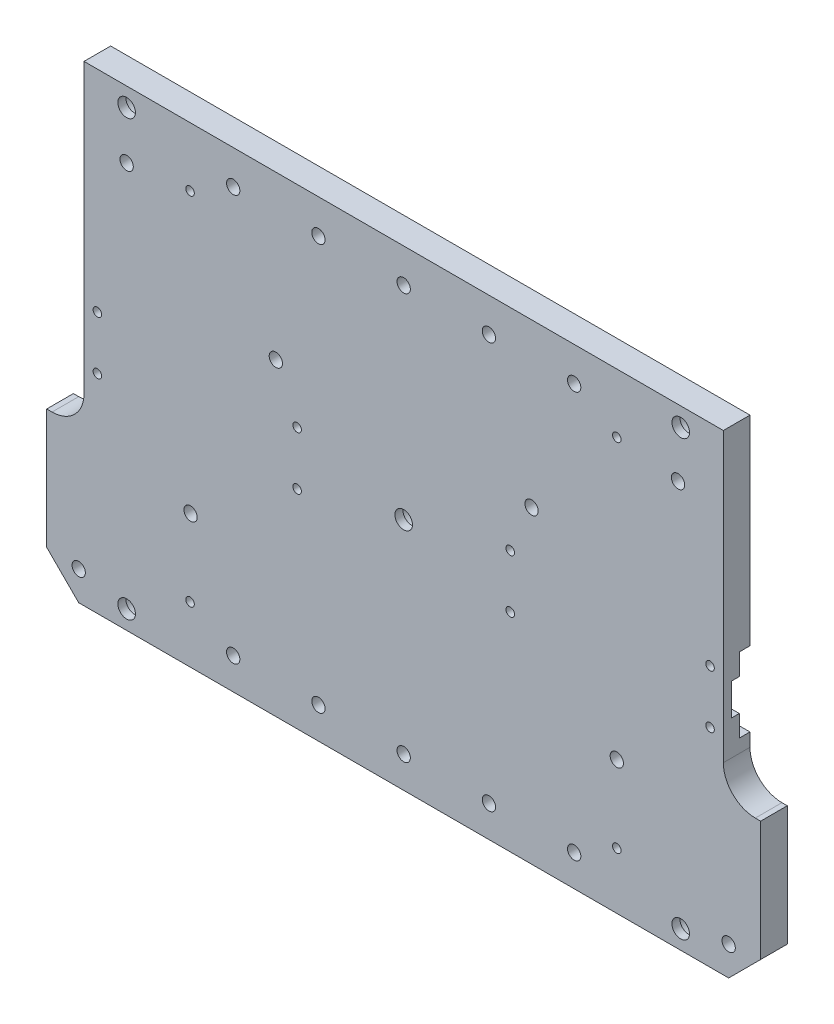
ISO-10303-21;
HEADER;
FILE_DESCRIPTION(('STEP AP214'),'2;1');
FILE_NAME('part.step','',(''),(''),'','','');
FILE_SCHEMA(('AUTOMOTIVE_DESIGN { 1 0 10303 214 1 1 1 1 }'));
ENDSEC;
DATA;
#1=APPLICATION_CONTEXT('core data for automotive mechanical design processes');
#2=APPLICATION_PROTOCOL_DEFINITION('international standard','automotive_design',2000,#1);
#3=PRODUCT_CONTEXT('',#1,'mechanical');
#4=PRODUCT('Part','Part','',(#3));
#5=PRODUCT_RELATED_PRODUCT_CATEGORY('part','',(#4));
#6=PRODUCT_DEFINITION_FORMATION('','',#4);
#7=PRODUCT_DEFINITION_CONTEXT('part definition',#1,'design');
#8=PRODUCT_DEFINITION('design','',#6,#7);
#9=PRODUCT_DEFINITION_SHAPE('','',#8);
#10=(LENGTH_UNIT() NAMED_UNIT(*) SI_UNIT(.MILLI.,.METRE.));
#11=(NAMED_UNIT(*) PLANE_ANGLE_UNIT() SI_UNIT($,.RADIAN.));
#12=(NAMED_UNIT(*) SI_UNIT($,.STERADIAN.) SOLID_ANGLE_UNIT());
#13=UNCERTAINTY_MEASURE_WITH_UNIT(LENGTH_MEASURE(1.E-05),#10,'distance_accuracy_value','');
#14=(GEOMETRIC_REPRESENTATION_CONTEXT(3) GLOBAL_UNCERTAINTY_ASSIGNED_CONTEXT((#13)) GLOBAL_UNIT_ASSIGNED_CONTEXT((#10,
#11,#12)) REPRESENTATION_CONTEXT('',''));
#15=CARTESIAN_POINT('',(0.,0.,0.));
#16=DIRECTION('',(0.,0.,1.));
#17=DIRECTION('',(1.,0.,0.));
#18=AXIS2_PLACEMENT_3D('',#15,#16,#17);
#19=CARTESIAN_POINT('',(67.,44.,5.));
#20=DIRECTION('',(0.,0.,1.));
#21=DIRECTION('',(1.,0.,0.));
#22=AXIS2_PLACEMENT_3D('',#19,#20,#21);
#23=CYLINDRICAL_SURFACE('',#22,1.64999999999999);
#24=CARTESIAN_POINT('',(67.,44.,5.));
#25=DIRECTION('',(0.,0.,1.));
#26=DIRECTION('',(1.,0.,0.));
#27=AXIS2_PLACEMENT_3D('',#24,#25,#26);
#28=CIRCLE('',#27,1.64999999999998);
#29=CARTESIAN_POINT('',(68.65,44.,5.));
#30=VERTEX_POINT('',#29);
#31=EDGE_CURVE('E931',#30,#30,#28,.T.);
#32=ORIENTED_EDGE('',*,*,#31,.T.);
#33=EDGE_LOOP('',(#32));
#34=FACE_BOUND('',#33,.T.);
#35=CARTESIAN_POINT('',(67.,44.,3.5));
#36=DIRECTION('',(0.,0.,-1.));
#37=DIRECTION('',(-1.,0.,0.));
#38=AXIS2_PLACEMENT_3D('',#35,#36,#37);
#39=CIRCLE('',#38,1.64999999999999);
#40=CARTESIAN_POINT('',(65.35,44.,3.5));
#41=VERTEX_POINT('',#40);
#42=EDGE_CURVE('E43',#41,#41,#39,.F.);
#43=ORIENTED_EDGE('',*,*,#42,.F.);
#44=EDGE_LOOP('',(#43));
#45=FACE_BOUND('',#44,.T.);
#46=ADVANCED_FACE('F39',(#34,#45),#23,.F.);
#47=CARTESIAN_POINT('',(15.,3.49999999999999,5.));
#48=DIRECTION('',(0.,0.,1.));
#49=DIRECTION('',(1.,0.,0.));
#50=AXIS2_PLACEMENT_3D('',#47,#48,#49);
#51=CYLINDRICAL_SURFACE('',#50,1.64999999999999);
#52=CARTESIAN_POINT('',(15.,3.49999999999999,5.));
#53=DIRECTION('',(0.,0.,1.));
#54=DIRECTION('',(1.,0.,0.));
#55=AXIS2_PLACEMENT_3D('',#52,#53,#54);
#56=CIRCLE('',#55,1.64999999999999);
#57=CARTESIAN_POINT('',(16.65,3.49999999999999,5.));
#58=VERTEX_POINT('',#57);
#59=EDGE_CURVE('E934',#58,#58,#56,.T.);
#60=ORIENTED_EDGE('',*,*,#59,.T.);
#61=EDGE_LOOP('',(#60));
#62=FACE_BOUND('',#61,.T.);
#63=CARTESIAN_POINT('',(15.,3.49999999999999,3.5));
#64=DIRECTION('',(0.,0.,-1.));
#65=DIRECTION('',(-1.,0.,0.));
#66=AXIS2_PLACEMENT_3D('',#63,#64,#65);
#67=CIRCLE('',#66,1.64999999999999);
#68=CARTESIAN_POINT('',(13.35,3.49999999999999,3.5));
#69=VERTEX_POINT('',#68);
#70=EDGE_CURVE('E1085',#69,#69,#67,.F.);
#71=ORIENTED_EDGE('',*,*,#70,.F.);
#72=EDGE_LOOP('',(#71));
#73=FACE_BOUND('',#72,.T.);
#74=ADVANCED_FACE('F1299',(#62,#73),#51,.F.);
#75=CARTESIAN_POINT('',(119.,3.5,5.));
#76=DIRECTION('',(0.,0.,1.));
#77=DIRECTION('',(1.,0.,0.));
#78=AXIS2_PLACEMENT_3D('',#75,#76,#77);
#79=CYLINDRICAL_SURFACE('',#78,1.64999999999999);
#80=CARTESIAN_POINT('',(119.,3.5,5.));
#81=DIRECTION('',(0.,0.,1.));
#82=DIRECTION('',(1.,0.,0.));
#83=AXIS2_PLACEMENT_3D('',#80,#81,#82);
#84=CIRCLE('',#83,1.64999999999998);
#85=CARTESIAN_POINT('',(120.65,3.5,5.));
#86=VERTEX_POINT('',#85);
#87=EDGE_CURVE('E937',#86,#86,#84,.T.);
#88=ORIENTED_EDGE('',*,*,#87,.T.);
#89=EDGE_LOOP('',(#88));
#90=FACE_BOUND('',#89,.T.);
#91=CARTESIAN_POINT('',(119.,3.5,3.5));
#92=DIRECTION('',(0.,0.,-1.));
#93=DIRECTION('',(-1.,0.,0.));
#94=AXIS2_PLACEMENT_3D('',#91,#92,#93);
#95=CIRCLE('',#94,1.64999999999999);
#96=CARTESIAN_POINT('',(117.35,3.5,3.5));
#97=VERTEX_POINT('',#96);
#98=EDGE_CURVE('E1081',#97,#97,#95,.F.);
#99=ORIENTED_EDGE('',*,*,#98,.F.);
#100=EDGE_LOOP('',(#99));
#101=FACE_BOUND('',#100,.T.);
#102=ADVANCED_FACE('F1305',(#90,#101),#79,.F.);
#103=CARTESIAN_POINT('',(119.,85.,5.));
#104=DIRECTION('',(0.,0.,1.));
#105=DIRECTION('',(1.,0.,0.));
#106=AXIS2_PLACEMENT_3D('',#103,#104,#105);
#107=CYLINDRICAL_SURFACE('',#106,1.64999999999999);
#108=CARTESIAN_POINT('',(119.,85.,5.));
#109=DIRECTION('',(0.,0.,1.));
#110=DIRECTION('',(1.,0.,0.));
#111=AXIS2_PLACEMENT_3D('',#108,#109,#110);
#112=CIRCLE('',#111,1.64999999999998);
#113=CARTESIAN_POINT('',(120.65,85.,5.));
#114=VERTEX_POINT('',#113);
#115=EDGE_CURVE('E928',#114,#114,#112,.T.);
#116=ORIENTED_EDGE('',*,*,#115,.T.);
#117=EDGE_LOOP('',(#116));
#118=FACE_BOUND('',#117,.T.);
#119=CARTESIAN_POINT('',(119.,85.,3.5));
#120=DIRECTION('',(0.,0.,-1.));
#121=DIRECTION('',(-1.,0.,0.));
#122=AXIS2_PLACEMENT_3D('',#119,#120,#121);
#123=CIRCLE('',#122,1.64999999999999);
#124=CARTESIAN_POINT('',(117.35,85.,3.5));
#125=VERTEX_POINT('',#124);
#126=EDGE_CURVE('E1076',#125,#125,#123,.F.);
#127=ORIENTED_EDGE('',*,*,#126,.F.);
#128=EDGE_LOOP('',(#127));
#129=FACE_BOUND('',#128,.T.);
#130=ADVANCED_FACE('F1310',(#118,#129),#107,.F.);
#131=CARTESIAN_POINT('',(15.,85.,5.));
#132=DIRECTION('',(0.,0.,1.));
#133=DIRECTION('',(1.,0.,0.));
#134=AXIS2_PLACEMENT_3D('',#131,#132,#133);
#135=CYLINDRICAL_SURFACE('',#134,1.64999999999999);
#136=CARTESIAN_POINT('',(15.,85.,5.));
#137=DIRECTION('',(0.,0.,1.));
#138=DIRECTION('',(1.,0.,0.));
#139=AXIS2_PLACEMENT_3D('',#136,#137,#138);
#140=CIRCLE('',#139,1.64999999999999);
#141=CARTESIAN_POINT('',(16.65,85.,5.));
#142=VERTEX_POINT('',#141);
#143=EDGE_CURVE('E925',#142,#142,#140,.T.);
#144=ORIENTED_EDGE('',*,*,#143,.T.);
#145=EDGE_LOOP('',(#144));
#146=FACE_BOUND('',#145,.T.);
#147=CARTESIAN_POINT('',(15.,85.,3.5));
#148=DIRECTION('',(0.,0.,-1.));
#149=DIRECTION('',(-1.,0.,0.));
#150=AXIS2_PLACEMENT_3D('',#147,#148,#149);
#151=CIRCLE('',#150,1.64999999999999);
#152=CARTESIAN_POINT('',(13.35,85.,3.5));
#153=VERTEX_POINT('',#152);
#154=EDGE_CURVE('E1071',#153,#153,#151,.F.);
#155=ORIENTED_EDGE('',*,*,#154,.F.);
#156=EDGE_LOOP('',(#155));
#157=FACE_BOUND('',#156,.T.);
#158=ADVANCED_FACE('F1513',(#146,#157),#135,.F.);
#159=CARTESIAN_POINT('',(122.,39.,2.));
#160=DIRECTION('',(0.,0.,1.));
#161=DIRECTION('',(-1.,0.,0.));
#162=AXIS2_PLACEMENT_3D('',#159,#160,#161);
#163=PLANE('',#162);
#164=DIRECTION('',(0.,1.,0.));
#165=VECTOR('',#164,1.);
#166=CARTESIAN_POINT('',(127.,37.,2.));
#167=LINE('',#166,#165);
#168=CARTESIAN_POINT('',(127.,37.,2.));
#169=VERTEX_POINT('',#168);
#170=CARTESIAN_POINT('',(127.,40.9999999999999,2.));
#171=VERTEX_POINT('',#170);
#172=EDGE_CURVE('E434',#169,#171,#167,.T.);
#173=ORIENTED_EDGE('',*,*,#172,.F.);
#174=DIRECTION('',(1.,0.,0.));
#175=VECTOR('',#174,1.);
#176=CARTESIAN_POINT('',(122.,37.,2.));
#177=LINE('',#176,#175);
#178=CARTESIAN_POINT('',(122.,37.,2.));
#179=VERTEX_POINT('',#178);
#180=EDGE_CURVE('E444',#179,#169,#177,.T.);
#181=ORIENTED_EDGE('',*,*,#180,.F.);
#182=CARTESIAN_POINT('',(122.,39.,2.));
#183=DIRECTION('',(0.,0.,1.));
#184=DIRECTION('',(-1.,0.,0.));
#185=AXIS2_PLACEMENT_3D('',#182,#183,#184);
#186=CIRCLE('',#185,2.);
#187=CARTESIAN_POINT('',(120.,39.,2.));
#188=VERTEX_POINT('',#187);
#189=EDGE_CURVE('E435',#188,#179,#186,.T.);
#190=ORIENTED_EDGE('',*,*,#189,.F.);
#191=DIRECTION('',(0.,-1.,0.));
#192=VECTOR('',#191,1.);
#193=CARTESIAN_POINT('',(120.,39.,2.));
#194=LINE('',#193,#192);
#195=CARTESIAN_POINT('',(120.,40.9999999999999,2.));
#196=VERTEX_POINT('',#195);
#197=EDGE_CURVE('E56',#196,#188,#194,.T.);
#198=ORIENTED_EDGE('',*,*,#197,.F.);
#199=DIRECTION('',(-1.,0.,0.));
#200=VECTOR('',#199,1.);
#201=CARTESIAN_POINT('',(136.,40.9999999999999,2.));
#202=LINE('',#201,#200);
#203=EDGE_CURVE('E48',#171,#196,#202,.T.);
#204=ORIENTED_EDGE('',*,*,#203,.F.);
#205=EDGE_LOOP('',(#173,#181,#190,#198,#204));
#206=FACE_BOUND('',#205,.T.);
#207=CARTESIAN_POINT('',(124.5,39.,2.));
#208=DIRECTION('',(0.,0.,-1.));
#209=DIRECTION('',(-1.,0.,0.));
#210=AXIS2_PLACEMENT_3D('',#207,#208,#209);
#211=CIRCLE('',#210,0.799999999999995);
#212=CARTESIAN_POINT('',(123.7,39.,2.));
#213=VERTEX_POINT('',#212);
#214=EDGE_CURVE('E1125',#213,#213,#211,.T.);
#215=ORIENTED_EDGE('',*,*,#214,.F.);
#216=EDGE_LOOP('',(#215));
#217=FACE_BOUND('',#216,.T.);
#218=ADVANCED_FACE('F447',(#206,#217),#163,.F.);
#219=CARTESIAN_POINT('',(84.4999999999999,37.,1.));
#220=DIRECTION('',(0.,0.,-1.));
#221=DIRECTION('',(1.,0.,0.));
#222=AXIS2_PLACEMENT_3D('',#219,#220,#221);
#223=PLANE('',#222);
#224=DIRECTION('',(0.,-1.,0.));
#225=VECTOR('',#224,1.);
#226=CARTESIAN_POINT('',(120.,37.,1.));
#227=LINE('',#226,#225);
#228=CARTESIAN_POINT('',(120.,40.9999999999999,1.));
#229=VERTEX_POINT('',#228);
#230=CARTESIAN_POINT('',(120.,39.,1.));
#231=VERTEX_POINT('',#230);
#232=EDGE_CURVE('E462',#229,#231,#227,.T.);
#233=ORIENTED_EDGE('',*,*,#232,.T.);
#234=CARTESIAN_POINT('',(122.,39.,1.));
#235=DIRECTION('',(0.,0.,-1.));
#236=DIRECTION('',(-1.,0.,0.));
#237=AXIS2_PLACEMENT_3D('',#234,#235,#236);
#238=CIRCLE('',#237,2.);
#239=CARTESIAN_POINT('',(122.,37.,1.));
#240=VERTEX_POINT('',#239);
#241=EDGE_CURVE('E442',#231,#240,#238,.F.);
#242=ORIENTED_EDGE('',*,*,#241,.T.);
#243=DIRECTION('',(1.,0.,0.));
#244=VECTOR('',#243,1.);
#245=CARTESIAN_POINT('',(84.4999999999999,37.,1.));
#246=LINE('',#245,#244);
#247=CARTESIAN_POINT('',(89.4999999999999,37.,1.));
#248=VERTEX_POINT('',#247);
#249=EDGE_CURVE('E554',#248,#240,#246,.T.);
#250=ORIENTED_EDGE('',*,*,#249,.F.);
#251=CARTESIAN_POINT('',(89.4999999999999,39.,1.));
#252=DIRECTION('',(0.,0.,-1.));
#253=DIRECTION('',(-1.,0.,0.));
#254=AXIS2_PLACEMENT_3D('',#251,#252,#253);
#255=CIRCLE('',#254,1.99999999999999);
#256=CARTESIAN_POINT('',(89.4999999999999,41.,1.));
#257=VERTEX_POINT('',#256);
#258=EDGE_CURVE('E506',#248,#257,#255,.F.);
#259=ORIENTED_EDGE('',*,*,#258,.T.);
#260=DIRECTION('',(-1.,0.,0.));
#261=VECTOR('',#260,1.);
#262=CARTESIAN_POINT('',(84.4999999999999,41.,1.));
#263=LINE('',#262,#261);
#264=CARTESIAN_POINT('',(84.4999999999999,41.,1.));
#265=VERTEX_POINT('',#264);
#266=EDGE_CURVE('E515',#257,#265,#263,.T.);
#267=ORIENTED_EDGE('',*,*,#266,.T.);
#268=DIRECTION('',(0.,-1.,0.));
#269=VECTOR('',#268,1.);
#270=CARTESIAN_POINT('',(84.4999999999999,51.,1.));
#271=LINE('',#270,#269);
#272=CARTESIAN_POINT('',(84.4999999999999,47.,1.));
#273=VERTEX_POINT('',#272);
#274=EDGE_CURVE('E548',#273,#265,#271,.T.);
#275=ORIENTED_EDGE('',*,*,#274,.F.);
#276=DIRECTION('',(1.,0.,0.));
#277=VECTOR('',#276,1.);
#278=CARTESIAN_POINT('',(84.4999999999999,47.,1.));
#279=LINE('',#278,#277);
#280=CARTESIAN_POINT('',(89.4999999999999,47.,1.));
#281=VERTEX_POINT('',#280);
#282=EDGE_CURVE('E544',#273,#281,#279,.T.);
#283=ORIENTED_EDGE('',*,*,#282,.T.);
#284=CARTESIAN_POINT('',(89.4999999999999,49.,1.));
#285=DIRECTION('',(0.,0.,-1.));
#286=DIRECTION('',(-1.,0.,0.));
#287=AXIS2_PLACEMENT_3D('',#284,#285,#286);
#288=CIRCLE('',#287,2.);
#289=CARTESIAN_POINT('',(89.4999999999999,51.,1.));
#290=VERTEX_POINT('',#289);
#291=EDGE_CURVE('E535',#281,#290,#288,.F.);
#292=ORIENTED_EDGE('',*,*,#291,.T.);
#293=DIRECTION('',(-1.,0.,0.));
#294=VECTOR('',#293,1.);
#295=CARTESIAN_POINT('',(84.4999999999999,51.,1.));
#296=LINE('',#295,#294);
#297=CARTESIAN_POINT('',(122.,51.,1.));
#298=VERTEX_POINT('',#297);
#299=EDGE_CURVE('E551',#298,#290,#296,.T.);
#300=ORIENTED_EDGE('',*,*,#299,.F.);
#301=CARTESIAN_POINT('',(122.,49.,1.));
#302=DIRECTION('',(0.,0.,-1.));
#303=DIRECTION('',(-1.,0.,0.));
#304=AXIS2_PLACEMENT_3D('',#301,#302,#303);
#305=CIRCLE('',#304,2.);
#306=CARTESIAN_POINT('',(120.,49.,1.));
#307=VERTEX_POINT('',#306);
#308=EDGE_CURVE('E479',#298,#307,#305,.F.);
#309=ORIENTED_EDGE('',*,*,#308,.T.);
#310=DIRECTION('',(0.,-1.,0.));
#311=VECTOR('',#310,1.);
#312=CARTESIAN_POINT('',(120.,37.,1.));
#313=LINE('',#312,#311);
#314=CARTESIAN_POINT('',(120.,46.9999999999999,1.));
#315=VERTEX_POINT('',#314);
#316=EDGE_CURVE('E486',#307,#315,#313,.T.);
#317=ORIENTED_EDGE('',*,*,#316,.T.);
#318=DIRECTION('',(-1.,0.,0.));
#319=VECTOR('',#318,1.);
#320=CARTESIAN_POINT('',(95.,46.9999999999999,1.));
#321=LINE('',#320,#319);
#322=CARTESIAN_POINT('',(95.,46.9999999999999,1.));
#323=VERTEX_POINT('',#322);
#324=EDGE_CURVE('E584',#315,#323,#321,.T.);
#325=ORIENTED_EDGE('',*,*,#324,.T.);
#326=CARTESIAN_POINT('',(95.,45.4999999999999,1.));
#327=DIRECTION('',(0.,0.,-1.));
#328=DIRECTION('',(-1.,0.,0.));
#329=AXIS2_PLACEMENT_3D('',#326,#327,#328);
#330=CIRCLE('',#329,1.5);
#331=CARTESIAN_POINT('',(93.5,45.5000000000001,1.));
#332=VERTEX_POINT('',#331);
#333=EDGE_CURVE('E579',#323,#332,#330,.F.);
#334=ORIENTED_EDGE('',*,*,#333,.T.);
#335=DIRECTION('',(-1.,0.,0.));
#336=VECTOR('',#335,1.);
#337=CARTESIAN_POINT('',(91.,45.5000000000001,1.));
#338=LINE('',#337,#336);
#339=CARTESIAN_POINT('',(91.,45.5000000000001,1.));
#340=VERTEX_POINT('',#339);
#341=EDGE_CURVE('E577',#332,#340,#338,.T.);
#342=ORIENTED_EDGE('',*,*,#341,.T.);
#343=CARTESIAN_POINT('',(91.,44.,1.));
#344=DIRECTION('',(0.,0.,-1.));
#345=DIRECTION('',(-1.,0.,0.));
#346=AXIS2_PLACEMENT_3D('',#343,#344,#345);
#347=CIRCLE('',#346,1.50000000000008);
#348=CARTESIAN_POINT('',(91.,42.4999999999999,1.));
#349=VERTEX_POINT('',#348);
#350=EDGE_CURVE('E575',#340,#349,#347,.F.);
#351=ORIENTED_EDGE('',*,*,#350,.T.);
#352=DIRECTION('',(1.,0.,0.));
#353=VECTOR('',#352,1.);
#354=CARTESIAN_POINT('',(93.5,42.4999999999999,1.));
#355=LINE('',#354,#353);
#356=CARTESIAN_POINT('',(93.5,42.4999999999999,1.));
#357=VERTEX_POINT('',#356);
#358=EDGE_CURVE('E573',#349,#357,#355,.T.);
#359=ORIENTED_EDGE('',*,*,#358,.T.);
#360=CARTESIAN_POINT('',(95.,42.4999999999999,1.));
#361=DIRECTION('',(0.,0.,-1.));
#362=DIRECTION('',(-1.,0.,0.));
#363=AXIS2_PLACEMENT_3D('',#360,#361,#362);
#364=CIRCLE('',#363,1.5);
#365=CARTESIAN_POINT('',(95.,40.9999999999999,1.));
#366=VERTEX_POINT('',#365);
#367=EDGE_CURVE('E565',#357,#366,#364,.F.);
#368=ORIENTED_EDGE('',*,*,#367,.T.);
#369=DIRECTION('',(1.,0.,0.));
#370=VECTOR('',#369,1.);
#371=CARTESIAN_POINT('',(136.,40.9999999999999,1.));
#372=LINE('',#371,#370);
#373=EDGE_CURVE('E581',#366,#229,#372,.T.);
#374=ORIENTED_EDGE('',*,*,#373,.T.);
#375=EDGE_LOOP('',(#233,#242,#250,#259,#267,#275,#283,#292,#300,#309,#317,#325,#334,#342,#351,
#359,#368,#374));
#376=FACE_BOUND('',#375,.T.);
#377=ADVANCED_FACE('F1423',(#376),#223,.T.);
#378=CARTESIAN_POINT('',(127.,88.5,5.));
#379=DIRECTION('',(-1.,0.,0.));
#380=DIRECTION('',(0.,-1.,0.));
#381=AXIS2_PLACEMENT_3D('',#378,#379,#380);
#382=PLANE('',#381);
#383=DIRECTION('',(0.,0.,-1.));
#384=VECTOR('',#383,1.);
#385=CARTESIAN_POINT('',(127.,37.,1.));
#386=LINE('',#385,#384);
#387=CARTESIAN_POINT('',(127.,37.,0.));
#388=VERTEX_POINT('',#387);
#389=EDGE_CURVE('E566',#169,#388,#386,.T.);
#390=ORIENTED_EDGE('',*,*,#389,.F.);
#391=ORIENTED_EDGE('',*,*,#172,.T.);
#392=DIRECTION('',(0.,0.,-1.));
#393=VECTOR('',#392,1.);
#394=CARTESIAN_POINT('',(127.,40.9999999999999,3.5));
#395=LINE('',#394,#393);
#396=CARTESIAN_POINT('',(127.,40.9999999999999,3.5));
#397=VERTEX_POINT('',#396);
#398=EDGE_CURVE('E1042',#397,#171,#395,.T.);
#399=ORIENTED_EDGE('',*,*,#398,.F.);
#400=DIRECTION('',(0.,1.,0.));
#401=VECTOR('',#400,1.);
#402=CARTESIAN_POINT('',(127.,42.4999999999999,3.5));
#403=LINE('',#402,#401);
#404=CARTESIAN_POINT('',(127.,46.9999999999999,3.5));
#405=VERTEX_POINT('',#404);
#406=EDGE_CURVE('E794',#397,#405,#403,.T.);
#407=ORIENTED_EDGE('',*,*,#406,.T.);
#408=DIRECTION('',(0.,0.,1.));
#409=VECTOR('',#408,1.);
#410=CARTESIAN_POINT('',(127.,46.9999999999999,3.5));
#411=LINE('',#410,#409);
#412=CARTESIAN_POINT('',(127.,46.9999999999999,2.));
#413=VERTEX_POINT('',#412);
#414=EDGE_CURVE('E797',#413,#405,#411,.T.);
#415=ORIENTED_EDGE('',*,*,#414,.F.);
#416=DIRECTION('',(0.,1.,0.));
#417=VECTOR('',#416,1.);
#418=CARTESIAN_POINT('',(127.,51.,2.));
#419=LINE('',#418,#417);
#420=CARTESIAN_POINT('',(127.,51.,2.));
#421=VERTEX_POINT('',#420);
#422=EDGE_CURVE('E469',#413,#421,#419,.T.);
#423=ORIENTED_EDGE('',*,*,#422,.T.);
#424=DIRECTION('',(0.,0.,-1.));
#425=VECTOR('',#424,1.);
#426=CARTESIAN_POINT('',(127.,51.,1.));
#427=LINE('',#426,#425);
#428=CARTESIAN_POINT('',(127.,51.,0.));
#429=VERTEX_POINT('',#428);
#430=EDGE_CURVE('E63',#421,#429,#427,.T.);
#431=ORIENTED_EDGE('',*,*,#430,.T.);
#432=DIRECTION('',(0.,1.,0.));
#433=VECTOR('',#432,1.);
#434=CARTESIAN_POINT('',(127.,88.5,0.));
#435=LINE('',#434,#433);
#436=CARTESIAN_POINT('',(127.,88.5,0.));
#437=VERTEX_POINT('',#436);
#438=EDGE_CURVE('E789',#429,#437,#435,.T.);
#439=ORIENTED_EDGE('',*,*,#438,.T.);
#440=DIRECTION('',(0.,0.,-1.));
#441=VECTOR('',#440,1.);
#442=CARTESIAN_POINT('',(127.,88.5,5.));
#443=LINE('',#442,#441);
#444=CARTESIAN_POINT('',(127.,88.5,5.));
#445=VERTEX_POINT('',#444);
#446=EDGE_CURVE('E786',#445,#437,#443,.T.);
#447=ORIENTED_EDGE('',*,*,#446,.F.);
#448=DIRECTION('',(0.,1.,0.));
#449=VECTOR('',#448,1.);
#450=CARTESIAN_POINT('',(127.,88.5,5.));
#451=LINE('',#450,#449);
#452=CARTESIAN_POINT('',(127.,34.5,5.));
#453=VERTEX_POINT('',#452);
#454=EDGE_CURVE('E783',#453,#445,#451,.T.);
#455=ORIENTED_EDGE('',*,*,#454,.F.);
#456=DIRECTION('',(0.,0.,-1.));
#457=VECTOR('',#456,1.);
#458=CARTESIAN_POINT('',(127.,34.5,0.));
#459=LINE('',#458,#457);
#460=CARTESIAN_POINT('',(127.,34.5,0.));
#461=VERTEX_POINT('',#460);
#462=EDGE_CURVE('E1045',#453,#461,#459,.T.);
#463=ORIENTED_EDGE('',*,*,#462,.T.);
#464=EDGE_CURVE('E784',#461,#388,#435,.T.);
#465=ORIENTED_EDGE('',*,*,#464,.T.);
#466=EDGE_LOOP('',(#390,#391,#399,#407,#415,#423,#431,#439,#447,#455,#463,#465));
#467=FACE_BOUND('',#466,.T.);
#468=ADVANCED_FACE('F1403',(#467),#382,.F.);
#469=CARTESIAN_POINT('',(136.,40.9999999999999,3.5));
#470=DIRECTION('',(0.,-1.,0.));
#471=DIRECTION('',(1.,0.,0.));
#472=AXIS2_PLACEMENT_3D('',#469,#470,#471);
#473=PLANE('',#472);
#474=DIRECTION('',(0.,0.,1.));
#475=VECTOR('',#474,1.);
#476=CARTESIAN_POINT('',(120.,40.9999999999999,3.5));
#477=LINE('',#476,#475);
#478=EDGE_CURVE('E12',#229,#196,#477,.T.);
#479=ORIENTED_EDGE('',*,*,#478,.F.);
#480=ORIENTED_EDGE('',*,*,#373,.F.);
#481=DIRECTION('',(0.,0.,-1.));
#482=VECTOR('',#481,1.);
#483=CARTESIAN_POINT('',(95.,40.9999999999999,3.5));
#484=LINE('',#483,#482);
#485=CARTESIAN_POINT('',(95.,40.9999999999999,3.5));
#486=VERTEX_POINT('',#485);
#487=EDGE_CURVE('E883',#486,#366,#484,.T.);
#488=ORIENTED_EDGE('',*,*,#487,.F.);
#489=DIRECTION('',(-1.,0.,0.));
#490=VECTOR('',#489,1.);
#491=CARTESIAN_POINT('',(136.,40.9999999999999,3.5));
#492=LINE('',#491,#490);
#493=EDGE_CURVE('E849',#397,#486,#492,.T.);
#494=ORIENTED_EDGE('',*,*,#493,.F.);
#495=ORIENTED_EDGE('',*,*,#398,.T.);
#496=ORIENTED_EDGE('',*,*,#203,.T.);
#497=EDGE_LOOP('',(#479,#480,#488,#494,#495,#496));
#498=FACE_BOUND('',#497,.T.);
#499=ADVANCED_FACE('F1476',(#498),#473,.F.);
#500=CARTESIAN_POINT('',(95.,46.9999999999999,3.5));
#501=DIRECTION('',(0.,1.,0.));
#502=DIRECTION('',(-1.,0.,0.));
#503=AXIS2_PLACEMENT_3D('',#500,#501,#502);
#504=PLANE('',#503);
#505=DIRECTION('',(0.,0.,-1.));
#506=VECTOR('',#505,1.);
#507=CARTESIAN_POINT('',(120.,46.9999999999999,3.5));
#508=LINE('',#507,#506);
#509=CARTESIAN_POINT('',(120.,46.9999999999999,2.));
#510=VERTEX_POINT('',#509);
#511=EDGE_CURVE('E1068',#510,#315,#508,.T.);
#512=ORIENTED_EDGE('',*,*,#511,.F.);
#513=DIRECTION('',(-1.,0.,0.));
#514=VECTOR('',#513,1.);
#515=CARTESIAN_POINT('',(95.,46.9999999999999,2.));
#516=LINE('',#515,#514);
#517=EDGE_CURVE('E484',#413,#510,#516,.T.);
#518=ORIENTED_EDGE('',*,*,#517,.F.);
#519=ORIENTED_EDGE('',*,*,#414,.T.);
#520=DIRECTION('',(1.,0.,0.));
#521=VECTOR('',#520,1.);
#522=CARTESIAN_POINT('',(95.,46.9999999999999,3.5));
#523=LINE('',#522,#521);
#524=CARTESIAN_POINT('',(95.,46.9999999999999,3.5));
#525=VERTEX_POINT('',#524);
#526=EDGE_CURVE('E880',#525,#405,#523,.T.);
#527=ORIENTED_EDGE('',*,*,#526,.F.);
#528=DIRECTION('',(0.,0.,-1.));
#529=VECTOR('',#528,1.);
#530=CARTESIAN_POINT('',(95.,46.9999999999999,3.5));
#531=LINE('',#530,#529);
#532=EDGE_CURVE('E884',#525,#323,#531,.T.);
#533=ORIENTED_EDGE('',*,*,#532,.T.);
#534=ORIENTED_EDGE('',*,*,#324,.F.);
#535=EDGE_LOOP('',(#512,#518,#519,#527,#533,#534));
#536=FACE_BOUND('',#535,.T.);
#537=ADVANCED_FACE('F1363',(#536),#504,.F.);
#538=CARTESIAN_POINT('',(0.,88.5,0.));
#539=DIRECTION('',(0.,0.,-1.));
#540=DIRECTION('',(-1.,0.,0.));
#541=AXIS2_PLACEMENT_3D('',#538,#539,#540);
#542=PLANE('',#541);
#543=CARTESIAN_POINT('',(67.,44.,0.));
#544=DIRECTION('',(0.,0.,-1.));
#545=DIRECTION('',(-1.,0.,0.));
#546=AXIS2_PLACEMENT_3D('',#543,#544,#545);
#547=CIRCLE('',#546,2.5);
#548=CARTESIAN_POINT('',(64.5,44.,0.));
#549=VERTEX_POINT('',#548);
#550=EDGE_CURVE('E1101',#549,#549,#547,.T.);
#551=ORIENTED_EDGE('',*,*,#550,.F.);
#552=EDGE_LOOP('',(#551));
#553=FACE_BOUND('',#552,.T.);
#554=CARTESIAN_POINT('',(15.,3.49999999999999,0.));
#555=DIRECTION('',(0.,0.,-1.));
#556=DIRECTION('',(-1.,0.,0.));
#557=AXIS2_PLACEMENT_3D('',#554,#555,#556);
#558=CIRCLE('',#557,2.5);
#559=CARTESIAN_POINT('',(12.5,3.49999999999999,0.));
#560=VERTEX_POINT('',#559);
#561=EDGE_CURVE('E1094',#560,#560,#558,.T.);
#562=ORIENTED_EDGE('',*,*,#561,.F.);
#563=EDGE_LOOP('',(#562));
#564=FACE_BOUND('',#563,.T.);
#565=CARTESIAN_POINT('',(119.,3.5,0.));
#566=DIRECTION('',(0.,0.,-1.));
#567=DIRECTION('',(-1.,0.,0.));
#568=AXIS2_PLACEMENT_3D('',#565,#566,#567);
#569=CIRCLE('',#568,2.5);
#570=CARTESIAN_POINT('',(116.5,3.5,0.));
#571=VERTEX_POINT('',#570);
#572=EDGE_CURVE('E1087',#571,#571,#569,.T.);
#573=ORIENTED_EDGE('',*,*,#572,.F.);
#574=EDGE_LOOP('',(#573));
#575=FACE_BOUND('',#574,.T.);
#576=CARTESIAN_POINT('',(119.,85.,0.));
#577=DIRECTION('',(0.,0.,-1.));
#578=DIRECTION('',(-1.,0.,0.));
#579=AXIS2_PLACEMENT_3D('',#576,#577,#578);
#580=CIRCLE('',#579,2.50000000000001);
#581=CARTESIAN_POINT('',(116.5,85.,0.));
#582=VERTEX_POINT('',#581);
#583=EDGE_CURVE('E1083',#582,#582,#580,.T.);
#584=ORIENTED_EDGE('',*,*,#583,.F.);
#585=EDGE_LOOP('',(#584));
#586=FACE_BOUND('',#585,.T.);
#587=CARTESIAN_POINT('',(15.,85.,0.));
#588=DIRECTION('',(0.,0.,-1.));
#589=DIRECTION('',(-1.,0.,0.));
#590=AXIS2_PLACEMENT_3D('',#587,#588,#589);
#591=CIRCLE('',#590,2.5);
#592=CARTESIAN_POINT('',(12.5,85.,0.));
#593=VERTEX_POINT('',#592);
#594=EDGE_CURVE('E1079',#593,#593,#591,.T.);
#595=ORIENTED_EDGE('',*,*,#594,.F.);
#596=EDGE_LOOP('',(#595));
#597=FACE_BOUND('',#596,.T.);
#598=CARTESIAN_POINT('',(99.,5.9,0.));
#599=DIRECTION('',(0.,0.,-1.));
#600=DIRECTION('',(-1.,0.,0.));
#601=AXIS2_PLACEMENT_3D('',#598,#599,#600);
#602=CIRCLE('',#601,1.24999999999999);
#603=CARTESIAN_POINT('',(97.75,5.9,0.));
#604=VERTEX_POINT('',#603);
#605=EDGE_CURVE('E993',#604,#604,#602,.T.);
#606=ORIENTED_EDGE('',*,*,#605,.F.);
#607=EDGE_LOOP('',(#606));
#608=FACE_BOUND('',#607,.T.);
#609=CARTESIAN_POINT('',(83.,5.9,0.));
#610=DIRECTION('',(0.,0.,-1.));
#611=DIRECTION('',(-1.,0.,0.));
#612=AXIS2_PLACEMENT_3D('',#609,#610,#611);
#613=CIRCLE('',#612,1.24999999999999);
#614=CARTESIAN_POINT('',(81.75,5.9,0.));
#615=VERTEX_POINT('',#614);
#616=EDGE_CURVE('E989',#615,#615,#613,.T.);
#617=ORIENTED_EDGE('',*,*,#616,.F.);
#618=EDGE_LOOP('',(#617));
#619=FACE_BOUND('',#618,.T.);
#620=CARTESIAN_POINT('',(67.,5.9,0.));
#621=DIRECTION('',(0.,0.,-1.));
#622=DIRECTION('',(-1.,0.,0.));
#623=AXIS2_PLACEMENT_3D('',#620,#621,#622);
#624=CIRCLE('',#623,1.24999999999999);
#625=CARTESIAN_POINT('',(65.75,5.9,0.));
#626=VERTEX_POINT('',#625);
#627=EDGE_CURVE('E983',#626,#626,#624,.T.);
#628=ORIENTED_EDGE('',*,*,#627,.F.);
#629=EDGE_LOOP('',(#628));
#630=FACE_BOUND('',#629,.T.);
#631=CARTESIAN_POINT('',(51.,5.89999999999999,0.));
#632=DIRECTION('',(0.,0.,-1.));
#633=DIRECTION('',(-1.,0.,0.));
#634=AXIS2_PLACEMENT_3D('',#631,#632,#633);
#635=CIRCLE('',#634,1.24999999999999);
#636=CARTESIAN_POINT('',(49.75,5.89999999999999,0.));
#637=VERTEX_POINT('',#636);
#638=EDGE_CURVE('E977',#637,#637,#635,.T.);
#639=ORIENTED_EDGE('',*,*,#638,.F.);
#640=EDGE_LOOP('',(#639));
#641=FACE_BOUND('',#640,.T.);
#642=CARTESIAN_POINT('',(35.,5.89999999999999,0.));
#643=DIRECTION('',(0.,0.,-1.));
#644=DIRECTION('',(-1.,0.,0.));
#645=AXIS2_PLACEMENT_3D('',#642,#643,#644);
#646=CIRCLE('',#645,1.24999999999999);
#647=CARTESIAN_POINT('',(33.75,5.89999999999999,0.));
#648=VERTEX_POINT('',#647);
#649=EDGE_CURVE('E971',#648,#648,#646,.T.);
#650=ORIENTED_EDGE('',*,*,#649,.F.);
#651=EDGE_LOOP('',(#650));
#652=FACE_BOUND('',#651,.T.);
#653=CARTESIAN_POINT('',(99.,82.1,0.));
#654=DIRECTION('',(0.,0.,-1.));
#655=DIRECTION('',(-1.,0.,0.));
#656=AXIS2_PLACEMENT_3D('',#653,#654,#655);
#657=CIRCLE('',#656,1.24999999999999);
#658=CARTESIAN_POINT('',(97.75,82.1,0.));
#659=VERTEX_POINT('',#658);
#660=EDGE_CURVE('E965',#659,#659,#657,.T.);
#661=ORIENTED_EDGE('',*,*,#660,.F.);
#662=EDGE_LOOP('',(#661));
#663=FACE_BOUND('',#662,.T.);
#664=CARTESIAN_POINT('',(83.,82.1,0.));
#665=DIRECTION('',(0.,0.,-1.));
#666=DIRECTION('',(-1.,0.,0.));
#667=AXIS2_PLACEMENT_3D('',#664,#665,#666);
#668=CIRCLE('',#667,1.24999999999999);
#669=CARTESIAN_POINT('',(81.75,82.1,0.));
#670=VERTEX_POINT('',#669);
#671=EDGE_CURVE('E959',#670,#670,#668,.T.);
#672=ORIENTED_EDGE('',*,*,#671,.F.);
#673=EDGE_LOOP('',(#672));
#674=FACE_BOUND('',#673,.T.);
#675=CARTESIAN_POINT('',(67.,82.1,0.));
#676=DIRECTION('',(0.,0.,-1.));
#677=DIRECTION('',(-1.,0.,0.));
#678=AXIS2_PLACEMENT_3D('',#675,#676,#677);
#679=CIRCLE('',#678,1.24999999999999);
#680=CARTESIAN_POINT('',(65.75,82.1,0.));
#681=VERTEX_POINT('',#680);
#682=EDGE_CURVE('E953',#681,#681,#679,.T.);
#683=ORIENTED_EDGE('',*,*,#682,.F.);
#684=EDGE_LOOP('',(#683));
#685=FACE_BOUND('',#684,.T.);
#686=CARTESIAN_POINT('',(51.,82.1,0.));
#687=DIRECTION('',(0.,0.,-1.));
#688=DIRECTION('',(-1.,0.,0.));
#689=AXIS2_PLACEMENT_3D('',#686,#687,#688);
#690=CIRCLE('',#689,1.24999999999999);
#691=CARTESIAN_POINT('',(49.75,82.1,0.));
#692=VERTEX_POINT('',#691);
#693=EDGE_CURVE('E949',#692,#692,#690,.T.);
#694=ORIENTED_EDGE('',*,*,#693,.F.);
#695=EDGE_LOOP('',(#694));
#696=FACE_BOUND('',#695,.T.);
#697=CARTESIAN_POINT('',(35.,82.1,0.));
#698=DIRECTION('',(0.,0.,-1.));
#699=DIRECTION('',(-1.,0.,0.));
#700=AXIS2_PLACEMENT_3D('',#697,#698,#699);
#701=CIRCLE('',#700,1.24999999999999);
#702=CARTESIAN_POINT('',(33.75,82.1,0.));
#703=VERTEX_POINT('',#702);
#704=EDGE_CURVE('E943',#703,#703,#701,.T.);
#705=ORIENTED_EDGE('',*,*,#704,.F.);
#706=EDGE_LOOP('',(#705));
#707=FACE_BOUND('',#706,.T.);
#708=CARTESIAN_POINT('',(107.,10.6,0.));
#709=DIRECTION('',(0.,0.,1.));
#710=DIRECTION('',(1.,0.,0.));
#711=AXIS2_PLACEMENT_3D('',#708,#709,#710);
#712=CIRCLE('',#711,0.799999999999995);
#713=CARTESIAN_POINT('',(107.8,10.6,0.));
#714=VERTEX_POINT('',#713);
#715=EDGE_CURVE('E922',#714,#714,#712,.T.);
#716=ORIENTED_EDGE('',*,*,#715,.T.);
#717=EDGE_LOOP('',(#716));
#718=FACE_BOUND('',#717,.T.);
#719=CARTESIAN_POINT('',(26.9,10.6,0.));
#720=DIRECTION('',(0.,0.,1.));
#721=DIRECTION('',(1.,0.,0.));
#722=AXIS2_PLACEMENT_3D('',#719,#720,#721);
#723=CIRCLE('',#722,0.799999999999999);
#724=CARTESIAN_POINT('',(27.7,10.6,0.));
#725=VERTEX_POINT('',#724);
#726=EDGE_CURVE('E916',#725,#725,#723,.T.);
#727=ORIENTED_EDGE('',*,*,#726,.T.);
#728=EDGE_LOOP('',(#727));
#729=FACE_BOUND('',#728,.T.);
#730=CARTESIAN_POINT('',(26.9,77.4,0.));
#731=DIRECTION('',(0.,0.,1.));
#732=DIRECTION('',(1.,0.,0.));
#733=AXIS2_PLACEMENT_3D('',#730,#731,#732);
#734=CIRCLE('',#733,0.799999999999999);
#735=CARTESIAN_POINT('',(27.7,77.4,0.));
#736=VERTEX_POINT('',#735);
#737=EDGE_CURVE('E910',#736,#736,#734,.T.);
#738=ORIENTED_EDGE('',*,*,#737,.T.);
#739=EDGE_LOOP('',(#738));
#740=FACE_BOUND('',#739,.T.);
#741=CARTESIAN_POINT('',(107.,77.4,0.));
#742=DIRECTION('',(0.,0.,1.));
#743=DIRECTION('',(1.,0.,0.));
#744=AXIS2_PLACEMENT_3D('',#741,#742,#743);
#745=CIRCLE('',#744,0.799999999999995);
#746=CARTESIAN_POINT('',(107.8,77.4,0.));
#747=VERTEX_POINT('',#746);
#748=EDGE_CURVE('E904',#747,#747,#745,.T.);
#749=ORIENTED_EDGE('',*,*,#748,.T.);
#750=EDGE_LOOP('',(#749));
#751=FACE_BOUND('',#750,.T.);
#752=CARTESIAN_POINT('',(15.,76.,0.));
#753=DIRECTION('',(0.,0.,-1.));
#754=DIRECTION('',(-1.,0.,0.));
#755=AXIS2_PLACEMENT_3D('',#752,#753,#754);
#756=CIRCLE('',#755,1.24999999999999);
#757=CARTESIAN_POINT('',(13.75,76.,0.));
#758=VERTEX_POINT('',#757);
#759=EDGE_CURVE('E773',#758,#758,#756,.T.);
#760=ORIENTED_EDGE('',*,*,#759,.F.);
#761=EDGE_LOOP('',(#760));
#762=FACE_BOUND('',#761,.T.);
#763=CARTESIAN_POINT('',(107.,25.,0.));
#764=DIRECTION('',(0.,0.,-1.));
#765=DIRECTION('',(-1.,0.,0.));
#766=AXIS2_PLACEMENT_3D('',#763,#764,#765);
#767=CIRCLE('',#766,1.24999999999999);
#768=CARTESIAN_POINT('',(105.75,25.,0.));
#769=VERTEX_POINT('',#768);
#770=EDGE_CURVE('E767',#769,#769,#767,.T.);
#771=ORIENTED_EDGE('',*,*,#770,.F.);
#772=EDGE_LOOP('',(#771));
#773=FACE_BOUND('',#772,.T.);
#774=CARTESIAN_POINT('',(128.,5.49999999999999,0.));
#775=DIRECTION('',(0.,0.,-1.));
#776=DIRECTION('',(-1.,0.,0.));
#777=AXIS2_PLACEMENT_3D('',#774,#775,#776);
#778=CIRCLE('',#777,1.24999999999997);
#779=CARTESIAN_POINT('',(126.75,5.49999999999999,0.));
#780=VERTEX_POINT('',#779);
#781=EDGE_CURVE('E761',#780,#780,#778,.T.);
#782=ORIENTED_EDGE('',*,*,#781,.F.);
#783=EDGE_LOOP('',(#782));
#784=FACE_BOUND('',#783,.T.);
#785=CARTESIAN_POINT('',(6.,5.49999999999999,0.));
#786=DIRECTION('',(0.,0.,-1.));
#787=DIRECTION('',(-1.,0.,0.));
#788=AXIS2_PLACEMENT_3D('',#785,#786,#787);
#789=CIRCLE('',#788,1.24999999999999);
#790=CARTESIAN_POINT('',(4.75000000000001,5.49999999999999,0.));
#791=VERTEX_POINT('',#790);
#792=EDGE_CURVE('E755',#791,#791,#789,.T.);
#793=ORIENTED_EDGE('',*,*,#792,.F.);
#794=EDGE_LOOP('',(#793));
#795=FACE_BOUND('',#794,.T.);
#796=CARTESIAN_POINT('',(27.,25.,0.));
#797=DIRECTION('',(0.,0.,-1.));
#798=DIRECTION('',(-1.,0.,0.));
#799=AXIS2_PLACEMENT_3D('',#796,#797,#798);
#800=CIRCLE('',#799,1.24999999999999);
#801=CARTESIAN_POINT('',(25.75,25.,0.));
#802=VERTEX_POINT('',#801);
#803=EDGE_CURVE('E749',#802,#802,#800,.T.);
#804=ORIENTED_EDGE('',*,*,#803,.F.);
#805=EDGE_LOOP('',(#804));
#806=FACE_BOUND('',#805,.T.);
#807=CARTESIAN_POINT('',(43.,58.,0.));
#808=DIRECTION('',(0.,0.,-1.));
#809=DIRECTION('',(-1.,0.,0.));
#810=AXIS2_PLACEMENT_3D('',#807,#808,#809);
#811=CIRCLE('',#810,1.24999999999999);
#812=CARTESIAN_POINT('',(41.75,58.,0.));
#813=VERTEX_POINT('',#812);
#814=EDGE_CURVE('E743',#813,#813,#811,.T.);
#815=ORIENTED_EDGE('',*,*,#814,.F.);
#816=EDGE_LOOP('',(#815));
#817=FACE_BOUND('',#816,.T.);
#818=CARTESIAN_POINT('',(91.,58.,0.));
#819=DIRECTION('',(0.,0.,-1.));
#820=DIRECTION('',(-1.,0.,0.));
#821=AXIS2_PLACEMENT_3D('',#818,#819,#820);
#822=CIRCLE('',#821,1.24999999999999);
#823=CARTESIAN_POINT('',(89.75,58.,0.));
#824=VERTEX_POINT('',#823);
#825=EDGE_CURVE('E737',#824,#824,#822,.T.);
#826=ORIENTED_EDGE('',*,*,#825,.F.);
#827=EDGE_LOOP('',(#826));
#828=FACE_BOUND('',#827,.T.);
#829=CARTESIAN_POINT('',(118.5,76.,0.));
#830=DIRECTION('',(0.,0.,-1.));
#831=DIRECTION('',(-1.,0.,0.));
#832=AXIS2_PLACEMENT_3D('',#829,#830,#831);
#833=CIRCLE('',#832,1.24999999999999);
#834=CARTESIAN_POINT('',(117.25,76.,0.));
#835=VERTEX_POINT('',#834);
#836=EDGE_CURVE('E731',#835,#835,#833,.T.);
#837=ORIENTED_EDGE('',*,*,#836,.F.);
#838=EDGE_LOOP('',(#837));
#839=FACE_BOUND('',#838,.T.);
#840=DIRECTION('',(0.,-1.,0.));
#841=VECTOR('',#840,1.);
#842=CARTESIAN_POINT('',(84.4999999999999,51.,0.));
#843=LINE('',#842,#841);
#844=CARTESIAN_POINT('',(84.4999999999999,47.,0.));
#845=VERTEX_POINT('',#844);
#846=CARTESIAN_POINT('',(84.4999999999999,41.,0.));
#847=VERTEX_POINT('',#846);
#848=EDGE_CURVE('E547',#845,#847,#843,.T.);
#849=ORIENTED_EDGE('',*,*,#848,.T.);
#850=CARTESIAN_POINT('',(84.4999999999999,39.,0.));
#851=DIRECTION('',(0.,0.,1.));
#852=DIRECTION('',(-1.,0.,0.));
#853=AXIS2_PLACEMENT_3D('',#850,#851,#852);
#854=CIRCLE('',#853,1.99999999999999);
#855=CARTESIAN_POINT('',(84.4999999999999,37.,0.));
#856=VERTEX_POINT('',#855);
#857=EDGE_CURVE('E489',#847,#856,#854,.T.);
#858=ORIENTED_EDGE('',*,*,#857,.T.);
#859=DIRECTION('',(1.,0.,0.));
#860=VECTOR('',#859,1.);
#861=CARTESIAN_POINT('',(84.4999999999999,37.,0.));
#862=LINE('',#861,#860);
#863=EDGE_CURVE('E552',#856,#388,#862,.T.);
#864=ORIENTED_EDGE('',*,*,#863,.T.);
#865=ORIENTED_EDGE('',*,*,#464,.F.);
#866=CARTESIAN_POINT('',(133.,34.5,0.));
#867=DIRECTION('',(0.,0.,-1.));
#868=DIRECTION('',(-1.,0.,0.));
#869=AXIS2_PLACEMENT_3D('',#866,#867,#868);
#870=CIRCLE('',#869,6.);
#871=CARTESIAN_POINT('',(133.,28.5,0.));
#872=VERTEX_POINT('',#871);
#873=EDGE_CURVE('E1055',#461,#872,#870,.F.);
#874=ORIENTED_EDGE('',*,*,#873,.T.);
#875=DIRECTION('',(-1.,0.,0.));
#876=VECTOR('',#875,1.);
#877=CARTESIAN_POINT('',(127.,28.5,0.));
#878=LINE('',#877,#876);
#879=CARTESIAN_POINT('',(134.,28.5,0.));
#880=VERTEX_POINT('',#879);
#881=EDGE_CURVE('E779',#880,#872,#878,.T.);
#882=ORIENTED_EDGE('',*,*,#881,.F.);
#883=DIRECTION('',(0.,1.,0.));
#884=VECTOR('',#883,1.);
#885=CARTESIAN_POINT('',(134.,0.,0.));
#886=LINE('',#885,#884);
#887=CARTESIAN_POINT('',(134.,6.00000000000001,0.));
#888=VERTEX_POINT('',#887);
#889=EDGE_CURVE('E1013',#888,#880,#886,.T.);
#890=ORIENTED_EDGE('',*,*,#889,.F.);
#891=DIRECTION('',(0.70710678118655,0.707106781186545,0.));
#892=VECTOR('',#891,1.);
#893=CARTESIAN_POINT('',(108.25,-19.7500000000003,0.));
#894=LINE('',#893,#892);
#895=CARTESIAN_POINT('',(128.,0.,0.));
#896=VERTEX_POINT('',#895);
#897=EDGE_CURVE('E1023',#888,#896,#894,.F.);
#898=ORIENTED_EDGE('',*,*,#897,.T.);
#899=DIRECTION('',(1.,0.,0.));
#900=VECTOR('',#899,1.);
#901=CARTESIAN_POINT('',(0.,0.,0.));
#902=LINE('',#901,#900);
#903=CARTESIAN_POINT('',(6.00000000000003,0.,0.));
#904=VERTEX_POINT('',#903);
#905=EDGE_CURVE('E1010',#904,#896,#902,.T.);
#906=ORIENTED_EDGE('',*,*,#905,.F.);
#907=DIRECTION('',(0.707106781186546,-0.707106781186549,0.));
#908=VECTOR('',#907,1.);
#909=CARTESIAN_POINT('',(-41.25,47.2500000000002,0.));
#910=LINE('',#909,#908);
#911=CARTESIAN_POINT('',(0.,6.00000000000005,0.));
#912=VERTEX_POINT('',#911);
#913=EDGE_CURVE('E1025',#904,#912,#910,.F.);
#914=ORIENTED_EDGE('',*,*,#913,.T.);
#915=DIRECTION('',(0.,-1.,0.));
#916=VECTOR('',#915,1.);
#917=CARTESIAN_POINT('',(0.,0.,0.));
#918=LINE('',#917,#916);
#919=CARTESIAN_POINT('',(0.,28.5,0.));
#920=VERTEX_POINT('',#919);
#921=EDGE_CURVE('E996',#920,#912,#918,.T.);
#922=ORIENTED_EDGE('',*,*,#921,.F.);
#923=DIRECTION('',(-1.,0.,0.));
#924=VECTOR('',#923,1.);
#925=CARTESIAN_POINT('',(6.99999999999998,28.5,0.));
#926=LINE('',#925,#924);
#927=CARTESIAN_POINT('',(0.999999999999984,28.5,0.));
#928=VERTEX_POINT('',#927);
#929=EDGE_CURVE('E807',#928,#920,#926,.T.);
#930=ORIENTED_EDGE('',*,*,#929,.F.);
#931=CARTESIAN_POINT('',(0.999999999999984,34.5,0.));
#932=DIRECTION('',(0.,0.,-1.));
#933=DIRECTION('',(-1.,0.,0.));
#934=AXIS2_PLACEMENT_3D('',#931,#932,#933);
#935=CIRCLE('',#934,6.);
#936=CARTESIAN_POINT('',(6.99999999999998,34.5,0.));
#937=VERTEX_POINT('',#936);
#938=EDGE_CURVE('E1059',#928,#937,#935,.F.);
#939=ORIENTED_EDGE('',*,*,#938,.T.);
#940=DIRECTION('',(0.,-1.,0.));
#941=VECTOR('',#940,1.);
#942=CARTESIAN_POINT('',(6.99999999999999,88.5,0.));
#943=LINE('',#942,#941);
#944=CARTESIAN_POINT('',(6.99999999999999,37.,0.));
#945=VERTEX_POINT('',#944);
#946=EDGE_CURVE('E802',#945,#937,#943,.T.);
#947=ORIENTED_EDGE('',*,*,#946,.F.);
#948=DIRECTION('',(-1.,0.,0.));
#949=VECTOR('',#948,1.);
#950=CARTESIAN_POINT('',(49.5000000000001,37.,0.));
#951=LINE('',#950,#949);
#952=CARTESIAN_POINT('',(49.5000000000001,37.,0.));
#953=VERTEX_POINT('',#952);
#954=EDGE_CURVE('E703',#953,#945,#951,.T.);
#955=ORIENTED_EDGE('',*,*,#954,.F.);
#956=CARTESIAN_POINT('',(49.5000000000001,39.,0.));
#957=DIRECTION('',(0.,0.,-1.));
#958=DIRECTION('',(1.,0.,0.));
#959=AXIS2_PLACEMENT_3D('',#956,#957,#958);
#960=CIRCLE('',#959,1.99999999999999);
#961=CARTESIAN_POINT('',(49.5000000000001,41.,0.));
#962=VERTEX_POINT('',#961);
#963=EDGE_CURVE('E634',#962,#953,#960,.T.);
#964=ORIENTED_EDGE('',*,*,#963,.F.);
#965=DIRECTION('',(0.,-1.,0.));
#966=VECTOR('',#965,1.);
#967=CARTESIAN_POINT('',(49.5000000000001,51.,0.));
#968=LINE('',#967,#966);
#969=CARTESIAN_POINT('',(49.5000000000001,47.,0.));
#970=VERTEX_POINT('',#969);
#971=EDGE_CURVE('E690',#970,#962,#968,.T.);
#972=ORIENTED_EDGE('',*,*,#971,.F.);
#973=CARTESIAN_POINT('',(49.5000000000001,49.,0.));
#974=DIRECTION('',(0.,0.,-1.));
#975=DIRECTION('',(-1.,0.,0.));
#976=AXIS2_PLACEMENT_3D('',#973,#974,#975);
#977=CIRCLE('',#976,1.99999999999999);
#978=CARTESIAN_POINT('',(49.5000000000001,51.,0.));
#979=VERTEX_POINT('',#978);
#980=EDGE_CURVE('E661',#979,#970,#977,.T.);
#981=ORIENTED_EDGE('',*,*,#980,.F.);
#982=DIRECTION('',(1.,0.,0.));
#983=VECTOR('',#982,1.);
#984=CARTESIAN_POINT('',(49.5000000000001,51.,0.));
#985=LINE('',#984,#983);
#986=CARTESIAN_POINT('',(6.99999999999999,51.,0.));
#987=VERTEX_POINT('',#986);
#988=EDGE_CURVE('E695',#987,#979,#985,.T.);
#989=ORIENTED_EDGE('',*,*,#988,.F.);
#990=CARTESIAN_POINT('',(6.99999999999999,88.5,0.));
#991=VERTEX_POINT('',#990);
#992=EDGE_CURVE('E810',#991,#987,#943,.T.);
#993=ORIENTED_EDGE('',*,*,#992,.F.);
#994=DIRECTION('',(-1.,0.,0.));
#995=VECTOR('',#994,1.);
#996=CARTESIAN_POINT('',(0.,88.5,0.));
#997=LINE('',#996,#995);
#998=EDGE_CURVE('E1000',#437,#991,#997,.T.);
#999=ORIENTED_EDGE('',*,*,#998,.F.);
#1000=ORIENTED_EDGE('',*,*,#438,.F.);
#1001=DIRECTION('',(-1.,0.,0.));
#1002=VECTOR('',#1001,1.);
#1003=CARTESIAN_POINT('',(84.4999999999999,51.,0.));
#1004=LINE('',#1003,#1002);
#1005=CARTESIAN_POINT('',(84.4999999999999,51.,0.));
#1006=VERTEX_POINT('',#1005);
#1007=EDGE_CURVE('E560',#429,#1006,#1004,.T.);
#1008=ORIENTED_EDGE('',*,*,#1007,.T.);
#1009=CARTESIAN_POINT('',(84.4999999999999,49.,0.));
#1010=DIRECTION('',(0.,0.,1.));
#1011=DIRECTION('',(1.,0.,0.));
#1012=AXIS2_PLACEMENT_3D('',#1009,#1010,#1011);
#1013=CIRCLE('',#1012,1.99999999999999);
#1014=EDGE_CURVE('E518',#1006,#845,#1013,.T.);
#1015=ORIENTED_EDGE('',*,*,#1014,.T.);
#1016=EDGE_LOOP('',(#849,#858,#864,#865,#874,#882,#890,#898,#906,#914,#922,#930,#939,#947,#955,
#964,#972,#981,#989,#993,#999,#1000,#1008,#1015));
#1017=FACE_BOUND('',#1016,.T.);
#1018=ADVANCED_FACE('F1204',(#553,#564,#575,#586,#597,#608,#619,#630,#641,#652,#663,#674,#685,
#696,#707,#718,#729,#740,#751,#762,#773,#784,#795,#806,#817,#828,#839,#1017),#542,.T.);
#1019=CARTESIAN_POINT('',(84.4999999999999,51.,1.));
#1020=DIRECTION('',(1.,0.,0.));
#1021=DIRECTION('',(0.,0.,-1.));
#1022=AXIS2_PLACEMENT_3D('',#1019,#1020,#1021);
#1023=PLANE('',#1022);
#1024=ORIENTED_EDGE('',*,*,#274,.T.);
#1025=DIRECTION('',(0.,0.,-1.));
#1026=VECTOR('',#1025,1.);
#1027=CARTESIAN_POINT('',(84.4999999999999,41.,2.));
#1028=LINE('',#1027,#1026);
#1029=EDGE_CURVE('E510',#265,#847,#1028,.T.);
#1030=ORIENTED_EDGE('',*,*,#1029,.T.);
#1031=ORIENTED_EDGE('',*,*,#848,.F.);
#1032=DIRECTION('',(0.,0.,-1.));
#1033=VECTOR('',#1032,1.);
#1034=CARTESIAN_POINT('',(84.4999999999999,47.,2.));
#1035=LINE('',#1034,#1033);
#1036=EDGE_CURVE('E536',#273,#845,#1035,.T.);
#1037=ORIENTED_EDGE('',*,*,#1036,.F.);
#1038=EDGE_LOOP('',(#1024,#1030,#1031,#1037));
#1039=FACE_BOUND('',#1038,.T.);
#1040=ADVANCED_FACE('F1362',(#1039),#1023,.T.);
#1041=CARTESIAN_POINT('',(95.,45.4999999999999,3.5));
#1042=DIRECTION('',(0.,0.,-1.));
#1043=DIRECTION('',(-1.,0.,0.));
#1044=AXIS2_PLACEMENT_3D('',#1041,#1042,#1043);
#1045=CYLINDRICAL_SURFACE('',#1044,1.5);
#1046=ORIENTED_EDGE('',*,*,#333,.F.);
#1047=ORIENTED_EDGE('',*,*,#532,.F.);
#1048=CARTESIAN_POINT('',(95.,45.4999999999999,3.5));
#1049=DIRECTION('',(0.,0.,-1.));
#1050=DIRECTION('',(-1.,0.,0.));
#1051=AXIS2_PLACEMENT_3D('',#1048,#1049,#1050);
#1052=CIRCLE('',#1051,1.5);
#1053=CARTESIAN_POINT('',(93.5,45.5000000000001,3.5));
#1054=VERTEX_POINT('',#1053);
#1055=EDGE_CURVE('E877',#1054,#525,#1052,.T.);
#1056=ORIENTED_EDGE('',*,*,#1055,.F.);
#1057=DIRECTION('',(0.,0.,-1.));
#1058=VECTOR('',#1057,1.);
#1059=CARTESIAN_POINT('',(93.5,45.5000000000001,3.5));
#1060=LINE('',#1059,#1058);
#1061=EDGE_CURVE('E888',#1054,#332,#1060,.T.);
#1062=ORIENTED_EDGE('',*,*,#1061,.T.);
#1063=EDGE_LOOP('',(#1046,#1047,#1056,#1062));
#1064=FACE_BOUND('',#1063,.T.);
#1065=ADVANCED_FACE('F1478',(#1064),#1045,.F.);
#1066=CARTESIAN_POINT('',(91.,45.5000000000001,3.5));
#1067=DIRECTION('',(0.,1.,0.));
#1068=DIRECTION('',(-1.,0.,0.));
#1069=AXIS2_PLACEMENT_3D('',#1066,#1067,#1068);
#1070=PLANE('',#1069);
#1071=ORIENTED_EDGE('',*,*,#341,.F.);
#1072=ORIENTED_EDGE('',*,*,#1061,.F.);
#1073=DIRECTION('',(1.,0.,0.));
#1074=VECTOR('',#1073,1.);
#1075=CARTESIAN_POINT('',(91.,45.5000000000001,3.5));
#1076=LINE('',#1075,#1074);
#1077=CARTESIAN_POINT('',(91.,45.5000000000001,3.5));
#1078=VERTEX_POINT('',#1077);
#1079=EDGE_CURVE('E874',#1078,#1054,#1076,.T.);
#1080=ORIENTED_EDGE('',*,*,#1079,.F.);
#1081=DIRECTION('',(0.,0.,-1.));
#1082=VECTOR('',#1081,1.);
#1083=CARTESIAN_POINT('',(91.,45.5000000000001,3.5));
#1084=LINE('',#1083,#1082);
#1085=EDGE_CURVE('E891',#1078,#340,#1084,.T.);
#1086=ORIENTED_EDGE('',*,*,#1085,.T.);
#1087=EDGE_LOOP('',(#1071,#1072,#1080,#1086));
#1088=FACE_BOUND('',#1087,.T.);
#1089=ADVANCED_FACE('F1481',(#1088),#1070,.F.);
#1090=CARTESIAN_POINT('',(91.,44.,3.5));
#1091=DIRECTION('',(0.,0.,-1.));
#1092=DIRECTION('',(-1.,0.,0.));
#1093=AXIS2_PLACEMENT_3D('',#1090,#1091,#1092);
#1094=CYLINDRICAL_SURFACE('',#1093,1.50000000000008);
#1095=ORIENTED_EDGE('',*,*,#350,.F.);
#1096=ORIENTED_EDGE('',*,*,#1085,.F.);
#1097=CARTESIAN_POINT('',(91.,44.,3.5));
#1098=DIRECTION('',(0.,0.,-1.));
#1099=DIRECTION('',(-1.,0.,0.));
#1100=AXIS2_PLACEMENT_3D('',#1097,#1098,#1099);
#1101=CIRCLE('',#1100,1.50000000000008);
#1102=CARTESIAN_POINT('',(91.,42.4999999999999,3.5));
#1103=VERTEX_POINT('',#1102);
#1104=EDGE_CURVE('E871',#1103,#1078,#1101,.T.);
#1105=ORIENTED_EDGE('',*,*,#1104,.F.);
#1106=DIRECTION('',(0.,0.,-1.));
#1107=VECTOR('',#1106,1.);
#1108=CARTESIAN_POINT('',(91.,42.4999999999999,3.5));
#1109=LINE('',#1108,#1107);
#1110=EDGE_CURVE('E894',#1103,#349,#1109,.T.);
#1111=ORIENTED_EDGE('',*,*,#1110,.T.);
#1112=EDGE_LOOP('',(#1095,#1096,#1105,#1111));
#1113=FACE_BOUND('',#1112,.T.);
#1114=ADVANCED_FACE('F1485',(#1113),#1094,.F.);
#1115=CARTESIAN_POINT('',(93.5,42.4999999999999,3.5));
#1116=DIRECTION('',(0.,-1.,0.));
#1117=DIRECTION('',(0.,0.,-1.));
#1118=AXIS2_PLACEMENT_3D('',#1115,#1116,#1117);
#1119=PLANE('',#1118);
#1120=ORIENTED_EDGE('',*,*,#358,.F.);
#1121=ORIENTED_EDGE('',*,*,#1110,.F.);
#1122=DIRECTION('',(-1.,0.,0.));
#1123=VECTOR('',#1122,1.);
#1124=CARTESIAN_POINT('',(93.5,42.4999999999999,3.5));
#1125=LINE('',#1124,#1123);
#1126=CARTESIAN_POINT('',(93.5,42.4999999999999,3.5));
#1127=VERTEX_POINT('',#1126);
#1128=EDGE_CURVE('E868',#1127,#1103,#1125,.T.);
#1129=ORIENTED_EDGE('',*,*,#1128,.F.);
#1130=DIRECTION('',(0.,0.,-1.));
#1131=VECTOR('',#1130,1.);
#1132=CARTESIAN_POINT('',(93.5,42.4999999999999,3.5));
#1133=LINE('',#1132,#1131);
#1134=EDGE_CURVE('E897',#1127,#357,#1133,.T.);
#1135=ORIENTED_EDGE('',*,*,#1134,.T.);
#1136=EDGE_LOOP('',(#1120,#1121,#1129,#1135));
#1137=FACE_BOUND('',#1136,.T.);
#1138=ADVANCED_FACE('F1489',(#1137),#1119,.F.);
#1139=CARTESIAN_POINT('',(95.,42.4999999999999,3.5));
#1140=DIRECTION('',(0.,0.,-1.));
#1141=DIRECTION('',(-1.,0.,0.));
#1142=AXIS2_PLACEMENT_3D('',#1139,#1140,#1141);
#1143=CYLINDRICAL_SURFACE('',#1142,1.5);
#1144=ORIENTED_EDGE('',*,*,#367,.F.);
#1145=ORIENTED_EDGE('',*,*,#1134,.F.);
#1146=CARTESIAN_POINT('',(95.,42.4999999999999,3.5));
#1147=DIRECTION('',(0.,0.,-1.));
#1148=DIRECTION('',(-1.,0.,0.));
#1149=AXIS2_PLACEMENT_3D('',#1146,#1147,#1148);
#1150=CIRCLE('',#1149,1.5);
#1151=EDGE_CURVE('E865',#486,#1127,#1150,.T.);
#1152=ORIENTED_EDGE('',*,*,#1151,.F.);
#1153=ORIENTED_EDGE('',*,*,#487,.T.);
#1154=EDGE_LOOP('',(#1144,#1145,#1152,#1153));
#1155=FACE_BOUND('',#1154,.T.);
#1156=ADVANCED_FACE('F1458',(#1155),#1143,.F.);
#1157=CARTESIAN_POINT('',(39.,46.9999999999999,3.5));
#1158=DIRECTION('',(0.,1.,0.));
#1159=DIRECTION('',(-1.,0.,0.));
#1160=AXIS2_PLACEMENT_3D('',#1157,#1158,#1159);
#1161=PLANE('',#1160);
#1162=DIRECTION('',(-1.,0.,0.));
#1163=VECTOR('',#1162,1.);
#1164=CARTESIAN_POINT('',(39.,46.9999999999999,2.));
#1165=LINE('',#1164,#1163);
#1166=CARTESIAN_POINT('',(14.,46.9999999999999,2.));
#1167=VERTEX_POINT('',#1166);
#1168=CARTESIAN_POINT('',(6.99999999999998,46.9999999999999,2.));
#1169=VERTEX_POINT('',#1168);
#1170=EDGE_CURVE('E632',#1167,#1169,#1165,.T.);
#1171=ORIENTED_EDGE('',*,*,#1170,.F.);
#1172=DIRECTION('',(0.,0.,-1.));
#1173=VECTOR('',#1172,1.);
#1174=CARTESIAN_POINT('',(14.,46.9999999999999,3.5));
#1175=LINE('',#1174,#1173);
#1176=CARTESIAN_POINT('',(14.,46.9999999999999,1.));
#1177=VERTEX_POINT('',#1176);
#1178=EDGE_CURVE('E629',#1167,#1177,#1175,.T.);
#1179=ORIENTED_EDGE('',*,*,#1178,.T.);
#1180=DIRECTION('',(-1.,0.,0.));
#1181=VECTOR('',#1180,1.);
#1182=CARTESIAN_POINT('',(39.,46.9999999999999,1.));
#1183=LINE('',#1182,#1181);
#1184=CARTESIAN_POINT('',(39.,46.9999999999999,1.));
#1185=VERTEX_POINT('',#1184);
#1186=EDGE_CURVE('E728',#1185,#1177,#1183,.T.);
#1187=ORIENTED_EDGE('',*,*,#1186,.F.);
#1188=DIRECTION('',(0.,0.,-1.));
#1189=VECTOR('',#1188,1.);
#1190=CARTESIAN_POINT('',(39.,46.9999999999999,3.5));
#1191=LINE('',#1190,#1189);
#1192=CARTESIAN_POINT('',(39.,46.9999999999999,3.5));
#1193=VERTEX_POINT('',#1192);
#1194=EDGE_CURVE('E846',#1193,#1185,#1191,.T.);
#1195=ORIENTED_EDGE('',*,*,#1194,.F.);
#1196=DIRECTION('',(1.,0.,0.));
#1197=VECTOR('',#1196,1.);
#1198=CARTESIAN_POINT('',(39.,46.9999999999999,3.5));
#1199=LINE('',#1198,#1197);
#1200=CARTESIAN_POINT('',(6.99999999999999,46.9999999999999,3.5));
#1201=VERTEX_POINT('',#1200);
#1202=EDGE_CURVE('E843',#1201,#1193,#1199,.T.);
#1203=ORIENTED_EDGE('',*,*,#1202,.F.);
#1204=DIRECTION('',(0.,0.,-1.));
#1205=VECTOR('',#1204,1.);
#1206=CARTESIAN_POINT('',(6.99999999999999,46.9999999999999,3.5));
#1207=LINE('',#1206,#1205);
#1208=EDGE_CURVE('E819',#1201,#1169,#1207,.T.);
#1209=ORIENTED_EDGE('',*,*,#1208,.T.);
#1210=EDGE_LOOP('',(#1171,#1179,#1187,#1195,#1203,#1209));
#1211=FACE_BOUND('',#1210,.T.);
#1212=ADVANCED_FACE('F1175',(#1211),#1161,.F.);
#1213=CARTESIAN_POINT('',(-2.,40.9999999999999,3.5));
#1214=DIRECTION('',(0.,-1.,0.));
#1215=DIRECTION('',(1.,0.,0.));
#1216=AXIS2_PLACEMENT_3D('',#1213,#1214,#1215);
#1217=PLANE('',#1216);
#1218=DIRECTION('',(1.,0.,0.));
#1219=VECTOR('',#1218,1.);
#1220=CARTESIAN_POINT('',(-2.,40.9999999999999,1.));
#1221=LINE('',#1220,#1219);
#1222=CARTESIAN_POINT('',(14.,40.9999999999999,1.));
#1223=VERTEX_POINT('',#1222);
#1224=CARTESIAN_POINT('',(39.,40.9999999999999,1.));
#1225=VERTEX_POINT('',#1224);
#1226=EDGE_CURVE('E726',#1223,#1225,#1221,.T.);
#1227=ORIENTED_EDGE('',*,*,#1226,.F.);
#1228=DIRECTION('',(0.,0.,1.));
#1229=VECTOR('',#1228,1.);
#1230=CARTESIAN_POINT('',(14.,40.9999999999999,3.5));
#1231=LINE('',#1230,#1229);
#1232=CARTESIAN_POINT('',(14.,40.9999999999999,2.));
#1233=VERTEX_POINT('',#1232);
#1234=EDGE_CURVE('E604',#1223,#1233,#1231,.T.);
#1235=ORIENTED_EDGE('',*,*,#1234,.T.);
#1236=DIRECTION('',(-1.,0.,0.));
#1237=VECTOR('',#1236,1.);
#1238=CARTESIAN_POINT('',(-2.,40.9999999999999,2.));
#1239=LINE('',#1238,#1237);
#1240=CARTESIAN_POINT('',(6.99999999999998,40.9999999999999,2.));
#1241=VERTEX_POINT('',#1240);
#1242=EDGE_CURVE('E607',#1233,#1241,#1239,.T.);
#1243=ORIENTED_EDGE('',*,*,#1242,.T.);
#1244=DIRECTION('',(0.,0.,1.));
#1245=VECTOR('',#1244,1.);
#1246=CARTESIAN_POINT('',(6.99999999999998,40.9999999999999,3.5));
#1247=LINE('',#1246,#1245);
#1248=CARTESIAN_POINT('',(6.99999999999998,40.9999999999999,3.5));
#1249=VERTEX_POINT('',#1248);
#1250=EDGE_CURVE('E1040',#1241,#1249,#1247,.T.);
#1251=ORIENTED_EDGE('',*,*,#1250,.T.);
#1252=DIRECTION('',(-1.,0.,0.));
#1253=VECTOR('',#1252,1.);
#1254=CARTESIAN_POINT('',(-2.,40.9999999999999,3.5));
#1255=LINE('',#1254,#1253);
#1256=CARTESIAN_POINT('',(39.,40.9999999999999,3.5));
#1257=VERTEX_POINT('',#1256);
#1258=EDGE_CURVE('E840',#1257,#1249,#1255,.T.);
#1259=ORIENTED_EDGE('',*,*,#1258,.F.);
#1260=DIRECTION('',(0.,0.,-1.));
#1261=VECTOR('',#1260,1.);
#1262=CARTESIAN_POINT('',(39.,40.9999999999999,3.5));
#1263=LINE('',#1262,#1261);
#1264=EDGE_CURVE('E850',#1257,#1225,#1263,.T.);
#1265=ORIENTED_EDGE('',*,*,#1264,.T.);
#1266=EDGE_LOOP('',(#1227,#1235,#1243,#1251,#1259,#1265));
#1267=FACE_BOUND('',#1266,.T.);
#1268=ADVANCED_FACE('F1185',(#1267),#1217,.F.);
#1269=CARTESIAN_POINT('',(39.,45.4999999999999,3.5));
#1270=DIRECTION('',(0.,0.,-1.));
#1271=DIRECTION('',(-1.,0.,0.));
#1272=AXIS2_PLACEMENT_3D('',#1269,#1270,#1271);
#1273=CYLINDRICAL_SURFACE('',#1272,1.5);
#1274=CARTESIAN_POINT('',(39.,45.4999999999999,1.));
#1275=DIRECTION('',(0.,0.,-1.));
#1276=DIRECTION('',(-1.,0.,0.));
#1277=AXIS2_PLACEMENT_3D('',#1274,#1275,#1276);
#1278=CIRCLE('',#1277,1.5);
#1279=CARTESIAN_POINT('',(40.5,45.5000000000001,1.));
#1280=VERTEX_POINT('',#1279);
#1281=EDGE_CURVE('E724',#1280,#1185,#1278,.F.);
#1282=ORIENTED_EDGE('',*,*,#1281,.F.);
#1283=DIRECTION('',(0.,0.,-1.));
#1284=VECTOR('',#1283,1.);
#1285=CARTESIAN_POINT('',(40.5,45.5000000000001,3.5));
#1286=LINE('',#1285,#1284);
#1287=CARTESIAN_POINT('',(40.5,45.5000000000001,3.5));
#1288=VERTEX_POINT('',#1287);
#1289=EDGE_CURVE('E845',#1288,#1280,#1286,.T.);
#1290=ORIENTED_EDGE('',*,*,#1289,.F.);
#1291=CARTESIAN_POINT('',(39.,45.4999999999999,3.5));
#1292=DIRECTION('',(0.,0.,-1.));
#1293=DIRECTION('',(1.,0.,0.));
#1294=AXIS2_PLACEMENT_3D('',#1291,#1292,#1293);
#1295=CIRCLE('',#1294,1.5);
#1296=EDGE_CURVE('E825',#1193,#1288,#1295,.T.);
#1297=ORIENTED_EDGE('',*,*,#1296,.F.);
#1298=ORIENTED_EDGE('',*,*,#1194,.T.);
#1299=EDGE_LOOP('',(#1282,#1290,#1297,#1298));
#1300=FACE_BOUND('',#1299,.T.);
#1301=ADVANCED_FACE('F1256',(#1300),#1273,.F.);
#1302=CARTESIAN_POINT('',(39.,42.4999999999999,3.5));
#1303=DIRECTION('',(0.,0.,-1.));
#1304=DIRECTION('',(-1.,0.,0.));
#1305=AXIS2_PLACEMENT_3D('',#1302,#1303,#1304);
#1306=CYLINDRICAL_SURFACE('',#1305,1.5);
#1307=CARTESIAN_POINT('',(39.,42.4999999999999,1.));
#1308=DIRECTION('',(0.,0.,-1.));
#1309=DIRECTION('',(-1.,0.,0.));
#1310=AXIS2_PLACEMENT_3D('',#1307,#1308,#1309);
#1311=CIRCLE('',#1310,1.5);
#1312=CARTESIAN_POINT('',(40.5,42.4999999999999,1.));
#1313=VERTEX_POINT('',#1312);
#1314=EDGE_CURVE('E722',#1225,#1313,#1311,.F.);
#1315=ORIENTED_EDGE('',*,*,#1314,.F.);
#1316=ORIENTED_EDGE('',*,*,#1264,.F.);
#1317=CARTESIAN_POINT('',(39.,42.4999999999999,3.5));
#1318=DIRECTION('',(0.,0.,-1.));
#1319=DIRECTION('',(1.,0.,0.));
#1320=AXIS2_PLACEMENT_3D('',#1317,#1318,#1319);
#1321=CIRCLE('',#1320,1.5);
#1322=CARTESIAN_POINT('',(40.5,42.4999999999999,3.5));
#1323=VERTEX_POINT('',#1322);
#1324=EDGE_CURVE('E837',#1323,#1257,#1321,.T.);
#1325=ORIENTED_EDGE('',*,*,#1324,.F.);
#1326=DIRECTION('',(0.,0.,-1.));
#1327=VECTOR('',#1326,1.);
#1328=CARTESIAN_POINT('',(40.5,42.4999999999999,3.5));
#1329=LINE('',#1328,#1327);
#1330=EDGE_CURVE('E853',#1323,#1313,#1329,.T.);
#1331=ORIENTED_EDGE('',*,*,#1330,.T.);
#1332=EDGE_LOOP('',(#1315,#1316,#1325,#1331));
#1333=FACE_BOUND('',#1332,.T.);
#1334=ADVANCED_FACE('F1271',(#1333),#1306,.F.);
#1335=CARTESIAN_POINT('',(40.5,42.4999999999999,3.5));
#1336=DIRECTION('',(0.,-1.,0.));
#1337=DIRECTION('',(0.,0.,-1.));
#1338=AXIS2_PLACEMENT_3D('',#1335,#1336,#1337);
#1339=PLANE('',#1338);
#1340=DIRECTION('',(1.,0.,0.));
#1341=VECTOR('',#1340,1.);
#1342=CARTESIAN_POINT('',(40.5,42.4999999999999,1.));
#1343=LINE('',#1342,#1341);
#1344=CARTESIAN_POINT('',(43.,42.4999999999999,1.));
#1345=VERTEX_POINT('',#1344);
#1346=EDGE_CURVE('E720',#1313,#1345,#1343,.T.);
#1347=ORIENTED_EDGE('',*,*,#1346,.F.);
#1348=ORIENTED_EDGE('',*,*,#1330,.F.);
#1349=DIRECTION('',(-1.,0.,0.));
#1350=VECTOR('',#1349,1.);
#1351=CARTESIAN_POINT('',(40.5,42.4999999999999,3.5));
#1352=LINE('',#1351,#1350);
#1353=CARTESIAN_POINT('',(43.,42.4999999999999,3.5));
#1354=VERTEX_POINT('',#1353);
#1355=EDGE_CURVE('E834',#1354,#1323,#1352,.T.);
#1356=ORIENTED_EDGE('',*,*,#1355,.F.);
#1357=DIRECTION('',(0.,0.,-1.));
#1358=VECTOR('',#1357,1.);
#1359=CARTESIAN_POINT('',(43.,42.4999999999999,3.5));
#1360=LINE('',#1359,#1358);
#1361=EDGE_CURVE('E856',#1354,#1345,#1360,.T.);
#1362=ORIENTED_EDGE('',*,*,#1361,.T.);
#1363=EDGE_LOOP('',(#1347,#1348,#1356,#1362));
#1364=FACE_BOUND('',#1363,.T.);
#1365=ADVANCED_FACE('F1267',(#1364),#1339,.F.);
#1366=CARTESIAN_POINT('',(43.,44.,3.5));
#1367=DIRECTION('',(0.,0.,-1.));
#1368=DIRECTION('',(-1.,0.,0.));
#1369=AXIS2_PLACEMENT_3D('',#1366,#1367,#1368);
#1370=CYLINDRICAL_SURFACE('',#1369,1.50000000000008);
#1371=CARTESIAN_POINT('',(43.,44.,1.));
#1372=DIRECTION('',(0.,0.,-1.));
#1373=DIRECTION('',(-1.,0.,0.));
#1374=AXIS2_PLACEMENT_3D('',#1371,#1372,#1373);
#1375=CIRCLE('',#1374,1.50000000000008);
#1376=CARTESIAN_POINT('',(43.,45.5000000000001,1.));
#1377=VERTEX_POINT('',#1376);
#1378=EDGE_CURVE('E718',#1345,#1377,#1375,.F.);
#1379=ORIENTED_EDGE('',*,*,#1378,.F.);
#1380=ORIENTED_EDGE('',*,*,#1361,.F.);
#1381=CARTESIAN_POINT('',(43.,44.,3.5));
#1382=DIRECTION('',(0.,0.,-1.));
#1383=DIRECTION('',(1.,0.,0.));
#1384=AXIS2_PLACEMENT_3D('',#1381,#1382,#1383);
#1385=CIRCLE('',#1384,1.50000000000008);
#1386=CARTESIAN_POINT('',(43.,45.5000000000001,3.5));
#1387=VERTEX_POINT('',#1386);
#1388=EDGE_CURVE('E831',#1387,#1354,#1385,.T.);
#1389=ORIENTED_EDGE('',*,*,#1388,.F.);
#1390=DIRECTION('',(0.,0.,-1.));
#1391=VECTOR('',#1390,1.);
#1392=CARTESIAN_POINT('',(43.,45.5000000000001,3.5));
#1393=LINE('',#1392,#1391);
#1394=EDGE_CURVE('E859',#1387,#1377,#1393,.T.);
#1395=ORIENTED_EDGE('',*,*,#1394,.T.);
#1396=EDGE_LOOP('',(#1379,#1380,#1389,#1395));
#1397=FACE_BOUND('',#1396,.T.);
#1398=ADVANCED_FACE('F1264',(#1397),#1370,.F.);
#1399=CARTESIAN_POINT('',(43.,45.5000000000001,3.5));
#1400=DIRECTION('',(0.,1.,0.));
#1401=DIRECTION('',(-1.,0.,0.));
#1402=AXIS2_PLACEMENT_3D('',#1399,#1400,#1401);
#1403=PLANE('',#1402);
#1404=DIRECTION('',(-1.,0.,0.));
#1405=VECTOR('',#1404,1.);
#1406=CARTESIAN_POINT('',(43.,45.5000000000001,1.));
#1407=LINE('',#1406,#1405);
#1408=EDGE_CURVE('E709',#1377,#1280,#1407,.T.);
#1409=ORIENTED_EDGE('',*,*,#1408,.F.);
#1410=ORIENTED_EDGE('',*,*,#1394,.F.);
#1411=DIRECTION('',(1.,0.,0.));
#1412=VECTOR('',#1411,1.);
#1413=CARTESIAN_POINT('',(43.,45.5000000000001,3.5));
#1414=LINE('',#1413,#1412);
#1415=EDGE_CURVE('E828',#1288,#1387,#1414,.T.);
#1416=ORIENTED_EDGE('',*,*,#1415,.F.);
#1417=ORIENTED_EDGE('',*,*,#1289,.T.);
#1418=EDGE_LOOP('',(#1409,#1410,#1416,#1417));
#1419=FACE_BOUND('',#1418,.T.);
#1420=ADVANCED_FACE('F1259',(#1419),#1403,.F.);
#1421=CARTESIAN_POINT('',(0.,0.,5.));
#1422=DIRECTION('',(1.,0.,0.));
#1423=DIRECTION('',(0.,0.,-1.));
#1424=AXIS2_PLACEMENT_3D('',#1421,#1422,#1423);
#1425=PLANE('',#1424);
#1426=DIRECTION('',(0.,-1.,0.));
#1427=VECTOR('',#1426,1.);
#1428=CARTESIAN_POINT('',(0.,0.,5.));
#1429=LINE('',#1428,#1427);
#1430=CARTESIAN_POINT('',(0.,28.5,5.));
#1431=VERTEX_POINT('',#1430);
#1432=CARTESIAN_POINT('',(0.,6.00000000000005,5.));
#1433=VERTEX_POINT('',#1432);
#1434=EDGE_CURVE('E997',#1431,#1433,#1429,.T.);
#1435=ORIENTED_EDGE('',*,*,#1434,.F.);
#1436=DIRECTION('',(0.,0.,-1.));
#1437=VECTOR('',#1436,1.);
#1438=CARTESIAN_POINT('',(0.,28.5,5.));
#1439=LINE('',#1438,#1437);
#1440=EDGE_CURVE('E822',#1431,#920,#1439,.T.);
#1441=ORIENTED_EDGE('',*,*,#1440,.T.);
#1442=ORIENTED_EDGE('',*,*,#921,.T.);
#1443=DIRECTION('',(0.,0.,1.));
#1444=VECTOR('',#1443,1.);
#1445=CARTESIAN_POINT('',(0.,6.00000000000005,5.));
#1446=LINE('',#1445,#1444);
#1447=EDGE_CURVE('E1008',#912,#1433,#1446,.T.);
#1448=ORIENTED_EDGE('',*,*,#1447,.T.);
#1449=EDGE_LOOP('',(#1435,#1441,#1442,#1448));
#1450=FACE_BOUND('',#1449,.T.);
#1451=ADVANCED_FACE('F1374',(#1450),#1425,.F.);
#1452=CARTESIAN_POINT('',(0.,0.,5.));
#1453=DIRECTION('',(0.,1.,0.));
#1454=DIRECTION('',(0.,0.,1.));
#1455=AXIS2_PLACEMENT_3D('',#1452,#1453,#1454);
#1456=PLANE('',#1455);
#1457=DIRECTION('',(1.,0.,0.));
#1458=VECTOR('',#1457,1.);
#1459=CARTESIAN_POINT('',(0.,0.,5.));
#1460=LINE('',#1459,#1458);
#1461=CARTESIAN_POINT('',(6.00000000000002,0.,5.));
#1462=VERTEX_POINT('',#1461);
#1463=CARTESIAN_POINT('',(128.,0.,5.));
#1464=VERTEX_POINT('',#1463);
#1465=EDGE_CURVE('E999',#1462,#1464,#1460,.T.);
#1466=ORIENTED_EDGE('',*,*,#1465,.F.);
#1467=DIRECTION('',(0.,0.,-1.));
#1468=VECTOR('',#1467,1.);
#1469=CARTESIAN_POINT('',(6.00000000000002,0.,5.));
#1470=LINE('',#1469,#1468);
#1471=EDGE_CURVE('E1034',#1462,#904,#1470,.T.);
#1472=ORIENTED_EDGE('',*,*,#1471,.T.);
#1473=ORIENTED_EDGE('',*,*,#905,.T.);
#1474=DIRECTION('',(0.,0.,1.));
#1475=VECTOR('',#1474,1.);
#1476=CARTESIAN_POINT('',(128.,0.,5.));
#1477=LINE('',#1476,#1475);
#1478=EDGE_CURVE('E1032',#896,#1464,#1477,.T.);
#1479=ORIENTED_EDGE('',*,*,#1478,.T.);
#1480=EDGE_LOOP('',(#1466,#1472,#1473,#1479));
#1481=FACE_BOUND('',#1480,.T.);
#1482=ADVANCED_FACE('F1370',(#1481),#1456,.F.);
#1483=CARTESIAN_POINT('',(134.,0.,5.));
#1484=DIRECTION('',(-1.,0.,0.));
#1485=DIRECTION('',(0.,0.,1.));
#1486=AXIS2_PLACEMENT_3D('',#1483,#1484,#1485);
#1487=PLANE('',#1486);
#1488=ORIENTED_EDGE('',*,*,#889,.T.);
#1489=DIRECTION('',(0.,0.,1.));
#1490=VECTOR('',#1489,1.);
#1491=CARTESIAN_POINT('',(134.,28.5,5.));
#1492=LINE('',#1491,#1490);
#1493=CARTESIAN_POINT('',(134.,28.5,5.));
#1494=VERTEX_POINT('',#1493);
#1495=EDGE_CURVE('E799',#880,#1494,#1492,.T.);
#1496=ORIENTED_EDGE('',*,*,#1495,.T.);
#1497=DIRECTION('',(0.,1.,0.));
#1498=VECTOR('',#1497,1.);
#1499=CARTESIAN_POINT('',(134.,0.,5.));
#1500=LINE('',#1499,#1498);
#1501=CARTESIAN_POINT('',(134.,6.00000000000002,5.));
#1502=VERTEX_POINT('',#1501);
#1503=EDGE_CURVE('E1003',#1502,#1494,#1500,.T.);
#1504=ORIENTED_EDGE('',*,*,#1503,.F.);
#1505=DIRECTION('',(0.,0.,-1.));
#1506=VECTOR('',#1505,1.);
#1507=CARTESIAN_POINT('',(134.,6.00000000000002,5.));
#1508=LINE('',#1507,#1506);
#1509=EDGE_CURVE('E1037',#1502,#888,#1508,.T.);
#1510=ORIENTED_EDGE('',*,*,#1509,.T.);
#1511=EDGE_LOOP('',(#1488,#1496,#1504,#1510));
#1512=FACE_BOUND('',#1511,.T.);
#1513=ADVANCED_FACE('F1367',(#1512),#1487,.F.);
#1514=CARTESIAN_POINT('',(0.,88.5,5.));
#1515=DIRECTION('',(0.,-1.,0.));
#1516=DIRECTION('',(0.,0.,-1.));
#1517=AXIS2_PLACEMENT_3D('',#1514,#1515,#1516);
#1518=PLANE('',#1517);
#1519=DIRECTION('',(-1.,0.,0.));
#1520=VECTOR('',#1519,1.);
#1521=CARTESIAN_POINT('',(0.,88.5,5.));
#1522=LINE('',#1521,#1520);
#1523=CARTESIAN_POINT('',(6.99999999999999,88.5,5.));
#1524=VERTEX_POINT('',#1523);
#1525=EDGE_CURVE('E1006',#445,#1524,#1522,.T.);
#1526=ORIENTED_EDGE('',*,*,#1525,.F.);
#1527=ORIENTED_EDGE('',*,*,#446,.T.);
#1528=ORIENTED_EDGE('',*,*,#998,.T.);
#1529=DIRECTION('',(0.,0.,-1.));
#1530=VECTOR('',#1529,1.);
#1531=CARTESIAN_POINT('',(6.99999999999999,88.5,5.));
#1532=LINE('',#1531,#1530);
#1533=EDGE_CURVE('E809',#1524,#991,#1532,.T.);
#1534=ORIENTED_EDGE('',*,*,#1533,.F.);
#1535=EDGE_LOOP('',(#1526,#1527,#1528,#1534));
#1536=FACE_BOUND('',#1535,.T.);
#1537=ADVANCED_FACE('F1221',(#1536),#1518,.F.);
#1538=CARTESIAN_POINT('',(0.,88.5,5.));
#1539=DIRECTION('',(0.,0.,-1.));
#1540=DIRECTION('',(-1.,0.,0.));
#1541=AXIS2_PLACEMENT_3D('',#1538,#1539,#1540);
#1542=PLANE('',#1541);
#1543=CARTESIAN_POINT('',(87.,49.,5.));
#1544=DIRECTION('',(0.,0.,-1.));
#1545=DIRECTION('',(-1.,0.,0.));
#1546=AXIS2_PLACEMENT_3D('',#1543,#1544,#1545);
#1547=CIRCLE('',#1546,0.799999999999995);
#1548=CARTESIAN_POINT('',(86.2,49.,5.));
#1549=VERTEX_POINT('',#1548);
#1550=EDGE_CURVE('E1116',#1549,#1549,#1547,.T.);
#1551=ORIENTED_EDGE('',*,*,#1550,.T.);
#1552=EDGE_LOOP('',(#1551));
#1553=FACE_BOUND('',#1552,.T.);
#1554=CARTESIAN_POINT('',(87.,39.,5.));
#1555=DIRECTION('',(0.,0.,-1.));
#1556=DIRECTION('',(-1.,0.,0.));
#1557=AXIS2_PLACEMENT_3D('',#1554,#1555,#1556);
#1558=CIRCLE('',#1557,0.799999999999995);
#1559=CARTESIAN_POINT('',(86.2,39.,5.));
#1560=VERTEX_POINT('',#1559);
#1561=EDGE_CURVE('E1122',#1560,#1560,#1558,.T.);
#1562=ORIENTED_EDGE('',*,*,#1561,.T.);
#1563=EDGE_LOOP('',(#1562));
#1564=FACE_BOUND('',#1563,.T.);
#1565=CARTESIAN_POINT('',(124.5,39.,5.));
#1566=DIRECTION('',(0.,0.,-1.));
#1567=DIRECTION('',(-1.,0.,0.));
#1568=AXIS2_PLACEMENT_3D('',#1565,#1566,#1567);
#1569=CIRCLE('',#1568,0.799999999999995);
#1570=CARTESIAN_POINT('',(123.7,39.,5.));
#1571=VERTEX_POINT('',#1570);
#1572=EDGE_CURVE('E1128',#1571,#1571,#1569,.T.);
#1573=ORIENTED_EDGE('',*,*,#1572,.T.);
#1574=EDGE_LOOP('',(#1573));
#1575=FACE_BOUND('',#1574,.T.);
#1576=CARTESIAN_POINT('',(124.5,49.,5.));
#1577=DIRECTION('',(0.,0.,-1.));
#1578=DIRECTION('',(-1.,0.,0.));
#1579=AXIS2_PLACEMENT_3D('',#1576,#1577,#1578);
#1580=CIRCLE('',#1579,0.799999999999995);
#1581=CARTESIAN_POINT('',(123.7,49.,5.));
#1582=VERTEX_POINT('',#1581);
#1583=EDGE_CURVE('E1134',#1582,#1582,#1580,.T.);
#1584=ORIENTED_EDGE('',*,*,#1583,.T.);
#1585=EDGE_LOOP('',(#1584));
#1586=FACE_BOUND('',#1585,.T.);
#1587=CARTESIAN_POINT('',(47.,49.,5.));
#1588=DIRECTION('',(0.,0.,-1.));
#1589=DIRECTION('',(-1.,0.,0.));
#1590=AXIS2_PLACEMENT_3D('',#1587,#1588,#1589);
#1591=CIRCLE('',#1590,0.799999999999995);
#1592=CARTESIAN_POINT('',(46.2,49.,5.));
#1593=VERTEX_POINT('',#1592);
#1594=EDGE_CURVE('E1140',#1593,#1593,#1591,.T.);
#1595=ORIENTED_EDGE('',*,*,#1594,.T.);
#1596=EDGE_LOOP('',(#1595));
#1597=FACE_BOUND('',#1596,.T.);
#1598=CARTESIAN_POINT('',(47.,39.,5.));
#1599=DIRECTION('',(0.,0.,-1.));
#1600=DIRECTION('',(-1.,0.,0.));
#1601=AXIS2_PLACEMENT_3D('',#1598,#1599,#1600);
#1602=CIRCLE('',#1601,0.799999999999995);
#1603=CARTESIAN_POINT('',(46.2,39.,5.));
#1604=VERTEX_POINT('',#1603);
#1605=EDGE_CURVE('E1146',#1604,#1604,#1602,.T.);
#1606=ORIENTED_EDGE('',*,*,#1605,.T.);
#1607=EDGE_LOOP('',(#1606));
#1608=FACE_BOUND('',#1607,.T.);
#1609=CARTESIAN_POINT('',(9.49999999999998,39.,5.));
#1610=DIRECTION('',(0.,0.,-1.));
#1611=DIRECTION('',(-1.,0.,0.));
#1612=AXIS2_PLACEMENT_3D('',#1609,#1610,#1611);
#1613=CIRCLE('',#1612,0.799999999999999);
#1614=CARTESIAN_POINT('',(8.69999999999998,39.,5.));
#1615=VERTEX_POINT('',#1614);
#1616=EDGE_CURVE('E1152',#1615,#1615,#1613,.T.);
#1617=ORIENTED_EDGE('',*,*,#1616,.T.);
#1618=EDGE_LOOP('',(#1617));
#1619=FACE_BOUND('',#1618,.T.);
#1620=CARTESIAN_POINT('',(9.49999999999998,49.,5.));
#1621=DIRECTION('',(0.,0.,-1.));
#1622=DIRECTION('',(-1.,0.,0.));
#1623=AXIS2_PLACEMENT_3D('',#1620,#1621,#1622);
#1624=CIRCLE('',#1623,0.799999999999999);
#1625=CARTESIAN_POINT('',(8.69999999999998,49.,5.));
#1626=VERTEX_POINT('',#1625);
#1627=EDGE_CURVE('E450',#1626,#1626,#1624,.T.);
#1628=ORIENTED_EDGE('',*,*,#1627,.T.);
#1629=EDGE_LOOP('',(#1628));
#1630=FACE_BOUND('',#1629,.T.);
#1631=CARTESIAN_POINT('',(118.5,76.,5.));
#1632=DIRECTION('',(0.,0.,-1.));
#1633=DIRECTION('',(-1.,0.,0.));
#1634=AXIS2_PLACEMENT_3D('',#1631,#1632,#1633);
#1635=CIRCLE('',#1634,1.25);
#1636=CARTESIAN_POINT('',(117.25,76.,5.));
#1637=VERTEX_POINT('',#1636);
#1638=EDGE_CURVE('E734',#1637,#1637,#1635,.T.);
#1639=ORIENTED_EDGE('',*,*,#1638,.T.);
#1640=EDGE_LOOP('',(#1639));
#1641=FACE_BOUND('',#1640,.T.);
#1642=CARTESIAN_POINT('',(91.,58.,5.));
#1643=DIRECTION('',(0.,0.,-1.));
#1644=DIRECTION('',(-1.,0.,0.));
#1645=AXIS2_PLACEMENT_3D('',#1642,#1643,#1644);
#1646=CIRCLE('',#1645,1.25);
#1647=CARTESIAN_POINT('',(89.75,58.,5.));
#1648=VERTEX_POINT('',#1647);
#1649=EDGE_CURVE('E740',#1648,#1648,#1646,.T.);
#1650=ORIENTED_EDGE('',*,*,#1649,.T.);
#1651=EDGE_LOOP('',(#1650));
#1652=FACE_BOUND('',#1651,.T.);
#1653=CARTESIAN_POINT('',(43.,58.,5.));
#1654=DIRECTION('',(0.,0.,-1.));
#1655=DIRECTION('',(-1.,0.,0.));
#1656=AXIS2_PLACEMENT_3D('',#1653,#1654,#1655);
#1657=CIRCLE('',#1656,1.25);
#1658=CARTESIAN_POINT('',(41.75,58.,5.));
#1659=VERTEX_POINT('',#1658);
#1660=EDGE_CURVE('E746',#1659,#1659,#1657,.T.);
#1661=ORIENTED_EDGE('',*,*,#1660,.T.);
#1662=EDGE_LOOP('',(#1661));
#1663=FACE_BOUND('',#1662,.T.);
#1664=CARTESIAN_POINT('',(27.,25.,5.));
#1665=DIRECTION('',(0.,0.,-1.));
#1666=DIRECTION('',(-1.,0.,0.));
#1667=AXIS2_PLACEMENT_3D('',#1664,#1665,#1666);
#1668=CIRCLE('',#1667,1.25);
#1669=CARTESIAN_POINT('',(25.75,25.,5.));
#1670=VERTEX_POINT('',#1669);
#1671=EDGE_CURVE('E752',#1670,#1670,#1668,.T.);
#1672=ORIENTED_EDGE('',*,*,#1671,.T.);
#1673=EDGE_LOOP('',(#1672));
#1674=FACE_BOUND('',#1673,.T.);
#1675=CARTESIAN_POINT('',(6.,5.49999999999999,5.));
#1676=DIRECTION('',(0.,0.,-1.));
#1677=DIRECTION('',(-1.,0.,0.));
#1678=AXIS2_PLACEMENT_3D('',#1675,#1676,#1677);
#1679=CIRCLE('',#1678,1.25);
#1680=CARTESIAN_POINT('',(4.75,5.49999999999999,5.));
#1681=VERTEX_POINT('',#1680);
#1682=EDGE_CURVE('E758',#1681,#1681,#1679,.T.);
#1683=ORIENTED_EDGE('',*,*,#1682,.T.);
#1684=EDGE_LOOP('',(#1683));
#1685=FACE_BOUND('',#1684,.T.);
#1686=CARTESIAN_POINT('',(128.,5.49999999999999,5.));
#1687=DIRECTION('',(0.,0.,-1.));
#1688=DIRECTION('',(-1.,0.,0.));
#1689=AXIS2_PLACEMENT_3D('',#1686,#1687,#1688);
#1690=CIRCLE('',#1689,1.25);
#1691=CARTESIAN_POINT('',(126.75,5.49999999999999,5.));
#1692=VERTEX_POINT('',#1691);
#1693=EDGE_CURVE('E764',#1692,#1692,#1690,.T.);
#1694=ORIENTED_EDGE('',*,*,#1693,.T.);
#1695=EDGE_LOOP('',(#1694));
#1696=FACE_BOUND('',#1695,.T.);
#1697=CARTESIAN_POINT('',(107.,25.,5.));
#1698=DIRECTION('',(0.,0.,-1.));
#1699=DIRECTION('',(-1.,0.,0.));
#1700=AXIS2_PLACEMENT_3D('',#1697,#1698,#1699);
#1701=CIRCLE('',#1700,1.25);
#1702=CARTESIAN_POINT('',(105.75,25.,5.));
#1703=VERTEX_POINT('',#1702);
#1704=EDGE_CURVE('E770',#1703,#1703,#1701,.T.);
#1705=ORIENTED_EDGE('',*,*,#1704,.T.);
#1706=EDGE_LOOP('',(#1705));
#1707=FACE_BOUND('',#1706,.T.);
#1708=CARTESIAN_POINT('',(15.,76.,5.));
#1709=DIRECTION('',(0.,0.,-1.));
#1710=DIRECTION('',(-1.,0.,0.));
#1711=AXIS2_PLACEMENT_3D('',#1708,#1709,#1710);
#1712=CIRCLE('',#1711,1.25);
#1713=CARTESIAN_POINT('',(13.75,76.,5.));
#1714=VERTEX_POINT('',#1713);
#1715=EDGE_CURVE('E776',#1714,#1714,#1712,.T.);
#1716=ORIENTED_EDGE('',*,*,#1715,.T.);
#1717=EDGE_LOOP('',(#1716));
#1718=FACE_BOUND('',#1717,.T.);
#1719=CARTESIAN_POINT('',(107.,77.4,5.));
#1720=DIRECTION('',(0.,0.,1.));
#1721=DIRECTION('',(1.,0.,0.));
#1722=AXIS2_PLACEMENT_3D('',#1719,#1720,#1721);
#1723=CIRCLE('',#1722,0.799999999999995);
#1724=CARTESIAN_POINT('',(107.8,77.4,5.));
#1725=VERTEX_POINT('',#1724);
#1726=EDGE_CURVE('E887',#1725,#1725,#1723,.T.);
#1727=ORIENTED_EDGE('',*,*,#1726,.F.);
#1728=EDGE_LOOP('',(#1727));
#1729=FACE_BOUND('',#1728,.T.);
#1730=CARTESIAN_POINT('',(26.9,77.4,5.));
#1731=DIRECTION('',(0.,0.,1.));
#1732=DIRECTION('',(1.,0.,0.));
#1733=AXIS2_PLACEMENT_3D('',#1730,#1731,#1732);
#1734=CIRCLE('',#1733,0.799999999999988);
#1735=CARTESIAN_POINT('',(27.7,77.4,5.));
#1736=VERTEX_POINT('',#1735);
#1737=EDGE_CURVE('E907',#1736,#1736,#1734,.T.);
#1738=ORIENTED_EDGE('',*,*,#1737,.F.);
#1739=EDGE_LOOP('',(#1738));
#1740=FACE_BOUND('',#1739,.T.);
#1741=CARTESIAN_POINT('',(26.9,10.6,5.));
#1742=DIRECTION('',(0.,0.,1.));
#1743=DIRECTION('',(1.,0.,0.));
#1744=AXIS2_PLACEMENT_3D('',#1741,#1742,#1743);
#1745=CIRCLE('',#1744,0.799999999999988);
#1746=CARTESIAN_POINT('',(27.7,10.6,5.));
#1747=VERTEX_POINT('',#1746);
#1748=EDGE_CURVE('E913',#1747,#1747,#1745,.T.);
#1749=ORIENTED_EDGE('',*,*,#1748,.F.);
#1750=EDGE_LOOP('',(#1749));
#1751=FACE_BOUND('',#1750,.T.);
#1752=CARTESIAN_POINT('',(107.,10.6,5.));
#1753=DIRECTION('',(0.,0.,1.));
#1754=DIRECTION('',(1.,0.,0.));
#1755=AXIS2_PLACEMENT_3D('',#1752,#1753,#1754);
#1756=CIRCLE('',#1755,0.799999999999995);
#1757=CARTESIAN_POINT('',(107.8,10.6,5.));
#1758=VERTEX_POINT('',#1757);
#1759=EDGE_CURVE('E919',#1758,#1758,#1756,.T.);
#1760=ORIENTED_EDGE('',*,*,#1759,.F.);
#1761=EDGE_LOOP('',(#1760));
#1762=FACE_BOUND('',#1761,.T.);
#1763=ORIENTED_EDGE('',*,*,#143,.F.);
#1764=EDGE_LOOP('',(#1763));
#1765=FACE_BOUND('',#1764,.T.);
#1766=ORIENTED_EDGE('',*,*,#115,.F.);
#1767=EDGE_LOOP('',(#1766));
#1768=FACE_BOUND('',#1767,.T.);
#1769=ORIENTED_EDGE('',*,*,#31,.F.);
#1770=EDGE_LOOP('',(#1769));
#1771=FACE_BOUND('',#1770,.T.);
#1772=ORIENTED_EDGE('',*,*,#59,.F.);
#1773=EDGE_LOOP('',(#1772));
#1774=FACE_BOUND('',#1773,.T.);
#1775=ORIENTED_EDGE('',*,*,#87,.F.);
#1776=EDGE_LOOP('',(#1775));
#1777=FACE_BOUND('',#1776,.T.);
#1778=CARTESIAN_POINT('',(35.,82.1,5.));
#1779=DIRECTION('',(0.,0.,1.));
#1780=DIRECTION('',(1.,0.,0.));
#1781=AXIS2_PLACEMENT_3D('',#1778,#1779,#1780);
#1782=CIRCLE('',#1781,1.24999999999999);
#1783=CARTESIAN_POINT('',(36.25,82.1,5.));
#1784=VERTEX_POINT('',#1783);
#1785=EDGE_CURVE('E940',#1784,#1784,#1782,.T.);
#1786=ORIENTED_EDGE('',*,*,#1785,.F.);
#1787=EDGE_LOOP('',(#1786));
#1788=FACE_BOUND('',#1787,.T.);
#1789=CARTESIAN_POINT('',(51.,82.1,5.));
#1790=DIRECTION('',(0.,0.,1.));
#1791=DIRECTION('',(1.,0.,0.));
#1792=AXIS2_PLACEMENT_3D('',#1789,#1790,#1791);
#1793=CIRCLE('',#1792,1.24999999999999);
#1794=CARTESIAN_POINT('',(52.25,82.1,5.));
#1795=VERTEX_POINT('',#1794);
#1796=EDGE_CURVE('E946',#1795,#1795,#1793,.T.);
#1797=ORIENTED_EDGE('',*,*,#1796,.F.);
#1798=EDGE_LOOP('',(#1797));
#1799=FACE_BOUND('',#1798,.T.);
#1800=CARTESIAN_POINT('',(67.,82.1,5.));
#1801=DIRECTION('',(0.,0.,1.));
#1802=DIRECTION('',(1.,0.,0.));
#1803=AXIS2_PLACEMENT_3D('',#1800,#1801,#1802);
#1804=CIRCLE('',#1803,1.24999999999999);
#1805=CARTESIAN_POINT('',(68.25,82.1,5.));
#1806=VERTEX_POINT('',#1805);
#1807=EDGE_CURVE('E950',#1806,#1806,#1804,.T.);
#1808=ORIENTED_EDGE('',*,*,#1807,.F.);
#1809=EDGE_LOOP('',(#1808));
#1810=FACE_BOUND('',#1809,.T.);
#1811=CARTESIAN_POINT('',(83.,82.1,5.));
#1812=DIRECTION('',(0.,0.,1.));
#1813=DIRECTION('',(1.,0.,0.));
#1814=AXIS2_PLACEMENT_3D('',#1811,#1812,#1813);
#1815=CIRCLE('',#1814,1.24999999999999);
#1816=CARTESIAN_POINT('',(84.25,82.1,5.));
#1817=VERTEX_POINT('',#1816);
#1818=EDGE_CURVE('E956',#1817,#1817,#1815,.T.);
#1819=ORIENTED_EDGE('',*,*,#1818,.F.);
#1820=EDGE_LOOP('',(#1819));
#1821=FACE_BOUND('',#1820,.T.);
#1822=CARTESIAN_POINT('',(99.,82.1,5.));
#1823=DIRECTION('',(0.,0.,1.));
#1824=DIRECTION('',(1.,0.,0.));
#1825=AXIS2_PLACEMENT_3D('',#1822,#1823,#1824);
#1826=CIRCLE('',#1825,1.24999999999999);
#1827=CARTESIAN_POINT('',(100.25,82.1,5.));
#1828=VERTEX_POINT('',#1827);
#1829=EDGE_CURVE('E962',#1828,#1828,#1826,.T.);
#1830=ORIENTED_EDGE('',*,*,#1829,.F.);
#1831=EDGE_LOOP('',(#1830));
#1832=FACE_BOUND('',#1831,.T.);
#1833=CARTESIAN_POINT('',(35.,5.89999999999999,5.));
#1834=DIRECTION('',(0.,0.,1.));
#1835=DIRECTION('',(1.,0.,0.));
#1836=AXIS2_PLACEMENT_3D('',#1833,#1834,#1835);
#1837=CIRCLE('',#1836,1.24999999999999);
#1838=CARTESIAN_POINT('',(36.25,5.89999999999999,5.));
#1839=VERTEX_POINT('',#1838);
#1840=EDGE_CURVE('E968',#1839,#1839,#1837,.T.);
#1841=ORIENTED_EDGE('',*,*,#1840,.F.);
#1842=EDGE_LOOP('',(#1841));
#1843=FACE_BOUND('',#1842,.T.);
#1844=CARTESIAN_POINT('',(51.,5.89999999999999,5.));
#1845=DIRECTION('',(0.,0.,1.));
#1846=DIRECTION('',(1.,0.,0.));
#1847=AXIS2_PLACEMENT_3D('',#1844,#1845,#1846);
#1848=CIRCLE('',#1847,1.24999999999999);
#1849=CARTESIAN_POINT('',(52.25,5.89999999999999,5.));
#1850=VERTEX_POINT('',#1849);
#1851=EDGE_CURVE('E974',#1850,#1850,#1848,.T.);
#1852=ORIENTED_EDGE('',*,*,#1851,.F.);
#1853=EDGE_LOOP('',(#1852));
#1854=FACE_BOUND('',#1853,.T.);
#1855=CARTESIAN_POINT('',(67.,5.9,5.));
#1856=DIRECTION('',(0.,0.,1.));
#1857=DIRECTION('',(1.,0.,0.));
#1858=AXIS2_PLACEMENT_3D('',#1855,#1856,#1857);
#1859=CIRCLE('',#1858,1.24999999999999);
#1860=CARTESIAN_POINT('',(68.25,5.9,5.));
#1861=VERTEX_POINT('',#1860);
#1862=EDGE_CURVE('E980',#1861,#1861,#1859,.T.);
#1863=ORIENTED_EDGE('',*,*,#1862,.F.);
#1864=EDGE_LOOP('',(#1863));
#1865=FACE_BOUND('',#1864,.T.);
#1866=CARTESIAN_POINT('',(83.,5.9,5.));
#1867=DIRECTION('',(0.,0.,1.));
#1868=DIRECTION('',(1.,0.,0.));
#1869=AXIS2_PLACEMENT_3D('',#1866,#1867,#1868);
#1870=CIRCLE('',#1869,1.24999999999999);
#1871=CARTESIAN_POINT('',(84.25,5.9,5.));
#1872=VERTEX_POINT('',#1871);
#1873=EDGE_CURVE('E986',#1872,#1872,#1870,.T.);
#1874=ORIENTED_EDGE('',*,*,#1873,.F.);
#1875=EDGE_LOOP('',(#1874));
#1876=FACE_BOUND('',#1875,.T.);
#1877=CARTESIAN_POINT('',(99.,5.9,5.));
#1878=DIRECTION('',(0.,0.,1.));
#1879=DIRECTION('',(1.,0.,0.));
#1880=AXIS2_PLACEMENT_3D('',#1877,#1878,#1879);
#1881=CIRCLE('',#1880,1.24999999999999);
#1882=CARTESIAN_POINT('',(100.25,5.9,5.));
#1883=VERTEX_POINT('',#1882);
#1884=EDGE_CURVE('E990',#1883,#1883,#1881,.T.);
#1885=ORIENTED_EDGE('',*,*,#1884,.F.);
#1886=EDGE_LOOP('',(#1885));
#1887=FACE_BOUND('',#1886,.T.);
#1888=DIRECTION('',(-1.,0.,0.));
#1889=VECTOR('',#1888,1.);
#1890=CARTESIAN_POINT('',(127.,28.5,5.));
#1891=LINE('',#1890,#1889);
#1892=CARTESIAN_POINT('',(133.,28.5,5.));
#1893=VERTEX_POINT('',#1892);
#1894=EDGE_CURVE('E780',#1494,#1893,#1891,.T.);
#1895=ORIENTED_EDGE('',*,*,#1894,.T.);
#1896=CARTESIAN_POINT('',(133.,34.5,5.));
#1897=DIRECTION('',(0.,0.,-1.));
#1898=DIRECTION('',(-1.,0.,0.));
#1899=AXIS2_PLACEMENT_3D('',#1896,#1897,#1898);
#1900=CIRCLE('',#1899,6.);
#1901=EDGE_CURVE('E1057',#1893,#453,#1900,.T.);
#1902=ORIENTED_EDGE('',*,*,#1901,.T.);
#1903=ORIENTED_EDGE('',*,*,#454,.T.);
#1904=ORIENTED_EDGE('',*,*,#1525,.T.);
#1905=DIRECTION('',(0.,-1.,0.));
#1906=VECTOR('',#1905,1.);
#1907=CARTESIAN_POINT('',(6.99999999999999,88.5,5.));
#1908=LINE('',#1907,#1906);
#1909=CARTESIAN_POINT('',(6.99999999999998,34.5,5.));
#1910=VERTEX_POINT('',#1909);
#1911=EDGE_CURVE('E803',#1524,#1910,#1908,.T.);
#1912=ORIENTED_EDGE('',*,*,#1911,.T.);
#1913=CARTESIAN_POINT('',(0.999999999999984,34.5,5.));
#1914=DIRECTION('',(0.,0.,-1.));
#1915=DIRECTION('',(-1.,0.,0.));
#1916=AXIS2_PLACEMENT_3D('',#1913,#1914,#1915);
#1917=CIRCLE('',#1916,6.);
#1918=CARTESIAN_POINT('',(0.999999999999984,28.5,5.));
#1919=VERTEX_POINT('',#1918);
#1920=EDGE_CURVE('E1062',#1910,#1919,#1917,.T.);
#1921=ORIENTED_EDGE('',*,*,#1920,.T.);
#1922=DIRECTION('',(-1.,0.,0.));
#1923=VECTOR('',#1922,1.);
#1924=CARTESIAN_POINT('',(6.99999999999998,28.5,5.));
#1925=LINE('',#1924,#1923);
#1926=EDGE_CURVE('E806',#1919,#1431,#1925,.T.);
#1927=ORIENTED_EDGE('',*,*,#1926,.T.);
#1928=ORIENTED_EDGE('',*,*,#1434,.T.);
#1929=DIRECTION('',(-0.707106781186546,0.707106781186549,0.));
#1930=VECTOR('',#1929,1.);
#1931=CARTESIAN_POINT('',(6.00000000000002,0.,5.));
#1932=LINE('',#1931,#1930);
#1933=EDGE_CURVE('E1030',#1433,#1462,#1932,.F.);
#1934=ORIENTED_EDGE('',*,*,#1933,.T.);
#1935=ORIENTED_EDGE('',*,*,#1465,.T.);
#1936=DIRECTION('',(-0.70710678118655,-0.707106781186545,0.));
#1937=VECTOR('',#1936,1.);
#1938=CARTESIAN_POINT('',(134.,6.00000000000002,5.));
#1939=LINE('',#1938,#1937);
#1940=EDGE_CURVE('E1028',#1464,#1502,#1939,.F.);
#1941=ORIENTED_EDGE('',*,*,#1940,.T.);
#1942=ORIENTED_EDGE('',*,*,#1503,.T.);
#1943=EDGE_LOOP('',(#1895,#1902,#1903,#1904,#1912,#1921,#1927,#1928,#1934,#1935,#1941,#1942));
#1944=FACE_BOUND('',#1943,.T.);
#1945=ADVANCED_FACE('F1215',(#1553,#1564,#1575,#1586,#1597,#1608,#1619,#1630,#1641,#1652,#1663,
#1674,#1685,#1696,#1707,#1718,#1729,#1740,#1751,#1762,#1765,#1768,#1771,#1774,#1777,#1788,#1799,
#1810,#1821,#1832,#1843,#1854,#1865,#1876,#1887,#1944),#1542,.F.);
#1946=CARTESIAN_POINT('',(99.,5.9,5.));
#1947=DIRECTION('',(0.,0.,1.));
#1948=DIRECTION('',(1.,0.,0.));
#1949=AXIS2_PLACEMENT_3D('',#1946,#1947,#1948);
#1950=CYLINDRICAL_SURFACE('',#1949,1.24999999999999);
#1951=ORIENTED_EDGE('',*,*,#605,.T.);
#1952=EDGE_LOOP('',(#1951));
#1953=FACE_BOUND('',#1952,.T.);
#1954=ORIENTED_EDGE('',*,*,#1884,.T.);
#1955=EDGE_LOOP('',(#1954));
#1956=FACE_BOUND('',#1955,.T.);
#1957=ADVANCED_FACE('F1352',(#1953,#1956),#1950,.F.);
#1958=CARTESIAN_POINT('',(83.,5.9,5.));
#1959=DIRECTION('',(0.,0.,1.));
#1960=DIRECTION('',(1.,0.,0.));
#1961=AXIS2_PLACEMENT_3D('',#1958,#1959,#1960);
#1962=CYLINDRICAL_SURFACE('',#1961,1.24999999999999);
#1963=ORIENTED_EDGE('',*,*,#616,.T.);
#1964=EDGE_LOOP('',(#1963));
#1965=FACE_BOUND('',#1964,.T.);
#1966=ORIENTED_EDGE('',*,*,#1873,.T.);
#1967=EDGE_LOOP('',(#1966));
#1968=FACE_BOUND('',#1967,.T.);
#1969=ADVANCED_FACE('F1348',(#1965,#1968),#1962,.F.);
#1970=CARTESIAN_POINT('',(67.,5.9,5.));
#1971=DIRECTION('',(0.,0.,1.));
#1972=DIRECTION('',(1.,0.,0.));
#1973=AXIS2_PLACEMENT_3D('',#1970,#1971,#1972);
#1974=CYLINDRICAL_SURFACE('',#1973,1.24999999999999);
#1975=ORIENTED_EDGE('',*,*,#627,.T.);
#1976=EDGE_LOOP('',(#1975));
#1977=FACE_BOUND('',#1976,.T.);
#1978=ORIENTED_EDGE('',*,*,#1862,.T.);
#1979=EDGE_LOOP('',(#1978));
#1980=FACE_BOUND('',#1979,.T.);
#1981=ADVANCED_FACE('F1344',(#1977,#1980),#1974,.F.);
#1982=CARTESIAN_POINT('',(51.,5.89999999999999,5.));
#1983=DIRECTION('',(0.,0.,1.));
#1984=DIRECTION('',(1.,0.,0.));
#1985=AXIS2_PLACEMENT_3D('',#1982,#1983,#1984);
#1986=CYLINDRICAL_SURFACE('',#1985,1.24999999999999);
#1987=ORIENTED_EDGE('',*,*,#638,.T.);
#1988=EDGE_LOOP('',(#1987));
#1989=FACE_BOUND('',#1988,.T.);
#1990=ORIENTED_EDGE('',*,*,#1851,.T.);
#1991=EDGE_LOOP('',(#1990));
#1992=FACE_BOUND('',#1991,.T.);
#1993=ADVANCED_FACE('F1340',(#1989,#1992),#1986,.F.);
#1994=CARTESIAN_POINT('',(35.,5.89999999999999,5.));
#1995=DIRECTION('',(0.,0.,1.));
#1996=DIRECTION('',(1.,0.,0.));
#1997=AXIS2_PLACEMENT_3D('',#1994,#1995,#1996);
#1998=CYLINDRICAL_SURFACE('',#1997,1.24999999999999);
#1999=ORIENTED_EDGE('',*,*,#649,.T.);
#2000=EDGE_LOOP('',(#1999));
#2001=FACE_BOUND('',#2000,.T.);
#2002=ORIENTED_EDGE('',*,*,#1840,.T.);
#2003=EDGE_LOOP('',(#2002));
#2004=FACE_BOUND('',#2003,.T.);
#2005=ADVANCED_FACE('F1336',(#2001,#2004),#1998,.F.);
#2006=CARTESIAN_POINT('',(99.,82.1,5.));
#2007=DIRECTION('',(0.,0.,1.));
#2008=DIRECTION('',(1.,0.,0.));
#2009=AXIS2_PLACEMENT_3D('',#2006,#2007,#2008);
#2010=CYLINDRICAL_SURFACE('',#2009,1.24999999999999);
#2011=ORIENTED_EDGE('',*,*,#660,.T.);
#2012=EDGE_LOOP('',(#2011));
#2013=FACE_BOUND('',#2012,.T.);
#2014=ORIENTED_EDGE('',*,*,#1829,.T.);
#2015=EDGE_LOOP('',(#2014));
#2016=FACE_BOUND('',#2015,.T.);
#2017=ADVANCED_FACE('F1332',(#2013,#2016),#2010,.F.);
#2018=CARTESIAN_POINT('',(83.,82.1,5.));
#2019=DIRECTION('',(0.,0.,1.));
#2020=DIRECTION('',(1.,0.,0.));
#2021=AXIS2_PLACEMENT_3D('',#2018,#2019,#2020);
#2022=CYLINDRICAL_SURFACE('',#2021,1.24999999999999);
#2023=ORIENTED_EDGE('',*,*,#671,.T.);
#2024=EDGE_LOOP('',(#2023));
#2025=FACE_BOUND('',#2024,.T.);
#2026=ORIENTED_EDGE('',*,*,#1818,.T.);
#2027=EDGE_LOOP('',(#2026));
#2028=FACE_BOUND('',#2027,.T.);
#2029=ADVANCED_FACE('F1328',(#2025,#2028),#2022,.F.);
#2030=CARTESIAN_POINT('',(67.,82.1,5.));
#2031=DIRECTION('',(0.,0.,1.));
#2032=DIRECTION('',(1.,0.,0.));
#2033=AXIS2_PLACEMENT_3D('',#2030,#2031,#2032);
#2034=CYLINDRICAL_SURFACE('',#2033,1.24999999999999);
#2035=ORIENTED_EDGE('',*,*,#682,.T.);
#2036=EDGE_LOOP('',(#2035));
#2037=FACE_BOUND('',#2036,.T.);
#2038=ORIENTED_EDGE('',*,*,#1807,.T.);
#2039=EDGE_LOOP('',(#2038));
#2040=FACE_BOUND('',#2039,.T.);
#2041=ADVANCED_FACE('F1324',(#2037,#2040),#2034,.F.);
#2042=CARTESIAN_POINT('',(51.,82.1,5.));
#2043=DIRECTION('',(0.,0.,1.));
#2044=DIRECTION('',(1.,0.,0.));
#2045=AXIS2_PLACEMENT_3D('',#2042,#2043,#2044);
#2046=CYLINDRICAL_SURFACE('',#2045,1.24999999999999);
#2047=ORIENTED_EDGE('',*,*,#693,.T.);
#2048=EDGE_LOOP('',(#2047));
#2049=FACE_BOUND('',#2048,.T.);
#2050=ORIENTED_EDGE('',*,*,#1796,.T.);
#2051=EDGE_LOOP('',(#2050));
#2052=FACE_BOUND('',#2051,.T.);
#2053=ADVANCED_FACE('F1320',(#2049,#2052),#2046,.F.);
#2054=CARTESIAN_POINT('',(35.,82.1,5.));
#2055=DIRECTION('',(0.,0.,1.));
#2056=DIRECTION('',(1.,0.,0.));
#2057=AXIS2_PLACEMENT_3D('',#2054,#2055,#2056);
#2058=CYLINDRICAL_SURFACE('',#2057,1.24999999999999);
#2059=ORIENTED_EDGE('',*,*,#704,.T.);
#2060=EDGE_LOOP('',(#2059));
#2061=FACE_BOUND('',#2060,.T.);
#2062=ORIENTED_EDGE('',*,*,#1785,.T.);
#2063=EDGE_LOOP('',(#2062));
#2064=FACE_BOUND('',#2063,.T.);
#2065=ADVANCED_FACE('F1316',(#2061,#2064),#2058,.F.);
#2066=CARTESIAN_POINT('',(107.,10.6,5.));
#2067=DIRECTION('',(0.,0.,1.));
#2068=DIRECTION('',(1.,0.,0.));
#2069=AXIS2_PLACEMENT_3D('',#2066,#2067,#2068);
#2070=CYLINDRICAL_SURFACE('',#2069,0.799999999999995);
#2071=ORIENTED_EDGE('',*,*,#715,.F.);
#2072=EDGE_LOOP('',(#2071));
#2073=FACE_BOUND('',#2072,.T.);
#2074=ORIENTED_EDGE('',*,*,#1759,.T.);
#2075=EDGE_LOOP('',(#2074));
#2076=FACE_BOUND('',#2075,.T.);
#2077=ADVANCED_FACE('F1319',(#2073,#2076),#2070,.F.);
#2078=CARTESIAN_POINT('',(26.9,10.6,5.));
#2079=DIRECTION('',(0.,0.,1.));
#2080=DIRECTION('',(1.,0.,0.));
#2081=AXIS2_PLACEMENT_3D('',#2078,#2079,#2080);
#2082=CYLINDRICAL_SURFACE('',#2081,0.799999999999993);
#2083=ORIENTED_EDGE('',*,*,#726,.F.);
#2084=EDGE_LOOP('',(#2083));
#2085=FACE_BOUND('',#2084,.T.);
#2086=ORIENTED_EDGE('',*,*,#1748,.T.);
#2087=EDGE_LOOP('',(#2086));
#2088=FACE_BOUND('',#2087,.T.);
#2089=ADVANCED_FACE('F1506',(#2085,#2088),#2082,.F.);
#2090=CARTESIAN_POINT('',(26.9,77.4,5.));
#2091=DIRECTION('',(0.,0.,1.));
#2092=DIRECTION('',(1.,0.,0.));
#2093=AXIS2_PLACEMENT_3D('',#2090,#2091,#2092);
#2094=CYLINDRICAL_SURFACE('',#2093,0.799999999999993);
#2095=ORIENTED_EDGE('',*,*,#737,.F.);
#2096=EDGE_LOOP('',(#2095));
#2097=FACE_BOUND('',#2096,.T.);
#2098=ORIENTED_EDGE('',*,*,#1737,.T.);
#2099=EDGE_LOOP('',(#2098));
#2100=FACE_BOUND('',#2099,.T.);
#2101=ADVANCED_FACE('F1502',(#2097,#2100),#2094,.F.);
#2102=CARTESIAN_POINT('',(107.,77.4,5.));
#2103=DIRECTION('',(0.,0.,1.));
#2104=DIRECTION('',(1.,0.,0.));
#2105=AXIS2_PLACEMENT_3D('',#2102,#2103,#2104);
#2106=CYLINDRICAL_SURFACE('',#2105,0.799999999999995);
#2107=ORIENTED_EDGE('',*,*,#748,.F.);
#2108=EDGE_LOOP('',(#2107));
#2109=FACE_BOUND('',#2108,.T.);
#2110=ORIENTED_EDGE('',*,*,#1726,.T.);
#2111=EDGE_LOOP('',(#2110));
#2112=FACE_BOUND('',#2111,.T.);
#2113=ADVANCED_FACE('F1383',(#2109,#2112),#2106,.F.);
#2114=CARTESIAN_POINT('',(6.00000000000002,0.,5.));
#2115=DIRECTION('',(0.707106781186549,0.707106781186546,0.));
#2116=DIRECTION('',(-0.707106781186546,0.707106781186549,0.));
#2117=AXIS2_PLACEMENT_3D('',#2114,#2115,#2116);
#2118=PLANE('',#2117);
#2119=ORIENTED_EDGE('',*,*,#1933,.F.);
#2120=ORIENTED_EDGE('',*,*,#1447,.F.);
#2121=ORIENTED_EDGE('',*,*,#913,.F.);
#2122=ORIENTED_EDGE('',*,*,#1471,.F.);
#2123=EDGE_LOOP('',(#2119,#2120,#2121,#2122));
#2124=FACE_BOUND('',#2123,.T.);
#2125=ADVANCED_FACE('F1379',(#2124),#2118,.F.);
#2126=CARTESIAN_POINT('',(134.,6.00000000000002,5.));
#2127=DIRECTION('',(-0.707106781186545,0.70710678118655,0.));
#2128=DIRECTION('',(-0.70710678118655,-0.707106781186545,0.));
#2129=AXIS2_PLACEMENT_3D('',#2126,#2127,#2128);
#2130=PLANE('',#2129);
#2131=ORIENTED_EDGE('',*,*,#1940,.F.);
#2132=ORIENTED_EDGE('',*,*,#1478,.F.);
#2133=ORIENTED_EDGE('',*,*,#897,.F.);
#2134=ORIENTED_EDGE('',*,*,#1509,.F.);
#2135=EDGE_LOOP('',(#2131,#2132,#2133,#2134));
#2136=FACE_BOUND('',#2135,.T.);
#2137=ADVANCED_FACE('F1382',(#2136),#2130,.F.);
#2138=CARTESIAN_POINT('',(95.,42.4999999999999,3.5));
#2139=DIRECTION('',(0.,0.,-1.));
#2140=DIRECTION('',(-1.,0.,0.));
#2141=AXIS2_PLACEMENT_3D('',#2138,#2139,#2140);
#2142=PLANE('',#2141);
#2143=ORIENTED_EDGE('',*,*,#406,.F.);
#2144=ORIENTED_EDGE('',*,*,#493,.T.);
#2145=ORIENTED_EDGE('',*,*,#1151,.T.);
#2146=ORIENTED_EDGE('',*,*,#1128,.T.);
#2147=ORIENTED_EDGE('',*,*,#1104,.T.);
#2148=ORIENTED_EDGE('',*,*,#1079,.T.);
#2149=ORIENTED_EDGE('',*,*,#1055,.T.);
#2150=ORIENTED_EDGE('',*,*,#526,.T.);
#2151=EDGE_LOOP('',(#2143,#2144,#2145,#2146,#2147,#2148,#2149,#2150));
#2152=FACE_BOUND('',#2151,.T.);
#2153=ADVANCED_FACE('F1386',(#2152),#2142,.T.);
#2154=CARTESIAN_POINT('',(39.,45.4999999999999,3.5));
#2155=DIRECTION('',(0.,0.,1.));
#2156=DIRECTION('',(1.,0.,0.));
#2157=AXIS2_PLACEMENT_3D('',#2154,#2155,#2156);
#2158=PLANE('',#2157);
#2159=ORIENTED_EDGE('',*,*,#1258,.T.);
#2160=DIRECTION('',(0.,1.,0.));
#2161=VECTOR('',#2160,1.);
#2162=CARTESIAN_POINT('',(6.99999999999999,45.4999999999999,3.5));
#2163=LINE('',#2162,#2161);
#2164=EDGE_CURVE('E816',#1249,#1201,#2163,.T.);
#2165=ORIENTED_EDGE('',*,*,#2164,.T.);
#2166=ORIENTED_EDGE('',*,*,#1202,.T.);
#2167=ORIENTED_EDGE('',*,*,#1296,.T.);
#2168=ORIENTED_EDGE('',*,*,#1415,.T.);
#2169=ORIENTED_EDGE('',*,*,#1388,.T.);
#2170=ORIENTED_EDGE('',*,*,#1355,.T.);
#2171=ORIENTED_EDGE('',*,*,#1324,.T.);
#2172=EDGE_LOOP('',(#2159,#2165,#2166,#2167,#2168,#2169,#2170,#2171));
#2173=FACE_BOUND('',#2172,.T.);
#2174=ADVANCED_FACE('F1180',(#2173),#2158,.F.);
#2175=CARTESIAN_POINT('',(6.99999999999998,28.5,5.));
#2176=DIRECTION('',(0.,-1.,0.));
#2177=DIRECTION('',(0.,0.,-1.));
#2178=AXIS2_PLACEMENT_3D('',#2175,#2176,#2177);
#2179=PLANE('',#2178);
#2180=ORIENTED_EDGE('',*,*,#1926,.F.);
#2181=DIRECTION('',(0.,0.,-1.));
#2182=VECTOR('',#2181,1.);
#2183=CARTESIAN_POINT('',(0.999999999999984,28.5,0.));
#2184=LINE('',#2183,#2182);
#2185=EDGE_CURVE('E1050',#1919,#928,#2184,.T.);
#2186=ORIENTED_EDGE('',*,*,#2185,.T.);
#2187=ORIENTED_EDGE('',*,*,#929,.T.);
#2188=ORIENTED_EDGE('',*,*,#1440,.F.);
#2189=EDGE_LOOP('',(#2180,#2186,#2187,#2188));
#2190=FACE_BOUND('',#2189,.T.);
#2191=ADVANCED_FACE('F1445',(#2190),#2179,.F.);
#2192=CARTESIAN_POINT('',(6.99999999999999,88.5,5.));
#2193=DIRECTION('',(1.,0.,0.));
#2194=DIRECTION('',(0.,1.,0.));
#2195=AXIS2_PLACEMENT_3D('',#2192,#2193,#2194);
#2196=PLANE('',#2195);
#2197=DIRECTION('',(0.,1.,0.));
#2198=VECTOR('',#2197,1.);
#2199=CARTESIAN_POINT('',(6.99999999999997,37.,2.));
#2200=LINE('',#2199,#2198);
#2201=CARTESIAN_POINT('',(6.99999999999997,37.,2.));
#2202=VERTEX_POINT('',#2201);
#2203=EDGE_CURVE('E592',#2202,#1241,#2200,.T.);
#2204=ORIENTED_EDGE('',*,*,#2203,.F.);
#2205=DIRECTION('',(0.,0.,-1.));
#2206=VECTOR('',#2205,1.);
#2207=CARTESIAN_POINT('',(6.99999999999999,37.,1.));
#2208=LINE('',#2207,#2206);
#2209=EDGE_CURVE('E712',#2202,#945,#2208,.T.);
#2210=ORIENTED_EDGE('',*,*,#2209,.T.);
#2211=ORIENTED_EDGE('',*,*,#946,.T.);
#2212=DIRECTION('',(0.,0.,-1.));
#2213=VECTOR('',#2212,1.);
#2214=CARTESIAN_POINT('',(6.99999999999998,34.5,5.));
#2215=LINE('',#2214,#2213);
#2216=EDGE_CURVE('E1053',#937,#1910,#2215,.F.);
#2217=ORIENTED_EDGE('',*,*,#2216,.T.);
#2218=ORIENTED_EDGE('',*,*,#1911,.F.);
#2219=ORIENTED_EDGE('',*,*,#1533,.T.);
#2220=ORIENTED_EDGE('',*,*,#992,.T.);
#2221=DIRECTION('',(0.,0.,-1.));
#2222=VECTOR('',#2221,1.);
#2223=CARTESIAN_POINT('',(6.99999999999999,51.,1.));
#2224=LINE('',#2223,#2222);
#2225=CARTESIAN_POINT('',(6.99999999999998,51.,2.));
#2226=VERTEX_POINT('',#2225);
#2227=EDGE_CURVE('E710',#2226,#987,#2224,.T.);
#2228=ORIENTED_EDGE('',*,*,#2227,.F.);
#2229=DIRECTION('',(0.,1.,0.));
#2230=VECTOR('',#2229,1.);
#2231=CARTESIAN_POINT('',(6.99999999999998,51.,2.));
#2232=LINE('',#2231,#2230);
#2233=EDGE_CURVE('E616',#1169,#2226,#2232,.T.);
#2234=ORIENTED_EDGE('',*,*,#2233,.F.);
#2235=ORIENTED_EDGE('',*,*,#1208,.F.);
#2236=ORIENTED_EDGE('',*,*,#2164,.F.);
#2237=ORIENTED_EDGE('',*,*,#1250,.F.);
#2238=EDGE_LOOP('',(#2204,#2210,#2211,#2217,#2218,#2219,#2220,#2228,#2234,#2235,#2236,#2237));
#2239=FACE_BOUND('',#2238,.T.);
#2240=ADVANCED_FACE('F1172',(#2239),#2196,.F.);
#2241=CARTESIAN_POINT('',(127.,28.5,5.));
#2242=DIRECTION('',(0.,-1.,0.));
#2243=DIRECTION('',(0.,0.,-1.));
#2244=AXIS2_PLACEMENT_3D('',#2241,#2242,#2243);
#2245=PLANE('',#2244);
#2246=ORIENTED_EDGE('',*,*,#881,.T.);
#2247=DIRECTION('',(0.,0.,-1.));
#2248=VECTOR('',#2247,1.);
#2249=CARTESIAN_POINT('',(133.,28.5,5.));
#2250=LINE('',#2249,#2248);
#2251=EDGE_CURVE('E1048',#872,#1893,#2250,.F.);
#2252=ORIENTED_EDGE('',*,*,#2251,.T.);
#2253=ORIENTED_EDGE('',*,*,#1894,.F.);
#2254=ORIENTED_EDGE('',*,*,#1495,.F.);
#2255=EDGE_LOOP('',(#2246,#2252,#2253,#2254));
#2256=FACE_BOUND('',#2255,.T.);
#2257=ADVANCED_FACE('F1390',(#2256),#2245,.F.);
#2258=CARTESIAN_POINT('',(133.,34.5,5.));
#2259=DIRECTION('',(0.,0.,1.));
#2260=DIRECTION('',(1.,0.,0.));
#2261=AXIS2_PLACEMENT_3D('',#2258,#2259,#2260);
#2262=CYLINDRICAL_SURFACE('',#2261,6.);
#2263=ORIENTED_EDGE('',*,*,#1901,.F.);
#2264=ORIENTED_EDGE('',*,*,#2251,.F.);
#2265=ORIENTED_EDGE('',*,*,#873,.F.);
#2266=ORIENTED_EDGE('',*,*,#462,.F.);
#2267=EDGE_LOOP('',(#2263,#2264,#2265,#2266));
#2268=FACE_BOUND('',#2267,.T.);
#2269=ADVANCED_FACE('F1388',(#2268),#2262,.F.);
#2270=CARTESIAN_POINT('',(0.999999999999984,34.5,5.));
#2271=DIRECTION('',(0.,0.,1.));
#2272=DIRECTION('',(1.,0.,0.));
#2273=AXIS2_PLACEMENT_3D('',#2270,#2271,#2272);
#2274=CYLINDRICAL_SURFACE('',#2273,6.);
#2275=ORIENTED_EDGE('',*,*,#1920,.F.);
#2276=ORIENTED_EDGE('',*,*,#2216,.F.);
#2277=ORIENTED_EDGE('',*,*,#938,.F.);
#2278=ORIENTED_EDGE('',*,*,#2185,.F.);
#2279=EDGE_LOOP('',(#2275,#2276,#2277,#2278));
#2280=FACE_BOUND('',#2279,.T.);
#2281=ADVANCED_FACE('F41',(#2280),#2274,.F.);
#2282=CARTESIAN_POINT('',(15.,76.,0.));
#2283=DIRECTION('',(0.,0.,-1.));
#2284=DIRECTION('',(-1.,0.,0.));
#2285=AXIS2_PLACEMENT_3D('',#2282,#2283,#2284);
#2286=CYLINDRICAL_SURFACE('',#2285,1.24999999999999);
#2287=ORIENTED_EDGE('',*,*,#1715,.F.);
#2288=EDGE_LOOP('',(#2287));
#2289=FACE_BOUND('',#2288,.T.);
#2290=ORIENTED_EDGE('',*,*,#759,.T.);
#2291=EDGE_LOOP('',(#2290));
#2292=FACE_BOUND('',#2291,.T.);
#2293=ADVANCED_FACE('F1396',(#2289,#2292),#2286,.F.);
#2294=CARTESIAN_POINT('',(107.,25.,0.));
#2295=DIRECTION('',(0.,0.,-1.));
#2296=DIRECTION('',(-1.,0.,0.));
#2297=AXIS2_PLACEMENT_3D('',#2294,#2295,#2296);
#2298=CYLINDRICAL_SURFACE('',#2297,1.24999999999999);
#2299=ORIENTED_EDGE('',*,*,#1704,.F.);
#2300=EDGE_LOOP('',(#2299));
#2301=FACE_BOUND('',#2300,.T.);
#2302=ORIENTED_EDGE('',*,*,#770,.T.);
#2303=EDGE_LOOP('',(#2302));
#2304=FACE_BOUND('',#2303,.T.);
#2305=ADVANCED_FACE('F2000',(#2301,#2304),#2298,.F.);
#2306=CARTESIAN_POINT('',(128.,5.49999999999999,0.));
#2307=DIRECTION('',(0.,0.,-1.));
#2308=DIRECTION('',(-1.,0.,0.));
#2309=AXIS2_PLACEMENT_3D('',#2306,#2307,#2308);
#2310=CYLINDRICAL_SURFACE('',#2309,1.24999999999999);
#2311=ORIENTED_EDGE('',*,*,#1693,.F.);
#2312=EDGE_LOOP('',(#2311));
#2313=FACE_BOUND('',#2312,.T.);
#2314=ORIENTED_EDGE('',*,*,#781,.T.);
#2315=EDGE_LOOP('',(#2314));
#2316=FACE_BOUND('',#2315,.T.);
#2317=ADVANCED_FACE('F1996',(#2313,#2316),#2310,.F.);
#2318=CARTESIAN_POINT('',(6.,5.49999999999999,0.));
#2319=DIRECTION('',(0.,0.,-1.));
#2320=DIRECTION('',(-1.,0.,0.));
#2321=AXIS2_PLACEMENT_3D('',#2318,#2319,#2320);
#2322=CYLINDRICAL_SURFACE('',#2321,1.24999999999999);
#2323=ORIENTED_EDGE('',*,*,#1682,.F.);
#2324=EDGE_LOOP('',(#2323));
#2325=FACE_BOUND('',#2324,.T.);
#2326=ORIENTED_EDGE('',*,*,#792,.T.);
#2327=EDGE_LOOP('',(#2326));
#2328=FACE_BOUND('',#2327,.T.);
#2329=ADVANCED_FACE('F1992',(#2325,#2328),#2322,.F.);
#2330=CARTESIAN_POINT('',(27.,25.,0.));
#2331=DIRECTION('',(0.,0.,-1.));
#2332=DIRECTION('',(-1.,0.,0.));
#2333=AXIS2_PLACEMENT_3D('',#2330,#2331,#2332);
#2334=CYLINDRICAL_SURFACE('',#2333,1.24999999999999);
#2335=ORIENTED_EDGE('',*,*,#1671,.F.);
#2336=EDGE_LOOP('',(#2335));
#2337=FACE_BOUND('',#2336,.T.);
#2338=ORIENTED_EDGE('',*,*,#803,.T.);
#2339=EDGE_LOOP('',(#2338));
#2340=FACE_BOUND('',#2339,.T.);
#2341=ADVANCED_FACE('F1988',(#2337,#2340),#2334,.F.);
#2342=CARTESIAN_POINT('',(43.,58.,0.));
#2343=DIRECTION('',(0.,0.,-1.));
#2344=DIRECTION('',(-1.,0.,0.));
#2345=AXIS2_PLACEMENT_3D('',#2342,#2343,#2344);
#2346=CYLINDRICAL_SURFACE('',#2345,1.24999999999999);
#2347=ORIENTED_EDGE('',*,*,#1660,.F.);
#2348=EDGE_LOOP('',(#2347));
#2349=FACE_BOUND('',#2348,.T.);
#2350=ORIENTED_EDGE('',*,*,#814,.T.);
#2351=EDGE_LOOP('',(#2350));
#2352=FACE_BOUND('',#2351,.T.);
#2353=ADVANCED_FACE('F1979',(#2349,#2352),#2346,.F.);
#2354=CARTESIAN_POINT('',(91.,58.,0.));
#2355=DIRECTION('',(0.,0.,-1.));
#2356=DIRECTION('',(-1.,0.,0.));
#2357=AXIS2_PLACEMENT_3D('',#2354,#2355,#2356);
#2358=CYLINDRICAL_SURFACE('',#2357,1.24999999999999);
#2359=ORIENTED_EDGE('',*,*,#1649,.F.);
#2360=EDGE_LOOP('',(#2359));
#2361=FACE_BOUND('',#2360,.T.);
#2362=ORIENTED_EDGE('',*,*,#825,.T.);
#2363=EDGE_LOOP('',(#2362));
#2364=FACE_BOUND('',#2363,.T.);
#2365=ADVANCED_FACE('F1971',(#2361,#2364),#2358,.F.);
#2366=CARTESIAN_POINT('',(118.5,76.,0.));
#2367=DIRECTION('',(0.,0.,-1.));
#2368=DIRECTION('',(-1.,0.,0.));
#2369=AXIS2_PLACEMENT_3D('',#2366,#2367,#2368);
#2370=CYLINDRICAL_SURFACE('',#2369,1.24999999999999);
#2371=ORIENTED_EDGE('',*,*,#1638,.F.);
#2372=EDGE_LOOP('',(#2371));
#2373=FACE_BOUND('',#2372,.T.);
#2374=ORIENTED_EDGE('',*,*,#836,.T.);
#2375=EDGE_LOOP('',(#2374));
#2376=FACE_BOUND('',#2375,.T.);
#2377=ADVANCED_FACE('F1969',(#2373,#2376),#2370,.F.);
#2378=CARTESIAN_POINT('',(49.5000000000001,37.,1.));
#2379=DIRECTION('',(0.,0.,-1.));
#2380=DIRECTION('',(-1.,0.,0.));
#2381=AXIS2_PLACEMENT_3D('',#2378,#2379,#2380);
#2382=PLANE('',#2381);
#2383=CARTESIAN_POINT('',(12.,39.,1.));
#2384=DIRECTION('',(0.,0.,-1.));
#2385=DIRECTION('',(-1.,0.,0.));
#2386=AXIS2_PLACEMENT_3D('',#2383,#2384,#2385);
#2387=CIRCLE('',#2386,2.);
#2388=CARTESIAN_POINT('',(14.,39.,1.));
#2389=VERTEX_POINT('',#2388);
#2390=CARTESIAN_POINT('',(12.,37.,1.));
#2391=VERTEX_POINT('',#2390);
#2392=EDGE_CURVE('E600',#2389,#2391,#2387,.T.);
#2393=ORIENTED_EDGE('',*,*,#2392,.F.);
#2394=DIRECTION('',(0.,-1.,0.));
#2395=VECTOR('',#2394,1.);
#2396=CARTESIAN_POINT('',(14.,37.,1.));
#2397=LINE('',#2396,#2395);
#2398=EDGE_CURVE('E1066',#1223,#2389,#2397,.T.);
#2399=ORIENTED_EDGE('',*,*,#2398,.F.);
#2400=ORIENTED_EDGE('',*,*,#1226,.T.);
#2401=ORIENTED_EDGE('',*,*,#1314,.T.);
#2402=ORIENTED_EDGE('',*,*,#1346,.T.);
#2403=ORIENTED_EDGE('',*,*,#1378,.T.);
#2404=ORIENTED_EDGE('',*,*,#1408,.T.);
#2405=ORIENTED_EDGE('',*,*,#1281,.T.);
#2406=ORIENTED_EDGE('',*,*,#1186,.T.);
#2407=DIRECTION('',(0.,-1.,0.));
#2408=VECTOR('',#2407,1.);
#2409=CARTESIAN_POINT('',(14.,37.,1.));
#2410=LINE('',#2409,#2408);
#2411=CARTESIAN_POINT('',(14.,49.,1.));
#2412=VERTEX_POINT('',#2411);
#2413=EDGE_CURVE('E1064',#2412,#1177,#2410,.T.);
#2414=ORIENTED_EDGE('',*,*,#2413,.F.);
#2415=CARTESIAN_POINT('',(12.,49.,1.));
#2416=DIRECTION('',(0.,0.,-1.));
#2417=DIRECTION('',(-1.,0.,0.));
#2418=AXIS2_PLACEMENT_3D('',#2415,#2416,#2417);
#2419=CIRCLE('',#2418,2.);
#2420=CARTESIAN_POINT('',(12.,51.,1.));
#2421=VERTEX_POINT('',#2420);
#2422=EDGE_CURVE('E625',#2421,#2412,#2419,.T.);
#2423=ORIENTED_EDGE('',*,*,#2422,.F.);
#2424=DIRECTION('',(1.,0.,0.));
#2425=VECTOR('',#2424,1.);
#2426=CARTESIAN_POINT('',(49.5000000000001,51.,1.));
#2427=LINE('',#2426,#2425);
#2428=CARTESIAN_POINT('',(44.5000000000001,51.,1.));
#2429=VERTEX_POINT('',#2428);
#2430=EDGE_CURVE('E698',#2421,#2429,#2427,.T.);
#2431=ORIENTED_EDGE('',*,*,#2430,.T.);
#2432=CARTESIAN_POINT('',(44.5000000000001,49.,1.));
#2433=DIRECTION('',(0.,0.,-1.));
#2434=DIRECTION('',(-1.,0.,0.));
#2435=AXIS2_PLACEMENT_3D('',#2432,#2433,#2434);
#2436=CIRCLE('',#2435,2.);
#2437=CARTESIAN_POINT('',(44.5000000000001,47.,1.));
#2438=VERTEX_POINT('',#2437);
#2439=EDGE_CURVE('E679',#2438,#2429,#2436,.T.);
#2440=ORIENTED_EDGE('',*,*,#2439,.F.);
#2441=DIRECTION('',(-1.,0.,0.));
#2442=VECTOR('',#2441,1.);
#2443=CARTESIAN_POINT('',(49.5000000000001,47.,1.));
#2444=LINE('',#2443,#2442);
#2445=CARTESIAN_POINT('',(49.5000000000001,47.,1.));
#2446=VERTEX_POINT('',#2445);
#2447=EDGE_CURVE('E688',#2446,#2438,#2444,.T.);
#2448=ORIENTED_EDGE('',*,*,#2447,.F.);
#2449=DIRECTION('',(0.,-1.,0.));
#2450=VECTOR('',#2449,1.);
#2451=CARTESIAN_POINT('',(49.5000000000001,51.,1.));
#2452=LINE('',#2451,#2450);
#2453=CARTESIAN_POINT('',(49.5000000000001,41.,1.));
#2454=VERTEX_POINT('',#2453);
#2455=EDGE_CURVE('E691',#2446,#2454,#2452,.T.);
#2456=ORIENTED_EDGE('',*,*,#2455,.T.);
#2457=DIRECTION('',(1.,0.,0.));
#2458=VECTOR('',#2457,1.);
#2459=CARTESIAN_POINT('',(49.5000000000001,41.,1.));
#2460=LINE('',#2459,#2458);
#2461=CARTESIAN_POINT('',(44.5000000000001,41.,1.));
#2462=VERTEX_POINT('',#2461);
#2463=EDGE_CURVE('E659',#2462,#2454,#2460,.T.);
#2464=ORIENTED_EDGE('',*,*,#2463,.F.);
#2465=CARTESIAN_POINT('',(44.5000000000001,39.,1.));
#2466=DIRECTION('',(0.,0.,-1.));
#2467=DIRECTION('',(-1.,0.,0.));
#2468=AXIS2_PLACEMENT_3D('',#2465,#2466,#2467);
#2469=CIRCLE('',#2468,1.99999999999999);
#2470=CARTESIAN_POINT('',(44.5000000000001,37.,1.));
#2471=VERTEX_POINT('',#2470);
#2472=EDGE_CURVE('E651',#2471,#2462,#2469,.T.);
#2473=ORIENTED_EDGE('',*,*,#2472,.F.);
#2474=DIRECTION('',(-1.,0.,0.));
#2475=VECTOR('',#2474,1.);
#2476=CARTESIAN_POINT('',(49.5000000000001,37.,1.));
#2477=LINE('',#2476,#2475);
#2478=EDGE_CURVE('E694',#2471,#2391,#2477,.T.);
#2479=ORIENTED_EDGE('',*,*,#2478,.T.);
#2480=EDGE_LOOP('',(#2393,#2399,#2400,#2401,#2402,#2403,#2404,#2405,#2406,#2414,#2423,#2431,
#2440,#2448,#2456,#2464,#2473,#2479));
#2481=FACE_BOUND('',#2480,.T.);
#2482=ADVANCED_FACE('F1245',(#2481),#2382,.T.);
#2483=CARTESIAN_POINT('',(49.5000000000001,51.,1.));
#2484=DIRECTION('',(1.,0.,0.));
#2485=DIRECTION('',(0.,0.,-1.));
#2486=AXIS2_PLACEMENT_3D('',#2483,#2484,#2485);
#2487=PLANE('',#2486);
#2488=ORIENTED_EDGE('',*,*,#971,.T.);
#2489=DIRECTION('',(0.,0.,-1.));
#2490=VECTOR('',#2489,1.);
#2491=CARTESIAN_POINT('',(49.5000000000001,41.,2.));
#2492=LINE('',#2491,#2490);
#2493=EDGE_CURVE('E655',#2454,#962,#2492,.T.);
#2494=ORIENTED_EDGE('',*,*,#2493,.F.);
#2495=ORIENTED_EDGE('',*,*,#2455,.F.);
#2496=DIRECTION('',(0.,0.,-1.));
#2497=VECTOR('',#2496,1.);
#2498=CARTESIAN_POINT('',(49.5000000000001,47.,2.));
#2499=LINE('',#2498,#2497);
#2500=EDGE_CURVE('E674',#2446,#970,#2499,.T.);
#2501=ORIENTED_EDGE('',*,*,#2500,.T.);
#2502=EDGE_LOOP('',(#2488,#2494,#2495,#2501));
#2503=FACE_BOUND('',#2502,.T.);
#2504=ADVANCED_FACE('F1285',(#2503),#2487,.F.);
#2505=CARTESIAN_POINT('',(49.5000000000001,51.,1.));
#2506=DIRECTION('',(0.,1.,0.));
#2507=DIRECTION('',(0.,0.,1.));
#2508=AXIS2_PLACEMENT_3D('',#2505,#2506,#2507);
#2509=PLANE('',#2508);
#2510=ORIENTED_EDGE('',*,*,#2430,.F.);
#2511=DIRECTION('',(0.,0.,-1.));
#2512=VECTOR('',#2511,1.);
#2513=CARTESIAN_POINT('',(12.,51.,2.));
#2514=LINE('',#2513,#2512);
#2515=CARTESIAN_POINT('',(12.,51.,2.));
#2516=VERTEX_POINT('',#2515);
#2517=EDGE_CURVE('E623',#2516,#2421,#2514,.T.);
#2518=ORIENTED_EDGE('',*,*,#2517,.F.);
#2519=DIRECTION('',(1.,0.,0.));
#2520=VECTOR('',#2519,1.);
#2521=CARTESIAN_POINT('',(12.,51.,2.));
#2522=LINE('',#2521,#2520);
#2523=EDGE_CURVE('E619',#2226,#2516,#2522,.T.);
#2524=ORIENTED_EDGE('',*,*,#2523,.F.);
#2525=ORIENTED_EDGE('',*,*,#2227,.T.);
#2526=ORIENTED_EDGE('',*,*,#988,.T.);
#2527=DIRECTION('',(0.,0.,-1.));
#2528=VECTOR('',#2527,1.);
#2529=CARTESIAN_POINT('',(49.5000000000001,51.,1.));
#2530=LINE('',#2529,#2528);
#2531=CARTESIAN_POINT('',(49.5000000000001,51.,2.));
#2532=VERTEX_POINT('',#2531);
#2533=EDGE_CURVE('E706',#2532,#979,#2530,.T.);
#2534=ORIENTED_EDGE('',*,*,#2533,.F.);
#2535=DIRECTION('',(1.,0.,0.));
#2536=VECTOR('',#2535,1.);
#2537=CARTESIAN_POINT('',(49.5000000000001,51.,2.));
#2538=LINE('',#2537,#2536);
#2539=CARTESIAN_POINT('',(44.5000000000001,51.,2.));
#2540=VERTEX_POINT('',#2539);
#2541=EDGE_CURVE('E671',#2540,#2532,#2538,.T.);
#2542=ORIENTED_EDGE('',*,*,#2541,.F.);
#2543=DIRECTION('',(0.,0.,-1.));
#2544=VECTOR('',#2543,1.);
#2545=CARTESIAN_POINT('',(44.5000000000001,51.,2.));
#2546=LINE('',#2545,#2544);
#2547=EDGE_CURVE('E676',#2540,#2429,#2546,.T.);
#2548=ORIENTED_EDGE('',*,*,#2547,.T.);
#2549=EDGE_LOOP('',(#2510,#2518,#2524,#2525,#2526,#2534,#2542,#2548));
#2550=FACE_BOUND('',#2549,.T.);
#2551=ADVANCED_FACE('F1230',(#2550),#2509,.F.);
#2552=CARTESIAN_POINT('',(49.5000000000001,37.,1.));
#2553=DIRECTION('',(0.,-1.,0.));
#2554=DIRECTION('',(0.,0.,-1.));
#2555=AXIS2_PLACEMENT_3D('',#2552,#2553,#2554);
#2556=PLANE('',#2555);
#2557=ORIENTED_EDGE('',*,*,#2209,.F.);
#2558=DIRECTION('',(-1.,0.,0.));
#2559=VECTOR('',#2558,1.);
#2560=CARTESIAN_POINT('',(12.,37.,2.));
#2561=LINE('',#2560,#2559);
#2562=CARTESIAN_POINT('',(12.,37.,2.));
#2563=VERTEX_POINT('',#2562);
#2564=EDGE_CURVE('E589',#2563,#2202,#2561,.T.);
#2565=ORIENTED_EDGE('',*,*,#2564,.F.);
#2566=DIRECTION('',(0.,0.,-1.));
#2567=VECTOR('',#2566,1.);
#2568=CARTESIAN_POINT('',(12.,37.,2.));
#2569=LINE('',#2568,#2567);
#2570=EDGE_CURVE('E596',#2563,#2391,#2569,.T.);
#2571=ORIENTED_EDGE('',*,*,#2570,.T.);
#2572=ORIENTED_EDGE('',*,*,#2478,.F.);
#2573=DIRECTION('',(0.,0.,-1.));
#2574=VECTOR('',#2573,1.);
#2575=CARTESIAN_POINT('',(44.5000000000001,37.,2.));
#2576=LINE('',#2575,#2574);
#2577=CARTESIAN_POINT('',(44.5000000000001,37.,2.));
#2578=VERTEX_POINT('',#2577);
#2579=EDGE_CURVE('E649',#2578,#2471,#2576,.T.);
#2580=ORIENTED_EDGE('',*,*,#2579,.F.);
#2581=DIRECTION('',(-1.,0.,0.));
#2582=VECTOR('',#2581,1.);
#2583=CARTESIAN_POINT('',(49.5000000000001,37.,2.));
#2584=LINE('',#2583,#2582);
#2585=CARTESIAN_POINT('',(49.5000000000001,37.,2.));
#2586=VERTEX_POINT('',#2585);
#2587=EDGE_CURVE('E644',#2586,#2578,#2584,.T.);
#2588=ORIENTED_EDGE('',*,*,#2587,.F.);
#2589=DIRECTION('',(0.,0.,-1.));
#2590=VECTOR('',#2589,1.);
#2591=CARTESIAN_POINT('',(49.5000000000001,37.,1.));
#2592=LINE('',#2591,#2590);
#2593=EDGE_CURVE('E700',#2586,#953,#2592,.T.);
#2594=ORIENTED_EDGE('',*,*,#2593,.T.);
#2595=ORIENTED_EDGE('',*,*,#954,.T.);
#2596=EDGE_LOOP('',(#2557,#2565,#2571,#2572,#2580,#2588,#2594,#2595));
#2597=FACE_BOUND('',#2596,.T.);
#2598=ADVANCED_FACE('F1199',(#2597),#2556,.F.);
#2599=CARTESIAN_POINT('',(49.5000000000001,49.,2.));
#2600=DIRECTION('',(0.,0.,-1.));
#2601=DIRECTION('',(-1.,0.,0.));
#2602=AXIS2_PLACEMENT_3D('',#2599,#2600,#2601);
#2603=CYLINDRICAL_SURFACE('',#2602,1.99999999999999);
#2604=ORIENTED_EDGE('',*,*,#980,.T.);
#2605=ORIENTED_EDGE('',*,*,#2500,.F.);
#2606=CARTESIAN_POINT('',(49.5000000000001,47.,2.));
#2607=VERTEX_POINT('',#2606);
#2608=EDGE_CURVE('E683',#2607,#2446,#2499,.T.);
#2609=ORIENTED_EDGE('',*,*,#2608,.F.);
#2610=CARTESIAN_POINT('',(49.5000000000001,49.,2.));
#2611=DIRECTION('',(0.,0.,-1.));
#2612=DIRECTION('',(-1.,0.,0.));
#2613=AXIS2_PLACEMENT_3D('',#2610,#2611,#2612);
#2614=CIRCLE('',#2613,1.99999999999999);
#2615=EDGE_CURVE('E662',#2532,#2607,#2614,.T.);
#2616=ORIENTED_EDGE('',*,*,#2615,.F.);
#2617=ORIENTED_EDGE('',*,*,#2533,.T.);
#2618=EDGE_LOOP('',(#2604,#2605,#2609,#2616,#2617));
#2619=FACE_BOUND('',#2618,.T.);
#2620=ADVANCED_FACE('F1234',(#2619),#2603,.F.);
#2621=CARTESIAN_POINT('',(44.5000000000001,49.,2.));
#2622=DIRECTION('',(0.,0.,-1.));
#2623=DIRECTION('',(-1.,0.,0.));
#2624=AXIS2_PLACEMENT_3D('',#2621,#2622,#2623);
#2625=CYLINDRICAL_SURFACE('',#2624,2.);
#2626=ORIENTED_EDGE('',*,*,#2439,.T.);
#2627=ORIENTED_EDGE('',*,*,#2547,.F.);
#2628=CARTESIAN_POINT('',(44.5000000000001,49.,2.));
#2629=DIRECTION('',(0.,0.,-1.));
#2630=DIRECTION('',(1.,0.,0.));
#2631=AXIS2_PLACEMENT_3D('',#2628,#2629,#2630);
#2632=CIRCLE('',#2631,2.);
#2633=CARTESIAN_POINT('',(44.5000000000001,47.,2.));
#2634=VERTEX_POINT('',#2633);
#2635=EDGE_CURVE('E668',#2634,#2540,#2632,.T.);
#2636=ORIENTED_EDGE('',*,*,#2635,.F.);
#2637=DIRECTION('',(0.,0.,-1.));
#2638=VECTOR('',#2637,1.);
#2639=CARTESIAN_POINT('',(44.5000000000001,47.,2.));
#2640=LINE('',#2639,#2638);
#2641=EDGE_CURVE('E680',#2634,#2438,#2640,.T.);
#2642=ORIENTED_EDGE('',*,*,#2641,.T.);
#2643=EDGE_LOOP('',(#2626,#2627,#2636,#2642));
#2644=FACE_BOUND('',#2643,.T.);
#2645=ADVANCED_FACE('F1241',(#2644),#2625,.F.);
#2646=CARTESIAN_POINT('',(49.5000000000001,47.,2.));
#2647=DIRECTION('',(0.,-1.,0.));
#2648=DIRECTION('',(1.,0.,0.));
#2649=AXIS2_PLACEMENT_3D('',#2646,#2647,#2648);
#2650=PLANE('',#2649);
#2651=ORIENTED_EDGE('',*,*,#2447,.T.);
#2652=ORIENTED_EDGE('',*,*,#2641,.F.);
#2653=DIRECTION('',(-1.,0.,0.));
#2654=VECTOR('',#2653,1.);
#2655=CARTESIAN_POINT('',(49.5000000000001,47.,2.));
#2656=LINE('',#2655,#2654);
#2657=EDGE_CURVE('E665',#2607,#2634,#2656,.T.);
#2658=ORIENTED_EDGE('',*,*,#2657,.F.);
#2659=ORIENTED_EDGE('',*,*,#2608,.T.);
#2660=EDGE_LOOP('',(#2651,#2652,#2658,#2659));
#2661=FACE_BOUND('',#2660,.T.);
#2662=ADVANCED_FACE('F1287',(#2661),#2650,.F.);
#2663=CARTESIAN_POINT('',(49.5000000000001,49.,2.));
#2664=DIRECTION('',(0.,0.,-1.));
#2665=DIRECTION('',(-1.,0.,0.));
#2666=AXIS2_PLACEMENT_3D('',#2663,#2664,#2665);
#2667=PLANE('',#2666);
#2668=CARTESIAN_POINT('',(47.,49.,2.));
#2669=DIRECTION('',(0.,0.,-1.));
#2670=DIRECTION('',(-1.,0.,0.));
#2671=AXIS2_PLACEMENT_3D('',#2668,#2669,#2670);
#2672=CIRCLE('',#2671,0.799999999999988);
#2673=CARTESIAN_POINT('',(46.2,49.,2.));
#2674=VERTEX_POINT('',#2673);
#2675=EDGE_CURVE('E1137',#2674,#2674,#2672,.T.);
#2676=ORIENTED_EDGE('',*,*,#2675,.F.);
#2677=EDGE_LOOP('',(#2676));
#2678=FACE_BOUND('',#2677,.T.);
#2679=ORIENTED_EDGE('',*,*,#2615,.T.);
#2680=ORIENTED_EDGE('',*,*,#2657,.T.);
#2681=ORIENTED_EDGE('',*,*,#2635,.T.);
#2682=ORIENTED_EDGE('',*,*,#2541,.T.);
#2683=EDGE_LOOP('',(#2679,#2680,#2681,#2682));
#2684=FACE_BOUND('',#2683,.T.);
#2685=ADVANCED_FACE('F1238',(#2678,#2684),#2667,.T.);
#2686=CARTESIAN_POINT('',(44.5000000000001,39.,2.));
#2687=DIRECTION('',(0.,0.,-1.));
#2688=DIRECTION('',(-1.,0.,0.));
#2689=AXIS2_PLACEMENT_3D('',#2686,#2687,#2688);
#2690=CYLINDRICAL_SURFACE('',#2689,1.99999999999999);
#2691=ORIENTED_EDGE('',*,*,#2472,.T.);
#2692=DIRECTION('',(0.,0.,-1.));
#2693=VECTOR('',#2692,1.);
#2694=CARTESIAN_POINT('',(44.5000000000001,41.,2.));
#2695=LINE('',#2694,#2693);
#2696=CARTESIAN_POINT('',(44.5000000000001,41.,2.));
#2697=VERTEX_POINT('',#2696);
#2698=EDGE_CURVE('E647',#2697,#2462,#2695,.T.);
#2699=ORIENTED_EDGE('',*,*,#2698,.F.);
#2700=CARTESIAN_POINT('',(44.5000000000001,39.,2.));
#2701=DIRECTION('',(0.,0.,-1.));
#2702=DIRECTION('',(-1.,0.,0.));
#2703=AXIS2_PLACEMENT_3D('',#2700,#2701,#2702);
#2704=CIRCLE('',#2703,1.99999999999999);
#2705=EDGE_CURVE('E635',#2578,#2697,#2704,.T.);
#2706=ORIENTED_EDGE('',*,*,#2705,.F.);
#2707=ORIENTED_EDGE('',*,*,#2579,.T.);
#2708=EDGE_LOOP('',(#2691,#2699,#2706,#2707));
#2709=FACE_BOUND('',#2708,.T.);
#2710=ADVANCED_FACE('F1277',(#2709),#2690,.F.);
#2711=CARTESIAN_POINT('',(49.5000000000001,39.,2.));
#2712=DIRECTION('',(0.,0.,-1.));
#2713=DIRECTION('',(-1.,0.,0.));
#2714=AXIS2_PLACEMENT_3D('',#2711,#2712,#2713);
#2715=CYLINDRICAL_SURFACE('',#2714,1.99999999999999);
#2716=ORIENTED_EDGE('',*,*,#963,.T.);
#2717=ORIENTED_EDGE('',*,*,#2593,.F.);
#2718=CARTESIAN_POINT('',(49.5000000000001,39.,2.));
#2719=DIRECTION('',(0.,0.,-1.));
#2720=DIRECTION('',(1.,0.,0.));
#2721=AXIS2_PLACEMENT_3D('',#2718,#2719,#2720);
#2722=CIRCLE('',#2721,1.99999999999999);
#2723=CARTESIAN_POINT('',(49.5000000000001,41.,2.));
#2724=VERTEX_POINT('',#2723);
#2725=EDGE_CURVE('E641',#2724,#2586,#2722,.T.);
#2726=ORIENTED_EDGE('',*,*,#2725,.F.);
#2727=EDGE_CURVE('E652',#2724,#2454,#2492,.T.);
#2728=ORIENTED_EDGE('',*,*,#2727,.T.);
#2729=ORIENTED_EDGE('',*,*,#2493,.T.);
#2730=EDGE_LOOP('',(#2716,#2717,#2726,#2728,#2729));
#2731=FACE_BOUND('',#2730,.T.);
#2732=ADVANCED_FACE('F1282',(#2731),#2715,.F.);
#2733=CARTESIAN_POINT('',(49.5000000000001,41.,2.));
#2734=DIRECTION('',(0.,1.,0.));
#2735=DIRECTION('',(0.,0.,1.));
#2736=AXIS2_PLACEMENT_3D('',#2733,#2734,#2735);
#2737=PLANE('',#2736);
#2738=ORIENTED_EDGE('',*,*,#2463,.T.);
#2739=ORIENTED_EDGE('',*,*,#2727,.F.);
#2740=DIRECTION('',(1.,0.,0.));
#2741=VECTOR('',#2740,1.);
#2742=CARTESIAN_POINT('',(49.5000000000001,41.,2.));
#2743=LINE('',#2742,#2741);
#2744=EDGE_CURVE('E638',#2697,#2724,#2743,.T.);
#2745=ORIENTED_EDGE('',*,*,#2744,.F.);
#2746=ORIENTED_EDGE('',*,*,#2698,.T.);
#2747=EDGE_LOOP('',(#2738,#2739,#2745,#2746));
#2748=FACE_BOUND('',#2747,.T.);
#2749=ADVANCED_FACE('F1635',(#2748),#2737,.F.);
#2750=CARTESIAN_POINT('',(44.5000000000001,39.,2.));
#2751=DIRECTION('',(0.,0.,-1.));
#2752=DIRECTION('',(-1.,0.,0.));
#2753=AXIS2_PLACEMENT_3D('',#2750,#2751,#2752);
#2754=PLANE('',#2753);
#2755=CARTESIAN_POINT('',(47.,39.,2.));
#2756=DIRECTION('',(0.,0.,-1.));
#2757=DIRECTION('',(-1.,0.,0.));
#2758=AXIS2_PLACEMENT_3D('',#2755,#2756,#2757);
#2759=CIRCLE('',#2758,0.799999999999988);
#2760=CARTESIAN_POINT('',(46.2,39.,2.));
#2761=VERTEX_POINT('',#2760);
#2762=EDGE_CURVE('E1143',#2761,#2761,#2759,.T.);
#2763=ORIENTED_EDGE('',*,*,#2762,.F.);
#2764=EDGE_LOOP('',(#2763));
#2765=FACE_BOUND('',#2764,.T.);
#2766=ORIENTED_EDGE('',*,*,#2705,.T.);
#2767=ORIENTED_EDGE('',*,*,#2744,.T.);
#2768=ORIENTED_EDGE('',*,*,#2725,.T.);
#2769=ORIENTED_EDGE('',*,*,#2587,.T.);
#2770=EDGE_LOOP('',(#2766,#2767,#2768,#2769));
#2771=FACE_BOUND('',#2770,.T.);
#2772=ADVANCED_FACE('F1163',(#2765,#2771),#2754,.T.);
#2773=CARTESIAN_POINT('',(12.,49.,2.));
#2774=DIRECTION('',(0.,0.,-1.));
#2775=DIRECTION('',(-1.,0.,0.));
#2776=AXIS2_PLACEMENT_3D('',#2773,#2774,#2775);
#2777=PLANE('',#2776);
#2778=CARTESIAN_POINT('',(9.49999999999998,49.,2.));
#2779=DIRECTION('',(0.,0.,-1.));
#2780=DIRECTION('',(-1.,0.,0.));
#2781=AXIS2_PLACEMENT_3D('',#2778,#2779,#2780);
#2782=CIRCLE('',#2781,0.799999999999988);
#2783=CARTESIAN_POINT('',(8.69999999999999,49.,2.));
#2784=VERTEX_POINT('',#2783);
#2785=EDGE_CURVE('E453',#2784,#2784,#2782,.T.);
#2786=ORIENTED_EDGE('',*,*,#2785,.F.);
#2787=EDGE_LOOP('',(#2786));
#2788=FACE_BOUND('',#2787,.T.);
#2789=ORIENTED_EDGE('',*,*,#1170,.T.);
#2790=ORIENTED_EDGE('',*,*,#2233,.T.);
#2791=ORIENTED_EDGE('',*,*,#2523,.T.);
#2792=CARTESIAN_POINT('',(12.,49.,2.));
#2793=DIRECTION('',(0.,0.,-1.));
#2794=DIRECTION('',(-1.,0.,0.));
#2795=AXIS2_PLACEMENT_3D('',#2792,#2793,#2794);
#2796=CIRCLE('',#2795,2.);
#2797=CARTESIAN_POINT('',(14.,49.,2.));
#2798=VERTEX_POINT('',#2797);
#2799=EDGE_CURVE('E610',#2516,#2798,#2796,.T.);
#2800=ORIENTED_EDGE('',*,*,#2799,.T.);
#2801=DIRECTION('',(0.,-1.,0.));
#2802=VECTOR('',#2801,1.);
#2803=CARTESIAN_POINT('',(14.,49.,2.));
#2804=LINE('',#2803,#2802);
#2805=EDGE_CURVE('E613',#2798,#1167,#2804,.T.);
#2806=ORIENTED_EDGE('',*,*,#2805,.T.);
#2807=EDGE_LOOP('',(#2789,#2790,#2791,#2800,#2806));
#2808=FACE_BOUND('',#2807,.T.);
#2809=ADVANCED_FACE('F1159',(#2788,#2808),#2777,.T.);
#2810=CARTESIAN_POINT('',(14.,49.,2.));
#2811=DIRECTION('',(1.,0.,0.));
#2812=DIRECTION('',(0.,0.,-1.));
#2813=AXIS2_PLACEMENT_3D('',#2810,#2811,#2812);
#2814=PLANE('',#2813);
#2815=ORIENTED_EDGE('',*,*,#2805,.F.);
#2816=DIRECTION('',(0.,0.,-1.));
#2817=VECTOR('',#2816,1.);
#2818=CARTESIAN_POINT('',(14.,49.,2.));
#2819=LINE('',#2818,#2817);
#2820=EDGE_CURVE('E622',#2798,#2412,#2819,.T.);
#2821=ORIENTED_EDGE('',*,*,#2820,.T.);
#2822=ORIENTED_EDGE('',*,*,#2413,.T.);
#2823=ORIENTED_EDGE('',*,*,#1178,.F.);
#2824=EDGE_LOOP('',(#2815,#2821,#2822,#2823));
#2825=FACE_BOUND('',#2824,.T.);
#2826=ADVANCED_FACE('F1162',(#2825),#2814,.F.);
#2827=CARTESIAN_POINT('',(12.,49.,2.));
#2828=DIRECTION('',(0.,0.,-1.));
#2829=DIRECTION('',(-1.,0.,0.));
#2830=AXIS2_PLACEMENT_3D('',#2827,#2828,#2829);
#2831=CYLINDRICAL_SURFACE('',#2830,2.);
#2832=ORIENTED_EDGE('',*,*,#2422,.T.);
#2833=ORIENTED_EDGE('',*,*,#2820,.F.);
#2834=ORIENTED_EDGE('',*,*,#2799,.F.);
#2835=ORIENTED_EDGE('',*,*,#2517,.T.);
#2836=EDGE_LOOP('',(#2832,#2833,#2834,#2835));
#2837=FACE_BOUND('',#2836,.T.);
#2838=ADVANCED_FACE('F1250',(#2837),#2831,.F.);
#2839=CARTESIAN_POINT('',(12.,39.,2.));
#2840=DIRECTION('',(0.,0.,1.));
#2841=DIRECTION('',(1.,0.,0.));
#2842=AXIS2_PLACEMENT_3D('',#2839,#2840,#2841);
#2843=PLANE('',#2842);
#2844=CARTESIAN_POINT('',(9.49999999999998,39.,2.));
#2845=DIRECTION('',(0.,0.,-1.));
#2846=DIRECTION('',(-1.,0.,0.));
#2847=AXIS2_PLACEMENT_3D('',#2844,#2845,#2846);
#2848=CIRCLE('',#2847,0.799999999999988);
#2849=CARTESIAN_POINT('',(8.69999999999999,39.,2.));
#2850=VERTEX_POINT('',#2849);
#2851=EDGE_CURVE('E1149',#2850,#2850,#2848,.T.);
#2852=ORIENTED_EDGE('',*,*,#2851,.F.);
#2853=EDGE_LOOP('',(#2852));
#2854=FACE_BOUND('',#2853,.T.);
#2855=DIRECTION('',(0.,-1.,0.));
#2856=VECTOR('',#2855,1.);
#2857=CARTESIAN_POINT('',(14.,39.,2.));
#2858=LINE('',#2857,#2856);
#2859=CARTESIAN_POINT('',(14.,39.,2.));
#2860=VERTEX_POINT('',#2859);
#2861=EDGE_CURVE('E594',#1233,#2860,#2858,.T.);
#2862=ORIENTED_EDGE('',*,*,#2861,.T.);
#2863=CARTESIAN_POINT('',(12.,39.,2.));
#2864=DIRECTION('',(0.,0.,-1.));
#2865=DIRECTION('',(1.,0.,0.));
#2866=AXIS2_PLACEMENT_3D('',#2863,#2864,#2865);
#2867=CIRCLE('',#2866,2.);
#2868=EDGE_CURVE('E586',#2860,#2563,#2867,.T.);
#2869=ORIENTED_EDGE('',*,*,#2868,.T.);
#2870=ORIENTED_EDGE('',*,*,#2564,.T.);
#2871=ORIENTED_EDGE('',*,*,#2203,.T.);
#2872=ORIENTED_EDGE('',*,*,#1242,.F.);
#2873=EDGE_LOOP('',(#2862,#2869,#2870,#2871,#2872));
#2874=FACE_BOUND('',#2873,.T.);
#2875=ADVANCED_FACE('F1188',(#2854,#2874),#2843,.F.);
#2876=CARTESIAN_POINT('',(14.,39.,2.));
#2877=DIRECTION('',(1.,0.,0.));
#2878=DIRECTION('',(0.,0.,-1.));
#2879=AXIS2_PLACEMENT_3D('',#2876,#2877,#2878);
#2880=PLANE('',#2879);
#2881=ORIENTED_EDGE('',*,*,#2398,.T.);
#2882=DIRECTION('',(0.,0.,-1.));
#2883=VECTOR('',#2882,1.);
#2884=CARTESIAN_POINT('',(14.,39.,2.));
#2885=LINE('',#2884,#2883);
#2886=EDGE_CURVE('E597',#2860,#2389,#2885,.T.);
#2887=ORIENTED_EDGE('',*,*,#2886,.F.);
#2888=ORIENTED_EDGE('',*,*,#2861,.F.);
#2889=ORIENTED_EDGE('',*,*,#1234,.F.);
#2890=EDGE_LOOP('',(#2881,#2887,#2888,#2889));
#2891=FACE_BOUND('',#2890,.T.);
#2892=ADVANCED_FACE('F1191',(#2891),#2880,.F.);
#2893=CARTESIAN_POINT('',(12.,39.,2.));
#2894=DIRECTION('',(0.,0.,-1.));
#2895=DIRECTION('',(-1.,0.,0.));
#2896=AXIS2_PLACEMENT_3D('',#2893,#2894,#2895);
#2897=CYLINDRICAL_SURFACE('',#2896,2.);
#2898=ORIENTED_EDGE('',*,*,#2392,.T.);
#2899=ORIENTED_EDGE('',*,*,#2570,.F.);
#2900=ORIENTED_EDGE('',*,*,#2868,.F.);
#2901=ORIENTED_EDGE('',*,*,#2886,.T.);
#2902=EDGE_LOOP('',(#2898,#2899,#2900,#2901));
#2903=FACE_BOUND('',#2902,.T.);
#2904=ADVANCED_FACE('F1196',(#2903),#2897,.F.);
#2905=CARTESIAN_POINT('',(84.4999999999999,37.,1.));
#2906=DIRECTION('',(0.,1.,0.));
#2907=DIRECTION('',(0.,0.,1.));
#2908=AXIS2_PLACEMENT_3D('',#2905,#2906,#2907);
#2909=PLANE('',#2908);
#2910=ORIENTED_EDGE('',*,*,#249,.T.);
#2911=DIRECTION('',(0.,0.,-1.));
#2912=VECTOR('',#2911,1.);
#2913=CARTESIAN_POINT('',(122.,37.,2.));
#2914=LINE('',#2913,#2912);
#2915=EDGE_CURVE('E443',#179,#240,#2914,.T.);
#2916=ORIENTED_EDGE('',*,*,#2915,.F.);
#2917=ORIENTED_EDGE('',*,*,#180,.T.);
#2918=ORIENTED_EDGE('',*,*,#389,.T.);
#2919=ORIENTED_EDGE('',*,*,#863,.F.);
#2920=DIRECTION('',(0.,0.,-1.));
#2921=VECTOR('',#2920,1.);
#2922=CARTESIAN_POINT('',(84.4999999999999,37.,1.));
#2923=LINE('',#2922,#2921);
#2924=CARTESIAN_POINT('',(84.4999999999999,37.,2.));
#2925=VERTEX_POINT('',#2924);
#2926=EDGE_CURVE('E563',#2925,#856,#2923,.T.);
#2927=ORIENTED_EDGE('',*,*,#2926,.F.);
#2928=DIRECTION('',(1.,0.,0.));
#2929=VECTOR('',#2928,1.);
#2930=CARTESIAN_POINT('',(84.4999999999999,37.,2.));
#2931=LINE('',#2930,#2929);
#2932=CARTESIAN_POINT('',(89.4999999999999,37.,2.));
#2933=VERTEX_POINT('',#2932);
#2934=EDGE_CURVE('E493',#2925,#2933,#2931,.T.);
#2935=ORIENTED_EDGE('',*,*,#2934,.T.);
#2936=DIRECTION('',(0.,0.,-1.));
#2937=VECTOR('',#2936,1.);
#2938=CARTESIAN_POINT('',(89.4999999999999,37.,2.));
#2939=LINE('',#2938,#2937);
#2940=EDGE_CURVE('E500',#2933,#248,#2939,.T.);
#2941=ORIENTED_EDGE('',*,*,#2940,.T.);
#2942=EDGE_LOOP('',(#2910,#2916,#2917,#2918,#2919,#2927,#2935,#2941));
#2943=FACE_BOUND('',#2942,.T.);
#2944=ADVANCED_FACE('F1430',(#2943),#2909,.T.);
#2945=CARTESIAN_POINT('',(84.4999999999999,51.,1.));
#2946=DIRECTION('',(0.,-1.,0.));
#2947=DIRECTION('',(0.,0.,-1.));
#2948=AXIS2_PLACEMENT_3D('',#2945,#2946,#2947);
#2949=PLANE('',#2948);
#2950=ORIENTED_EDGE('',*,*,#430,.F.);
#2951=DIRECTION('',(-1.,0.,0.));
#2952=VECTOR('',#2951,1.);
#2953=CARTESIAN_POINT('',(122.,51.,2.));
#2954=LINE('',#2953,#2952);
#2955=CARTESIAN_POINT('',(122.,51.,2.));
#2956=VERTEX_POINT('',#2955);
#2957=EDGE_CURVE('E467',#421,#2956,#2954,.T.);
#2958=ORIENTED_EDGE('',*,*,#2957,.T.);
#2959=DIRECTION('',(0.,0.,-1.));
#2960=VECTOR('',#2959,1.);
#2961=CARTESIAN_POINT('',(122.,51.,2.));
#2962=LINE('',#2961,#2960);
#2963=EDGE_CURVE('E475',#2956,#298,#2962,.T.);
#2964=ORIENTED_EDGE('',*,*,#2963,.T.);
#2965=ORIENTED_EDGE('',*,*,#299,.T.);
#2966=DIRECTION('',(0.,0.,-1.));
#2967=VECTOR('',#2966,1.);
#2968=CARTESIAN_POINT('',(89.4999999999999,51.,2.));
#2969=LINE('',#2968,#2967);
#2970=CARTESIAN_POINT('',(89.4999999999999,51.,2.));
#2971=VERTEX_POINT('',#2970);
#2972=EDGE_CURVE('E529',#2971,#290,#2969,.T.);
#2973=ORIENTED_EDGE('',*,*,#2972,.F.);
#2974=DIRECTION('',(-1.,0.,0.));
#2975=VECTOR('',#2974,1.);
#2976=CARTESIAN_POINT('',(84.4999999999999,51.,2.));
#2977=LINE('',#2976,#2975);
#2978=CARTESIAN_POINT('',(84.4999999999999,51.,2.));
#2979=VERTEX_POINT('',#2978);
#2980=EDGE_CURVE('E522',#2971,#2979,#2977,.T.);
#2981=ORIENTED_EDGE('',*,*,#2980,.T.);
#2982=DIRECTION('',(0.,0.,-1.));
#2983=VECTOR('',#2982,1.);
#2984=CARTESIAN_POINT('',(84.4999999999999,51.,1.));
#2985=LINE('',#2984,#2983);
#2986=EDGE_CURVE('E557',#2979,#1006,#2985,.T.);
#2987=ORIENTED_EDGE('',*,*,#2986,.T.);
#2988=ORIENTED_EDGE('',*,*,#1007,.F.);
#2989=EDGE_LOOP('',(#2950,#2958,#2964,#2965,#2973,#2981,#2987,#2988));
#2990=FACE_BOUND('',#2989,.T.);
#2991=ADVANCED_FACE('F1410',(#2990),#2949,.T.);
#2992=CARTESIAN_POINT('',(84.4999999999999,49.,2.));
#2993=DIRECTION('',(0.,0.,-1.));
#2994=DIRECTION('',(-1.,0.,0.));
#2995=AXIS2_PLACEMENT_3D('',#2992,#2993,#2994);
#2996=CYLINDRICAL_SURFACE('',#2995,1.99999999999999);
#2997=ORIENTED_EDGE('',*,*,#1014,.F.);
#2998=ORIENTED_EDGE('',*,*,#2986,.F.);
#2999=CARTESIAN_POINT('',(84.4999999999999,49.,2.));
#3000=DIRECTION('',(0.,0.,1.));
#3001=DIRECTION('',(1.,0.,0.));
#3002=AXIS2_PLACEMENT_3D('',#2999,#3000,#3001);
#3003=CIRCLE('',#3002,1.99999999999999);
#3004=CARTESIAN_POINT('',(84.4999999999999,47.,2.));
#3005=VERTEX_POINT('',#3004);
#3006=EDGE_CURVE('E519',#2979,#3005,#3003,.T.);
#3007=ORIENTED_EDGE('',*,*,#3006,.T.);
#3008=EDGE_CURVE('E532',#3005,#273,#1035,.T.);
#3009=ORIENTED_EDGE('',*,*,#3008,.T.);
#3010=ORIENTED_EDGE('',*,*,#1036,.T.);
#3011=EDGE_LOOP('',(#2997,#2998,#3007,#3009,#3010));
#3012=FACE_BOUND('',#3011,.T.);
#3013=ADVANCED_FACE('F1408',(#3012),#2996,.F.);
#3014=CARTESIAN_POINT('',(84.4999999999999,47.,2.));
#3015=DIRECTION('',(0.,1.,0.));
#3016=DIRECTION('',(-1.,0.,0.));
#3017=AXIS2_PLACEMENT_3D('',#3014,#3015,#3016);
#3018=PLANE('',#3017);
#3019=ORIENTED_EDGE('',*,*,#3008,.F.);
#3020=DIRECTION('',(1.,0.,0.));
#3021=VECTOR('',#3020,1.);
#3022=CARTESIAN_POINT('',(84.4999999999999,47.,2.));
#3023=LINE('',#3022,#3021);
#3024=CARTESIAN_POINT('',(89.4999999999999,47.,2.));
#3025=VERTEX_POINT('',#3024);
#3026=EDGE_CURVE('E527',#3005,#3025,#3023,.T.);
#3027=ORIENTED_EDGE('',*,*,#3026,.T.);
#3028=DIRECTION('',(0.,0.,-1.));
#3029=VECTOR('',#3028,1.);
#3030=CARTESIAN_POINT('',(89.4999999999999,47.,2.));
#3031=LINE('',#3030,#3029);
#3032=EDGE_CURVE('E537',#3025,#281,#3031,.T.);
#3033=ORIENTED_EDGE('',*,*,#3032,.T.);
#3034=ORIENTED_EDGE('',*,*,#282,.F.);
#3035=EDGE_LOOP('',(#3019,#3027,#3033,#3034));
#3036=FACE_BOUND('',#3035,.T.);
#3037=ADVANCED_FACE('F1419',(#3036),#3018,.T.);
#3038=CARTESIAN_POINT('',(89.4999999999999,49.,2.));
#3039=DIRECTION('',(0.,0.,-1.));
#3040=DIRECTION('',(-1.,0.,0.));
#3041=AXIS2_PLACEMENT_3D('',#3038,#3039,#3040);
#3042=CYLINDRICAL_SURFACE('',#3041,2.);
#3043=ORIENTED_EDGE('',*,*,#3032,.F.);
#3044=CARTESIAN_POINT('',(89.4999999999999,49.,2.));
#3045=DIRECTION('',(0.,0.,1.));
#3046=DIRECTION('',(-1.,0.,0.));
#3047=AXIS2_PLACEMENT_3D('',#3044,#3045,#3046);
#3048=CIRCLE('',#3047,2.);
#3049=EDGE_CURVE('E525',#3025,#2971,#3048,.T.);
#3050=ORIENTED_EDGE('',*,*,#3049,.T.);
#3051=ORIENTED_EDGE('',*,*,#2972,.T.);
#3052=ORIENTED_EDGE('',*,*,#291,.F.);
#3053=EDGE_LOOP('',(#3043,#3050,#3051,#3052));
#3054=FACE_BOUND('',#3053,.T.);
#3055=ADVANCED_FACE('F1605',(#3054),#3042,.F.);
#3056=CARTESIAN_POINT('',(84.4999999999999,49.,2.));
#3057=DIRECTION('',(0.,0.,-1.));
#3058=DIRECTION('',(1.,0.,0.));
#3059=AXIS2_PLACEMENT_3D('',#3056,#3057,#3058);
#3060=PLANE('',#3059);
#3061=CARTESIAN_POINT('',(87.,49.,2.));
#3062=DIRECTION('',(0.,0.,-1.));
#3063=DIRECTION('',(-1.,0.,0.));
#3064=AXIS2_PLACEMENT_3D('',#3061,#3062,#3063);
#3065=CIRCLE('',#3064,0.799999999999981);
#3066=CARTESIAN_POINT('',(86.2,49.,2.));
#3067=VERTEX_POINT('',#3066);
#3068=EDGE_CURVE('E1074',#3067,#3067,#3065,.T.);
#3069=ORIENTED_EDGE('',*,*,#3068,.F.);
#3070=EDGE_LOOP('',(#3069));
#3071=FACE_BOUND('',#3070,.T.);
#3072=ORIENTED_EDGE('',*,*,#3006,.F.);
#3073=ORIENTED_EDGE('',*,*,#2980,.F.);
#3074=ORIENTED_EDGE('',*,*,#3049,.F.);
#3075=ORIENTED_EDGE('',*,*,#3026,.F.);
#3076=EDGE_LOOP('',(#3072,#3073,#3074,#3075));
#3077=FACE_BOUND('',#3076,.T.);
#3078=ADVANCED_FACE('F1416',(#3071,#3077),#3060,.T.);
#3079=CARTESIAN_POINT('',(89.4999999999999,39.,2.));
#3080=DIRECTION('',(0.,0.,-1.));
#3081=DIRECTION('',(-1.,0.,0.));
#3082=AXIS2_PLACEMENT_3D('',#3079,#3080,#3081);
#3083=CYLINDRICAL_SURFACE('',#3082,1.99999999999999);
#3084=ORIENTED_EDGE('',*,*,#2940,.F.);
#3085=CARTESIAN_POINT('',(89.4999999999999,39.,2.));
#3086=DIRECTION('',(0.,0.,1.));
#3087=DIRECTION('',(1.,0.,0.));
#3088=AXIS2_PLACEMENT_3D('',#3085,#3086,#3087);
#3089=CIRCLE('',#3088,1.99999999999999);
#3090=CARTESIAN_POINT('',(89.4999999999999,41.,2.));
#3091=VERTEX_POINT('',#3090);
#3092=EDGE_CURVE('E490',#2933,#3091,#3089,.T.);
#3093=ORIENTED_EDGE('',*,*,#3092,.T.);
#3094=DIRECTION('',(0.,0.,-1.));
#3095=VECTOR('',#3094,1.);
#3096=CARTESIAN_POINT('',(89.4999999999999,41.,2.));
#3097=LINE('',#3096,#3095);
#3098=EDGE_CURVE('E503',#3091,#257,#3097,.T.);
#3099=ORIENTED_EDGE('',*,*,#3098,.T.);
#3100=ORIENTED_EDGE('',*,*,#258,.F.);
#3101=EDGE_LOOP('',(#3084,#3093,#3099,#3100));
#3102=FACE_BOUND('',#3101,.T.);
#3103=ADVANCED_FACE('F1596',(#3102),#3083,.F.);
#3104=CARTESIAN_POINT('',(84.4999999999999,41.,2.));
#3105=DIRECTION('',(0.,-1.,0.));
#3106=DIRECTION('',(0.,0.,-1.));
#3107=AXIS2_PLACEMENT_3D('',#3104,#3105,#3106);
#3108=PLANE('',#3107);
#3109=ORIENTED_EDGE('',*,*,#3098,.F.);
#3110=DIRECTION('',(-1.,0.,0.));
#3111=VECTOR('',#3110,1.);
#3112=CARTESIAN_POINT('',(84.4999999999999,41.,2.));
#3113=LINE('',#3112,#3111);
#3114=CARTESIAN_POINT('',(84.4999999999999,41.,2.));
#3115=VERTEX_POINT('',#3114);
#3116=EDGE_CURVE('E498',#3091,#3115,#3113,.T.);
#3117=ORIENTED_EDGE('',*,*,#3116,.T.);
#3118=EDGE_CURVE('E507',#3115,#265,#1028,.T.);
#3119=ORIENTED_EDGE('',*,*,#3118,.T.);
#3120=ORIENTED_EDGE('',*,*,#266,.F.);
#3121=EDGE_LOOP('',(#3109,#3117,#3119,#3120));
#3122=FACE_BOUND('',#3121,.T.);
#3123=ADVANCED_FACE('F1593',(#3122),#3108,.T.);
#3124=CARTESIAN_POINT('',(84.4999999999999,39.,2.));
#3125=DIRECTION('',(0.,0.,-1.));
#3126=DIRECTION('',(-1.,0.,0.));
#3127=AXIS2_PLACEMENT_3D('',#3124,#3125,#3126);
#3128=CYLINDRICAL_SURFACE('',#3127,1.99999999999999);
#3129=ORIENTED_EDGE('',*,*,#857,.F.);
#3130=ORIENTED_EDGE('',*,*,#1029,.F.);
#3131=ORIENTED_EDGE('',*,*,#3118,.F.);
#3132=CARTESIAN_POINT('',(84.4999999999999,39.,2.));
#3133=DIRECTION('',(0.,0.,1.));
#3134=DIRECTION('',(-1.,0.,0.));
#3135=AXIS2_PLACEMENT_3D('',#3132,#3133,#3134);
#3136=CIRCLE('',#3135,1.99999999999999);
#3137=EDGE_CURVE('E495',#3115,#2925,#3136,.T.);
#3138=ORIENTED_EDGE('',*,*,#3137,.T.);
#3139=ORIENTED_EDGE('',*,*,#2926,.T.);
#3140=EDGE_LOOP('',(#3129,#3130,#3131,#3138,#3139));
#3141=FACE_BOUND('',#3140,.T.);
#3142=ADVANCED_FACE('F1591',(#3141),#3128,.F.);
#3143=CARTESIAN_POINT('',(89.4999999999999,39.,2.));
#3144=DIRECTION('',(0.,0.,-1.));
#3145=DIRECTION('',(1.,0.,0.));
#3146=AXIS2_PLACEMENT_3D('',#3143,#3144,#3145);
#3147=PLANE('',#3146);
#3148=CARTESIAN_POINT('',(87.,39.,2.));
#3149=DIRECTION('',(0.,0.,-1.));
#3150=DIRECTION('',(-1.,0.,0.));
#3151=AXIS2_PLACEMENT_3D('',#3148,#3149,#3150);
#3152=CIRCLE('',#3151,0.799999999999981);
#3153=CARTESIAN_POINT('',(86.2,39.,2.));
#3154=VERTEX_POINT('',#3153);
#3155=EDGE_CURVE('E1119',#3154,#3154,#3152,.T.);
#3156=ORIENTED_EDGE('',*,*,#3155,.F.);
#3157=EDGE_LOOP('',(#3156));
#3158=FACE_BOUND('',#3157,.T.);
#3159=ORIENTED_EDGE('',*,*,#3092,.F.);
#3160=ORIENTED_EDGE('',*,*,#2934,.F.);
#3161=ORIENTED_EDGE('',*,*,#3137,.F.);
#3162=ORIENTED_EDGE('',*,*,#3116,.F.);
#3163=EDGE_LOOP('',(#3159,#3160,#3161,#3162));
#3164=FACE_BOUND('',#3163,.T.);
#3165=ADVANCED_FACE('F1581',(#3158,#3164),#3147,.T.);
#3166=CARTESIAN_POINT('',(122.,49.,2.));
#3167=DIRECTION('',(0.,0.,-1.));
#3168=DIRECTION('',(1.,0.,0.));
#3169=AXIS2_PLACEMENT_3D('',#3166,#3167,#3168);
#3170=PLANE('',#3169);
#3171=CARTESIAN_POINT('',(124.5,49.,2.));
#3172=DIRECTION('',(0.,0.,-1.));
#3173=DIRECTION('',(-1.,0.,0.));
#3174=AXIS2_PLACEMENT_3D('',#3171,#3172,#3173);
#3175=CIRCLE('',#3174,0.799999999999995);
#3176=CARTESIAN_POINT('',(123.7,49.,2.));
#3177=VERTEX_POINT('',#3176);
#3178=EDGE_CURVE('E1131',#3177,#3177,#3175,.T.);
#3179=ORIENTED_EDGE('',*,*,#3178,.F.);
#3180=EDGE_LOOP('',(#3179));
#3181=FACE_BOUND('',#3180,.T.);
#3182=ORIENTED_EDGE('',*,*,#517,.T.);
#3183=DIRECTION('',(0.,-1.,0.));
#3184=VECTOR('',#3183,1.);
#3185=CARTESIAN_POINT('',(120.,49.,2.));
#3186=LINE('',#3185,#3184);
#3187=CARTESIAN_POINT('',(120.,49.,2.));
#3188=VERTEX_POINT('',#3187);
#3189=EDGE_CURVE('E472',#3188,#510,#3186,.T.);
#3190=ORIENTED_EDGE('',*,*,#3189,.F.);
#3191=CARTESIAN_POINT('',(122.,49.,2.));
#3192=DIRECTION('',(0.,0.,1.));
#3193=DIRECTION('',(1.,0.,0.));
#3194=AXIS2_PLACEMENT_3D('',#3191,#3192,#3193);
#3195=CIRCLE('',#3194,2.);
#3196=EDGE_CURVE('E464',#2956,#3188,#3195,.T.);
#3197=ORIENTED_EDGE('',*,*,#3196,.F.);
#3198=ORIENTED_EDGE('',*,*,#2957,.F.);
#3199=ORIENTED_EDGE('',*,*,#422,.F.);
#3200=EDGE_LOOP('',(#3182,#3190,#3197,#3198,#3199));
#3201=FACE_BOUND('',#3200,.T.);
#3202=ADVANCED_FACE('F1577',(#3181,#3201),#3170,.T.);
#3203=CARTESIAN_POINT('',(122.,49.,2.));
#3204=DIRECTION('',(0.,0.,-1.));
#3205=DIRECTION('',(-1.,0.,0.));
#3206=AXIS2_PLACEMENT_3D('',#3203,#3204,#3205);
#3207=CYLINDRICAL_SURFACE('',#3206,2.);
#3208=ORIENTED_EDGE('',*,*,#2963,.F.);
#3209=ORIENTED_EDGE('',*,*,#3196,.T.);
#3210=DIRECTION('',(0.,0.,-1.));
#3211=VECTOR('',#3210,1.);
#3212=CARTESIAN_POINT('',(120.,49.,2.));
#3213=LINE('',#3212,#3211);
#3214=EDGE_CURVE('E476',#3188,#307,#3213,.T.);
#3215=ORIENTED_EDGE('',*,*,#3214,.T.);
#3216=ORIENTED_EDGE('',*,*,#308,.F.);
#3217=EDGE_LOOP('',(#3208,#3209,#3215,#3216));
#3218=FACE_BOUND('',#3217,.T.);
#3219=ADVANCED_FACE('F1580',(#3218),#3207,.F.);
#3220=CARTESIAN_POINT('',(120.,49.,2.));
#3221=DIRECTION('',(1.,0.,0.));
#3222=DIRECTION('',(0.,0.,-1.));
#3223=AXIS2_PLACEMENT_3D('',#3220,#3221,#3222);
#3224=PLANE('',#3223);
#3225=ORIENTED_EDGE('',*,*,#3214,.F.);
#3226=ORIENTED_EDGE('',*,*,#3189,.T.);
#3227=ORIENTED_EDGE('',*,*,#511,.T.);
#3228=ORIENTED_EDGE('',*,*,#316,.F.);
#3229=EDGE_LOOP('',(#3225,#3226,#3227,#3228));
#3230=FACE_BOUND('',#3229,.T.);
#3231=ADVANCED_FACE('F1576',(#3230),#3224,.T.);
#3232=CARTESIAN_POINT('',(122.,39.,2.));
#3233=DIRECTION('',(0.,0.,-1.));
#3234=DIRECTION('',(-1.,0.,0.));
#3235=AXIS2_PLACEMENT_3D('',#3232,#3233,#3234);
#3236=CYLINDRICAL_SURFACE('',#3235,2.);
#3237=DIRECTION('',(0.,0.,-1.));
#3238=VECTOR('',#3237,1.);
#3239=CARTESIAN_POINT('',(120.,39.,2.));
#3240=LINE('',#3239,#3238);
#3241=EDGE_CURVE('E430',#188,#231,#3240,.T.);
#3242=ORIENTED_EDGE('',*,*,#3241,.F.);
#3243=ORIENTED_EDGE('',*,*,#189,.T.);
#3244=ORIENTED_EDGE('',*,*,#2915,.T.);
#3245=ORIENTED_EDGE('',*,*,#241,.F.);
#3246=EDGE_LOOP('',(#3242,#3243,#3244,#3245));
#3247=FACE_BOUND('',#3246,.T.);
#3248=ADVANCED_FACE('F439',(#3247),#3236,.F.);
#3249=CARTESIAN_POINT('',(120.,39.,2.));
#3250=DIRECTION('',(1.,0.,0.));
#3251=DIRECTION('',(0.,0.,-1.));
#3252=AXIS2_PLACEMENT_3D('',#3249,#3250,#3251);
#3253=PLANE('',#3252);
#3254=ORIENTED_EDGE('',*,*,#478,.T.);
#3255=ORIENTED_EDGE('',*,*,#197,.T.);
#3256=ORIENTED_EDGE('',*,*,#3241,.T.);
#3257=ORIENTED_EDGE('',*,*,#232,.F.);
#3258=EDGE_LOOP('',(#3254,#3255,#3256,#3257));
#3259=FACE_BOUND('',#3258,.T.);
#3260=ADVANCED_FACE('F429',(#3259),#3253,.T.);
#3261=CARTESIAN_POINT('',(9.49999999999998,49.,2.));
#3262=DIRECTION('',(0.,0.,-1.));
#3263=DIRECTION('',(-1.,0.,0.));
#3264=AXIS2_PLACEMENT_3D('',#3261,#3262,#3263);
#3265=CYLINDRICAL_SURFACE('',#3264,0.799999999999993);
#3266=ORIENTED_EDGE('',*,*,#1627,.F.);
#3267=EDGE_LOOP('',(#3266));
#3268=FACE_BOUND('',#3267,.T.);
#3269=ORIENTED_EDGE('',*,*,#2785,.T.);
#3270=EDGE_LOOP('',(#3269));
#3271=FACE_BOUND('',#3270,.T.);
#3272=ADVANCED_FACE('F1157',(#3268,#3271),#3265,.F.);
#3273=CARTESIAN_POINT('',(9.49999999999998,39.,2.));
#3274=DIRECTION('',(0.,0.,-1.));
#3275=DIRECTION('',(-1.,0.,0.));
#3276=AXIS2_PLACEMENT_3D('',#3273,#3274,#3275);
#3277=CYLINDRICAL_SURFACE('',#3276,0.799999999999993);
#3278=ORIENTED_EDGE('',*,*,#1616,.F.);
#3279=EDGE_LOOP('',(#3278));
#3280=FACE_BOUND('',#3279,.T.);
#3281=ORIENTED_EDGE('',*,*,#2851,.T.);
#3282=EDGE_LOOP('',(#3281));
#3283=FACE_BOUND('',#3282,.T.);
#3284=ADVANCED_FACE('F1564',(#3280,#3283),#3277,.F.);
#3285=CARTESIAN_POINT('',(47.,39.,2.));
#3286=DIRECTION('',(0.,0.,-1.));
#3287=DIRECTION('',(-1.,0.,0.));
#3288=AXIS2_PLACEMENT_3D('',#3285,#3286,#3287);
#3289=CYLINDRICAL_SURFACE('',#3288,0.799999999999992);
#3290=ORIENTED_EDGE('',*,*,#1605,.F.);
#3291=EDGE_LOOP('',(#3290));
#3292=FACE_BOUND('',#3291,.T.);
#3293=ORIENTED_EDGE('',*,*,#2762,.T.);
#3294=EDGE_LOOP('',(#3293));
#3295=FACE_BOUND('',#3294,.T.);
#3296=ADVANCED_FACE('F1560',(#3292,#3295),#3289,.F.);
#3297=CARTESIAN_POINT('',(47.,49.,2.));
#3298=DIRECTION('',(0.,0.,-1.));
#3299=DIRECTION('',(-1.,0.,0.));
#3300=AXIS2_PLACEMENT_3D('',#3297,#3298,#3299);
#3301=CYLINDRICAL_SURFACE('',#3300,0.799999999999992);
#3302=ORIENTED_EDGE('',*,*,#1594,.F.);
#3303=EDGE_LOOP('',(#3302));
#3304=FACE_BOUND('',#3303,.T.);
#3305=ORIENTED_EDGE('',*,*,#2675,.T.);
#3306=EDGE_LOOP('',(#3305));
#3307=FACE_BOUND('',#3306,.T.);
#3308=ADVANCED_FACE('F1556',(#3304,#3307),#3301,.F.);
#3309=CARTESIAN_POINT('',(124.5,49.,2.));
#3310=DIRECTION('',(0.,0.,-1.));
#3311=DIRECTION('',(-1.,0.,0.));
#3312=AXIS2_PLACEMENT_3D('',#3309,#3310,#3311);
#3313=CYLINDRICAL_SURFACE('',#3312,0.799999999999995);
#3314=ORIENTED_EDGE('',*,*,#1583,.F.);
#3315=EDGE_LOOP('',(#3314));
#3316=FACE_BOUND('',#3315,.T.);
#3317=ORIENTED_EDGE('',*,*,#3178,.T.);
#3318=EDGE_LOOP('',(#3317));
#3319=FACE_BOUND('',#3318,.T.);
#3320=ADVANCED_FACE('F1552',(#3316,#3319),#3313,.F.);
#3321=CARTESIAN_POINT('',(124.5,39.,2.));
#3322=DIRECTION('',(0.,0.,-1.));
#3323=DIRECTION('',(-1.,0.,0.));
#3324=AXIS2_PLACEMENT_3D('',#3321,#3322,#3323);
#3325=CYLINDRICAL_SURFACE('',#3324,0.799999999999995);
#3326=ORIENTED_EDGE('',*,*,#1572,.F.);
#3327=EDGE_LOOP('',(#3326));
#3328=FACE_BOUND('',#3327,.T.);
#3329=ORIENTED_EDGE('',*,*,#214,.T.);
#3330=EDGE_LOOP('',(#3329));
#3331=FACE_BOUND('',#3330,.T.);
#3332=ADVANCED_FACE('F1548',(#3328,#3331),#3325,.F.);
#3333=CARTESIAN_POINT('',(87.,39.,2.));
#3334=DIRECTION('',(0.,0.,-1.));
#3335=DIRECTION('',(-1.,0.,0.));
#3336=AXIS2_PLACEMENT_3D('',#3333,#3334,#3335);
#3337=CYLINDRICAL_SURFACE('',#3336,0.799999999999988);
#3338=ORIENTED_EDGE('',*,*,#1561,.F.);
#3339=EDGE_LOOP('',(#3338));
#3340=FACE_BOUND('',#3339,.T.);
#3341=ORIENTED_EDGE('',*,*,#3155,.T.);
#3342=EDGE_LOOP('',(#3341));
#3343=FACE_BOUND('',#3342,.T.);
#3344=ADVANCED_FACE('F1539',(#3340,#3343),#3337,.F.);
#3345=CARTESIAN_POINT('',(87.,49.,2.));
#3346=DIRECTION('',(0.,0.,-1.));
#3347=DIRECTION('',(-1.,0.,0.));
#3348=AXIS2_PLACEMENT_3D('',#3345,#3346,#3347);
#3349=CYLINDRICAL_SURFACE('',#3348,0.799999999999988);
#3350=ORIENTED_EDGE('',*,*,#1550,.F.);
#3351=EDGE_LOOP('',(#3350));
#3352=FACE_BOUND('',#3351,.T.);
#3353=ORIENTED_EDGE('',*,*,#3068,.T.);
#3354=EDGE_LOOP('',(#3353));
#3355=FACE_BOUND('',#3354,.T.);
#3356=ADVANCED_FACE('F1529',(#3352,#3355),#3349,.F.);
#3357=CARTESIAN_POINT('',(15.,85.,3.5));
#3358=DIRECTION('',(0.,0.,-1.));
#3359=DIRECTION('',(-1.,0.,0.));
#3360=AXIS2_PLACEMENT_3D('',#3357,#3358,#3359);
#3361=PLANE('',#3360);
#3362=CARTESIAN_POINT('',(15.,85.,3.5));
#3363=DIRECTION('',(0.,0.,-1.));
#3364=DIRECTION('',(-1.,0.,0.));
#3365=AXIS2_PLACEMENT_3D('',#3362,#3363,#3364);
#3366=CIRCLE('',#3365,2.5);
#3367=CARTESIAN_POINT('',(12.5,85.,3.5));
#3368=VERTEX_POINT('',#3367);
#3369=EDGE_CURVE('E1075',#3368,#3368,#3366,.T.);
#3370=ORIENTED_EDGE('',*,*,#3369,.T.);
#3371=EDGE_LOOP('',(#3370));
#3372=FACE_BOUND('',#3371,.T.);
#3373=ORIENTED_EDGE('',*,*,#154,.T.);
#3374=EDGE_LOOP('',(#3373));
#3375=FACE_BOUND('',#3374,.T.);
#3376=ADVANCED_FACE('F1526',(#3372,#3375),#3361,.T.);
#3377=CARTESIAN_POINT('',(15.,85.,3.5));
#3378=DIRECTION('',(0.,0.,-1.));
#3379=DIRECTION('',(-1.,0.,0.));
#3380=AXIS2_PLACEMENT_3D('',#3377,#3378,#3379);
#3381=CYLINDRICAL_SURFACE('',#3380,2.5);
#3382=ORIENTED_EDGE('',*,*,#3369,.F.);
#3383=EDGE_LOOP('',(#3382));
#3384=FACE_BOUND('',#3383,.T.);
#3385=ORIENTED_EDGE('',*,*,#594,.T.);
#3386=EDGE_LOOP('',(#3385));
#3387=FACE_BOUND('',#3386,.T.);
#3388=ADVANCED_FACE('F1528',(#3384,#3387),#3381,.F.);
#3389=CARTESIAN_POINT('',(119.,85.,3.5));
#3390=DIRECTION('',(0.,0.,-1.));
#3391=DIRECTION('',(-1.,0.,0.));
#3392=AXIS2_PLACEMENT_3D('',#3389,#3390,#3391);
#3393=PLANE('',#3392);
#3394=CARTESIAN_POINT('',(119.,85.,3.5));
#3395=DIRECTION('',(0.,0.,-1.));
#3396=DIRECTION('',(-1.,0.,0.));
#3397=AXIS2_PLACEMENT_3D('',#3394,#3395,#3396);
#3398=CIRCLE('',#3397,2.50000000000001);
#3399=CARTESIAN_POINT('',(116.5,85.,3.5));
#3400=VERTEX_POINT('',#3399);
#3401=EDGE_CURVE('E1080',#3400,#3400,#3398,.T.);
#3402=ORIENTED_EDGE('',*,*,#3401,.T.);
#3403=EDGE_LOOP('',(#3402));
#3404=FACE_BOUND('',#3403,.T.);
#3405=ORIENTED_EDGE('',*,*,#126,.T.);
#3406=EDGE_LOOP('',(#3405));
#3407=FACE_BOUND('',#3406,.T.);
#3408=ADVANCED_FACE('F1536',(#3404,#3407),#3393,.T.);
#3409=CARTESIAN_POINT('',(119.,85.,3.5));
#3410=DIRECTION('',(0.,0.,-1.));
#3411=DIRECTION('',(-1.,0.,0.));
#3412=AXIS2_PLACEMENT_3D('',#3409,#3410,#3411);
#3413=CYLINDRICAL_SURFACE('',#3412,2.50000000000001);
#3414=ORIENTED_EDGE('',*,*,#3401,.F.);
#3415=EDGE_LOOP('',(#3414));
#3416=FACE_BOUND('',#3415,.T.);
#3417=ORIENTED_EDGE('',*,*,#583,.T.);
#3418=EDGE_LOOP('',(#3417));
#3419=FACE_BOUND('',#3418,.T.);
#3420=ADVANCED_FACE('F1543',(#3416,#3419),#3413,.F.);
#3421=CARTESIAN_POINT('',(119.,3.5,3.5));
#3422=DIRECTION('',(0.,0.,-1.));
#3423=DIRECTION('',(-1.,0.,0.));
#3424=AXIS2_PLACEMENT_3D('',#3421,#3422,#3423);
#3425=PLANE('',#3424);
#3426=CARTESIAN_POINT('',(119.,3.5,3.5));
#3427=DIRECTION('',(0.,0.,-1.));
#3428=DIRECTION('',(-1.,0.,0.));
#3429=AXIS2_PLACEMENT_3D('',#3426,#3427,#3428);
#3430=CIRCLE('',#3429,2.5);
#3431=CARTESIAN_POINT('',(116.5,3.5,3.5));
#3432=VERTEX_POINT('',#3431);
#3433=EDGE_CURVE('E1084',#3432,#3432,#3430,.T.);
#3434=ORIENTED_EDGE('',*,*,#3433,.T.);
#3435=EDGE_LOOP('',(#3434));
#3436=FACE_BOUND('',#3435,.T.);
#3437=ORIENTED_EDGE('',*,*,#98,.T.);
#3438=EDGE_LOOP('',(#3437));
#3439=FACE_BOUND('',#3438,.T.);
#3440=ADVANCED_FACE('F1845',(#3436,#3439),#3425,.T.);
#3441=CARTESIAN_POINT('',(119.,3.5,3.5));
#3442=DIRECTION('',(0.,0.,-1.));
#3443=DIRECTION('',(-1.,0.,0.));
#3444=AXIS2_PLACEMENT_3D('',#3441,#3442,#3443);
#3445=CYLINDRICAL_SURFACE('',#3444,2.5);
#3446=ORIENTED_EDGE('',*,*,#3433,.F.);
#3447=EDGE_LOOP('',(#3446));
#3448=FACE_BOUND('',#3447,.T.);
#3449=ORIENTED_EDGE('',*,*,#572,.T.);
#3450=EDGE_LOOP('',(#3449));
#3451=FACE_BOUND('',#3450,.T.);
#3452=ADVANCED_FACE('F1854',(#3448,#3451),#3445,.F.);
#3453=CARTESIAN_POINT('',(15.,3.49999999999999,3.5));
#3454=DIRECTION('',(0.,0.,-1.));
#3455=DIRECTION('',(-1.,0.,0.));
#3456=AXIS2_PLACEMENT_3D('',#3453,#3454,#3455);
#3457=PLANE('',#3456);
#3458=CARTESIAN_POINT('',(15.,3.49999999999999,3.5));
#3459=DIRECTION('',(0.,0.,-1.));
#3460=DIRECTION('',(-1.,0.,0.));
#3461=AXIS2_PLACEMENT_3D('',#3458,#3459,#3460);
#3462=CIRCLE('',#3461,2.5);
#3463=CARTESIAN_POINT('',(12.5,3.49999999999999,3.5));
#3464=VERTEX_POINT('',#3463);
#3465=EDGE_CURVE('E1088',#3464,#3464,#3462,.T.);
#3466=ORIENTED_EDGE('',*,*,#3465,.T.);
#3467=EDGE_LOOP('',(#3466));
#3468=FACE_BOUND('',#3467,.T.);
#3469=ORIENTED_EDGE('',*,*,#70,.T.);
#3470=EDGE_LOOP('',(#3469));
#3471=FACE_BOUND('',#3470,.T.);
#3472=ADVANCED_FACE('F1864',(#3468,#3471),#3457,.T.);
#3473=CARTESIAN_POINT('',(15.,3.49999999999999,3.5));
#3474=DIRECTION('',(0.,0.,-1.));
#3475=DIRECTION('',(-1.,0.,0.));
#3476=AXIS2_PLACEMENT_3D('',#3473,#3474,#3475);
#3477=CYLINDRICAL_SURFACE('',#3476,2.5);
#3478=ORIENTED_EDGE('',*,*,#3465,.F.);
#3479=EDGE_LOOP('',(#3478));
#3480=FACE_BOUND('',#3479,.T.);
#3481=ORIENTED_EDGE('',*,*,#561,.T.);
#3482=EDGE_LOOP('',(#3481));
#3483=FACE_BOUND('',#3482,.T.);
#3484=ADVANCED_FACE('F1874',(#3480,#3483),#3477,.F.);
#3485=CARTESIAN_POINT('',(67.,44.,3.5));
#3486=DIRECTION('',(0.,0.,-1.));
#3487=DIRECTION('',(-1.,0.,0.));
#3488=AXIS2_PLACEMENT_3D('',#3485,#3486,#3487);
#3489=PLANE('',#3488);
#3490=CARTESIAN_POINT('',(67.,44.,3.5));
#3491=DIRECTION('',(0.,0.,-1.));
#3492=DIRECTION('',(-1.,0.,0.));
#3493=AXIS2_PLACEMENT_3D('',#3490,#3491,#3492);
#3494=CIRCLE('',#3493,2.5);
#3495=CARTESIAN_POINT('',(64.5,44.,3.5));
#3496=VERTEX_POINT('',#3495);
#3497=EDGE_CURVE('E1910',#3496,#3496,#3494,.T.);
#3498=ORIENTED_EDGE('',*,*,#3497,.T.);
#3499=EDGE_LOOP('',(#3498));
#3500=FACE_BOUND('',#3499,.T.);
#3501=ORIENTED_EDGE('',*,*,#42,.T.);
#3502=EDGE_LOOP('',(#3501));
#3503=FACE_BOUND('',#3502,.T.);
#3504=ADVANCED_FACE('F1883',(#3500,#3503),#3489,.T.);
#3505=CARTESIAN_POINT('',(67.,44.,3.5));
#3506=DIRECTION('',(0.,0.,-1.));
#3507=DIRECTION('',(-1.,0.,0.));
#3508=AXIS2_PLACEMENT_3D('',#3505,#3506,#3507);
#3509=CYLINDRICAL_SURFACE('',#3508,2.5);
#3510=ORIENTED_EDGE('',*,*,#3497,.F.);
#3511=EDGE_LOOP('',(#3510));
#3512=FACE_BOUND('',#3511,.T.);
#3513=ORIENTED_EDGE('',*,*,#550,.T.);
#3514=EDGE_LOOP('',(#3513));
#3515=FACE_BOUND('',#3514,.T.);
#3516=ADVANCED_FACE('F1893',(#3512,#3515),#3509,.F.);
#3517=CLOSED_SHELL('',(#46,#74,#102,#130,#158,#218,#377,#468,#499,#537,#1018,#1040,#1065,#1089,
#1114,#1138,#1156,#1212,#1268,#1301,#1334,#1365,#1398,#1420,#1451,#1482,#1513,#1537,#1945,#1957,
#1969,#1981,#1993,#2005,#2017,#2029,#2041,#2053,#2065,#2077,#2089,#2101,#2113,#2125,#2137,#2153,
#2174,#2191,#2240,#2257,#2269,#2281,#2293,#2305,#2317,#2329,#2341,#2353,#2365,#2377,#2482,#2504,
#2551,#2598,#2620,#2645,#2662,#2685,#2710,#2732,#2749,#2772,#2809,#2826,#2838,#2875,#2892,#2904,
#2944,#2991,#3013,#3037,#3055,#3078,#3103,#3123,#3142,#3165,#3202,#3219,#3231,#3248,#3260,#3272,
#3284,#3296,#3308,#3320,#3332,#3344,#3356,#3376,#3388,#3408,#3420,#3440,#3452,#3472,#3484,#3504,#3516));
#3518=MANIFOLD_SOLID_BREP('B2',#3517);
#3519=ADVANCED_BREP_SHAPE_REPRESENTATION('',(#18,#3518),#14);
#3520=SHAPE_DEFINITION_REPRESENTATION(#9,#3519);
ENDSEC;
END-ISO-10303-21;
